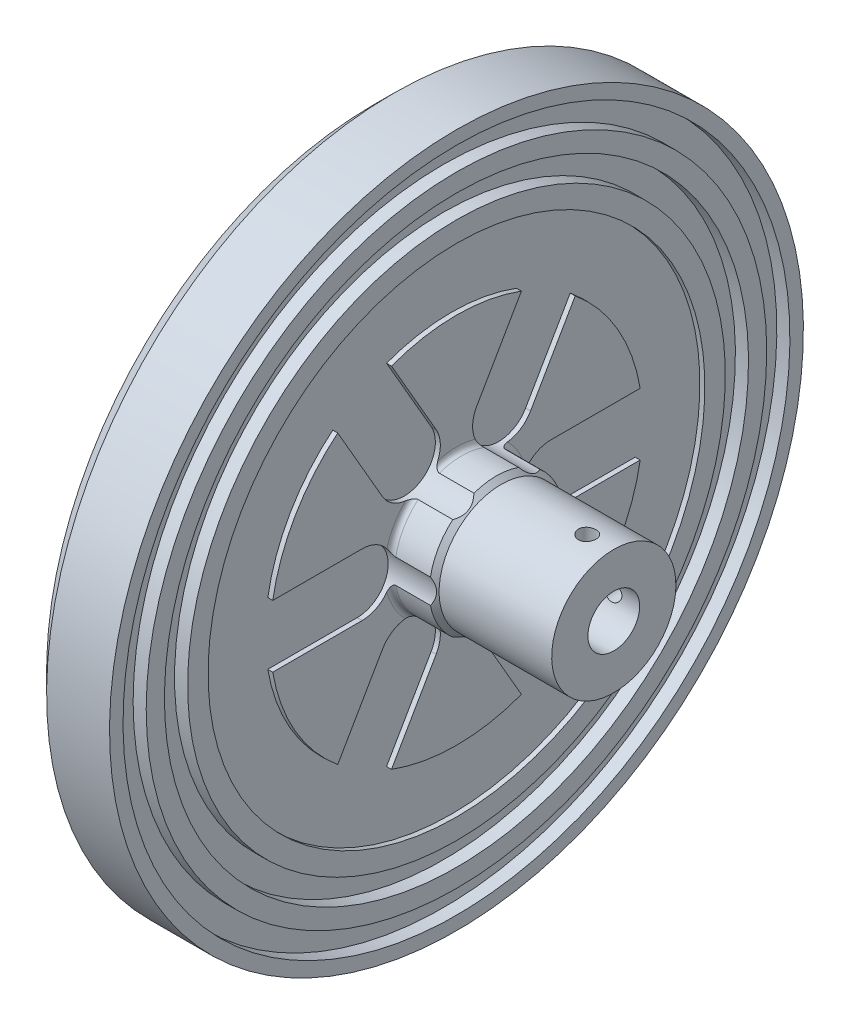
ISO-10303-21;
HEADER;
FILE_DESCRIPTION(('STEP AP214'),'2;1');
FILE_NAME('part.step','',(''),(''),'','','');
FILE_SCHEMA(('AUTOMOTIVE_DESIGN { 1 0 10303 214 1 1 1 1 }'));
ENDSEC;
DATA;
#1=APPLICATION_CONTEXT('core data for automotive mechanical design processes');
#2=APPLICATION_PROTOCOL_DEFINITION('international standard','automotive_design',2000,#1);
#3=PRODUCT_CONTEXT('',#1,'mechanical');
#4=PRODUCT('Part','Part','',(#3));
#5=PRODUCT_RELATED_PRODUCT_CATEGORY('part','',(#4));
#6=PRODUCT_DEFINITION_FORMATION('','',#4);
#7=PRODUCT_DEFINITION_CONTEXT('part definition',#1,'design');
#8=PRODUCT_DEFINITION('design','',#6,#7);
#9=PRODUCT_DEFINITION_SHAPE('','',#8);
#10=(LENGTH_UNIT() NAMED_UNIT(*) SI_UNIT(.MILLI.,.METRE.));
#11=(NAMED_UNIT(*) PLANE_ANGLE_UNIT() SI_UNIT($,.RADIAN.));
#12=(NAMED_UNIT(*) SI_UNIT($,.STERADIAN.) SOLID_ANGLE_UNIT());
#13=UNCERTAINTY_MEASURE_WITH_UNIT(LENGTH_MEASURE(1.E-05),#10,'distance_accuracy_value','');
#14=(GEOMETRIC_REPRESENTATION_CONTEXT(3) GLOBAL_UNCERTAINTY_ASSIGNED_CONTEXT((#13)) GLOBAL_UNIT_ASSIGNED_CONTEXT((#10,
#11,#12)) REPRESENTATION_CONTEXT('',''));
#15=CARTESIAN_POINT('',(0.,0.,0.));
#16=DIRECTION('',(0.,0.,1.));
#17=DIRECTION('',(1.,0.,0.));
#18=AXIS2_PLACEMENT_3D('',#15,#16,#17);
#19=CARTESIAN_POINT('',(36.83,0.,0.));
#20=DIRECTION('',(1.,0.,0.));
#21=DIRECTION('',(0.,1.,0.));
#22=AXIS2_PLACEMENT_3D('',#19,#20,#21);
#23=CYLINDRICAL_SURFACE('',#22,9.525);
#24=CARTESIAN_POINT('',(19.558,0.,0.));
#25=DIRECTION('',(1.,0.,0.));
#26=DIRECTION('',(0.,1.,0.));
#27=AXIS2_PLACEMENT_3D('',#24,#25,#26);
#28=CIRCLE('',#27,9.525);
#29=CARTESIAN_POINT('',(19.558,9.525,0.));
#30=VERTEX_POINT('',#29);
#31=EDGE_CURVE('E984',#30,#30,#28,.T.);
#32=ORIENTED_EDGE('',*,*,#31,.T.);
#33=EDGE_LOOP('',(#32));
#34=FACE_BOUND('',#33,.T.);
#35=CARTESIAN_POINT('',(36.83,0.,0.));
#36=DIRECTION('',(1.,0.,0.));
#37=DIRECTION('',(0.,1.,0.));
#38=AXIS2_PLACEMENT_3D('',#35,#36,#37);
#39=CIRCLE('',#38,9.525);
#40=CARTESIAN_POINT('',(36.83,9.525,0.));
#41=VERTEX_POINT('',#40);
#42=EDGE_CURVE('E1035',#41,#41,#39,.T.);
#43=ORIENTED_EDGE('',*,*,#42,.F.);
#44=EDGE_LOOP('',(#43));
#45=FACE_BOUND('',#44,.T.);
#46=CARTESIAN_POINT('',(34.1122,0.,-9.525));
#47=CARTESIAN_POINT('',(34.1121968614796,0.0752146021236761,-9.52499884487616));
#48=CARTESIAN_POINT('',(34.1058751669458,0.150474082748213,-9.52409973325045));
#49=CARTESIAN_POINT('',(34.0807598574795,0.298892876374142,-9.52059951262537));
#50=CARTESIAN_POINT('',(34.0619537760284,0.372050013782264,-9.51799670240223));
#51=CARTESIAN_POINT('',(34.012439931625,0.514094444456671,-9.51138184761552));
#52=CARTESIAN_POINT('',(33.9817408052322,0.582984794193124,-9.50737082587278));
#53=CARTESIAN_POINT('',(33.9093326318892,0.714624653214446,-9.4983838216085));
#54=CARTESIAN_POINT('',(33.8676252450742,0.777375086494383,-9.49340798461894));
#55=CARTESIAN_POINT('',(33.7740744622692,0.89540257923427,-9.48300672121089));
#56=CARTESIAN_POINT('',(33.7221695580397,0.950630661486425,-9.47757868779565));
#57=CARTESIAN_POINT('',(33.6098294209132,1.05162342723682,-9.46690543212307));
#58=CARTESIAN_POINT('',(33.5493937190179,1.09738759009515,-9.46166021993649));
#59=CARTESIAN_POINT('',(33.4213822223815,1.17834122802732,-9.45192110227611));
#60=CARTESIAN_POINT('',(33.3537765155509,1.21348384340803,-9.44743056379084));
#61=CARTESIAN_POINT('',(33.2135483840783,1.27189743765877,-9.43974444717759));
#62=CARTESIAN_POINT('',(33.140926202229,1.29516899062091,-9.43654880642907));
#63=CARTESIAN_POINT('',(32.993239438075,1.32902889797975,-9.43183971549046));
#64=CARTESIAN_POINT('',(32.9181943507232,1.33970071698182,-9.43031520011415));
#65=CARTESIAN_POINT('',(32.7673642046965,1.34831668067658,-9.42908729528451));
#66=CARTESIAN_POINT('',(32.6915791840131,1.34626147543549,-9.42938381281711));
#67=CARTESIAN_POINT('',(32.5420071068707,1.3295500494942,-9.43175434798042));
#68=CARTESIAN_POINT('',(32.4682094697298,1.31498641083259,-9.43381530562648));
#69=CARTESIAN_POINT('',(32.3241160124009,1.27381627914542,-9.43946211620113));
#70=CARTESIAN_POINT('',(32.2538202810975,1.2472094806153,-9.4430480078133));
#71=CARTESIAN_POINT('',(32.1184422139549,1.18261083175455,-9.45135521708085));
#72=CARTESIAN_POINT('',(32.0533790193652,1.14457939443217,-9.45608047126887));
#73=CARTESIAN_POINT('',(31.9305229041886,1.05823927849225,-9.46613107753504));
#74=CARTESIAN_POINT('',(31.8727304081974,1.00993000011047,-9.47145646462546));
#75=CARTESIAN_POINT('',(31.7655193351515,0.903895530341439,-9.48216514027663));
#76=CARTESIAN_POINT('',(31.7161795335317,0.846090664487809,-9.48754852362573));
#77=CARTESIAN_POINT('',(31.627889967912,0.722978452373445,-9.49772266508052));
#78=CARTESIAN_POINT('',(31.5889402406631,0.657671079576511,-9.50251342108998));
#79=CARTESIAN_POINT('',(31.5225338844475,0.521342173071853,-9.51096673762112));
#80=CARTESIAN_POINT('',(31.4950829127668,0.450317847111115,-9.51462874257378));
#81=CARTESIAN_POINT('',(31.4525195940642,0.304604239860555,-9.52040718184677));
#82=CARTESIAN_POINT('',(31.4374065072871,0.229915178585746,-9.52252370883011));
#83=CARTESIAN_POINT('',(31.4200517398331,0.0796725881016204,-9.52496053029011));
#84=CARTESIAN_POINT('',(31.417701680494,0.00413181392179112,-9.52529594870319));
#85=CARTESIAN_POINT('',(31.4256526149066,-0.146265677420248,-9.52417380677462));
#86=CARTESIAN_POINT('',(31.435953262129,-0.221122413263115,-9.52271629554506));
#87=CARTESIAN_POINT('',(31.4688231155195,-0.367701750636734,-9.51818142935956));
#88=CARTESIAN_POINT('',(31.4913399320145,-0.43943633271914,-9.51511099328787));
#89=CARTESIAN_POINT('',(31.5479479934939,-0.578111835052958,-9.50769362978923));
#90=CARTESIAN_POINT('',(31.5820397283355,-0.645052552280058,-9.50334664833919));
#91=CARTESIAN_POINT('',(31.6610870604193,-0.772719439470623,-9.49382216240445));
#92=CARTESIAN_POINT('',(31.7061119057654,-0.833402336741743,-9.4886394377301));
#93=CARTESIAN_POINT('',(31.8056503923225,-0.946389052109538,-9.4780377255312));
#94=CARTESIAN_POINT('',(31.8601645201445,-0.998692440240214,-9.47261872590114));
#95=CARTESIAN_POINT('',(31.9776147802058,-1.09382620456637,-9.46210772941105));
#96=CARTESIAN_POINT('',(32.040609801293,-1.13658421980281,-9.45701842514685));
#97=CARTESIAN_POINT('',(32.172951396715,-1.21091165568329,-9.44778951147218));
#98=CARTESIAN_POINT('',(32.2422978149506,-1.24248135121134,-9.44364987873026));
#99=CARTESIAN_POINT('',(32.3851514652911,-1.29342200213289,-9.43680811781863));
#100=CARTESIAN_POINT('',(32.4586445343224,-1.31283203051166,-9.43410138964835));
#101=CARTESIAN_POINT('',(32.6078881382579,-1.33902730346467,-9.430419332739));
#102=CARTESIAN_POINT('',(32.6836385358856,-1.34581331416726,-9.42944389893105));
#103=CARTESIAN_POINT('',(32.8345258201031,-1.34655121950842,-9.42933849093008));
#104=CARTESIAN_POINT('',(32.9096621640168,-1.34061684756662,-9.4301921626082));
#105=CARTESIAN_POINT('',(33.0578572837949,-1.31632511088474,-9.43361337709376));
#106=CARTESIAN_POINT('',(33.1309160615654,-1.29796775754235,-9.43618091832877));
#107=CARTESIAN_POINT('',(33.2728566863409,-1.2493897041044,-9.44273509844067));
#108=CARTESIAN_POINT('',(33.3417409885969,-1.21917605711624,-9.44672089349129));
#109=CARTESIAN_POINT('',(33.4734809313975,-1.1477542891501,-9.45566363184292));
#110=CARTESIAN_POINT('',(33.5363364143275,-1.10654588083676,-9.46062060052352));
#111=CARTESIAN_POINT('',(33.6548137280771,-1.01388779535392,-9.47100006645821));
#112=CARTESIAN_POINT('',(33.710369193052,-0.962353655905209,-9.47642617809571));
#113=CARTESIAN_POINT('',(33.8120850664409,-0.85068511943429,-9.48710172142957));
#114=CARTESIAN_POINT('',(33.8582432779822,-0.790548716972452,-9.49235111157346));
#115=CARTESIAN_POINT('',(33.9400520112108,-0.66304117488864,-9.50211062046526));
#116=CARTESIAN_POINT('',(33.9756503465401,-0.595636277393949,-9.50661702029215));
#117=CARTESIAN_POINT('',(34.0349687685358,-0.455774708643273,-9.51434602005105));
#118=CARTESIAN_POINT('',(34.0587013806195,-0.38332345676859,-9.51756997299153));
#119=CARTESIAN_POINT('',(34.0881209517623,-0.258773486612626,-9.52161966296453));
#120=CARTESIAN_POINT('',(34.0971371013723,-0.207450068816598,-9.52288090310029));
#121=CARTESIAN_POINT('',(34.1091776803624,-0.104091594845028,-9.52457146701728));
#122=CARTESIAN_POINT('',(34.1122021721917,-0.052056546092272,-9.52500079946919));
#123=CARTESIAN_POINT('',(34.1122,0.,-9.525));
#124=B_SPLINE_CURVE_WITH_KNOTS('',3,(#46,#47,#48,#49,#50,#51,#52,#53,#54,#55,#56,#57,#58,#59,
#60,#61,#62,#63,#64,#65,#66,#67,#68,#69,#70,#71,#72,#73,#74,#75,#76,#77,#78,#79,#80,#81,#82,#83,
#84,#85,#86,#87,#88,#89,#90,#91,#92,#93,#94,#95,#96,#97,#98,#99,#100,#101,#102,#103,#104,#105,
#106,#107,#108,#109,#110,#111,#112,#113,#114,#115,#116,#117,#118,#119,#120,#121,#122,#123),
.UNSPECIFIED.,.T.,.F.,(4,2,2,2,2,2,2,2,2,2,2,2,2,2,2,2,2,2,2,2,2,2,2,2,2,2,2,2,2,2,2,2,2,2,2,2,
2,2,4),(0.,0.225453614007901,0.451132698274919,0.67664820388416,0.902129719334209,
1.12901550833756,1.35591377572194,1.58379892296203,1.81167304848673,2.03802904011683,
2.26437347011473,2.48905689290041,2.71374601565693,2.93922285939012,3.16471286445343,
3.39220181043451,3.61969156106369,3.84729310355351,4.07488099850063,4.3005332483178,
4.52617931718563,4.75086525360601,4.97556070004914,5.20171824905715,5.42788739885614,
5.65571687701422,5.88354075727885,6.11062875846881,6.33770297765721,6.56275539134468,
6.78780759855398,7.01272612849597,7.23765053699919,7.46449597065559,7.69139437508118,
7.91939610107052,8.14715663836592,8.30319626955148,8.45923427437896),.UNSPECIFIED.);
#125=CARTESIAN_POINT('',(34.1122,0.,-9.525));
#126=VERTEX_POINT('',#125);
#127=EDGE_CURVE('E668',#126,#126,#124,.T.);
#128=ORIENTED_EDGE('',*,*,#127,.T.);
#129=EDGE_LOOP('',(#128));
#130=FACE_BOUND('',#129,.T.);
#131=CARTESIAN_POINT('',(31.4198,9.525,0.));
#132=CARTESIAN_POINT('',(31.4198031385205,9.52499884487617,0.0752146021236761));
#133=CARTESIAN_POINT('',(31.4261248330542,9.52409973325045,0.150474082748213));
#134=CARTESIAN_POINT('',(31.4512401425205,9.52059951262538,0.298892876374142));
#135=CARTESIAN_POINT('',(31.4700462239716,9.51799670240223,0.372050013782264));
#136=CARTESIAN_POINT('',(31.5195600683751,9.51138184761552,0.514094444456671));
#137=CARTESIAN_POINT('',(31.5502591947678,9.50737082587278,0.582984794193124));
#138=CARTESIAN_POINT('',(31.6226673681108,9.4983838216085,0.714624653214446));
#139=CARTESIAN_POINT('',(31.6643747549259,9.49340798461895,0.777375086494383));
#140=CARTESIAN_POINT('',(31.7579255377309,9.48300672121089,0.89540257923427));
#141=CARTESIAN_POINT('',(31.8098304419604,9.47757868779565,0.950630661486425));
#142=CARTESIAN_POINT('',(31.9221705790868,9.46690543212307,1.05162342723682));
#143=CARTESIAN_POINT('',(31.9826062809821,9.46166021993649,1.09738759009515));
#144=CARTESIAN_POINT('',(32.1106177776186,9.45192110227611,1.17834122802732));
#145=CARTESIAN_POINT('',(32.1782234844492,9.44743056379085,1.21348384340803));
#146=CARTESIAN_POINT('',(32.3184516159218,9.4397444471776,1.27189743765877));
#147=CARTESIAN_POINT('',(32.391073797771,9.43654880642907,1.29516899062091));
#148=CARTESIAN_POINT('',(32.538760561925,9.43183971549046,1.32902889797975));
#149=CARTESIAN_POINT('',(32.6138056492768,9.43031520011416,1.33970071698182));
#150=CARTESIAN_POINT('',(32.7646357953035,9.42908729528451,1.34831668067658));
#151=CARTESIAN_POINT('',(32.8404208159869,9.42938381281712,1.34626147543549));
#152=CARTESIAN_POINT('',(32.9899928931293,9.43175434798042,1.3295500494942));
#153=CARTESIAN_POINT('',(33.0637905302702,9.43381530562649,1.31498641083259));
#154=CARTESIAN_POINT('',(33.2078839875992,9.43946211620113,1.27381627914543));
#155=CARTESIAN_POINT('',(33.2781797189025,9.4430480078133,1.24720948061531));
#156=CARTESIAN_POINT('',(33.4135577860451,9.45135521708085,1.18261083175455));
#157=CARTESIAN_POINT('',(33.4786209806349,9.45608047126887,1.14457939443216));
#158=CARTESIAN_POINT('',(33.6014770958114,9.46613107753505,1.05823927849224));
#159=CARTESIAN_POINT('',(33.6592695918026,9.47145646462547,1.00993000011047));
#160=CARTESIAN_POINT('',(33.7664806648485,9.48216514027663,0.90389553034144));
#161=CARTESIAN_POINT('',(33.8158204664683,9.48754852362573,0.846090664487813));
#162=CARTESIAN_POINT('',(33.904110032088,9.49772266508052,0.722978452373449));
#163=CARTESIAN_POINT('',(33.9430597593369,9.50251342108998,0.657671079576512));
#164=CARTESIAN_POINT('',(34.0094661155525,9.51096673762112,0.521342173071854));
#165=CARTESIAN_POINT('',(34.0369170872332,9.51462874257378,0.450317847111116));
#166=CARTESIAN_POINT('',(34.0794804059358,9.52040718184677,0.304604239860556));
#167=CARTESIAN_POINT('',(34.094593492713,9.52252370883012,0.229915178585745));
#168=CARTESIAN_POINT('',(34.111948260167,9.52496053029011,0.0796725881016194));
#169=CARTESIAN_POINT('',(34.1142983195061,9.52529594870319,0.00413181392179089));
#170=CARTESIAN_POINT('',(34.1063473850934,9.52417380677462,-0.146265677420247));
#171=CARTESIAN_POINT('',(34.096046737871,9.52271629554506,-0.221122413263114));
#172=CARTESIAN_POINT('',(34.0631768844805,9.51818142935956,-0.367701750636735));
#173=CARTESIAN_POINT('',(34.0406600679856,9.51511099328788,-0.439436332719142));
#174=CARTESIAN_POINT('',(33.9840520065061,9.50769362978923,-0.578111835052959));
#175=CARTESIAN_POINT('',(33.9499602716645,9.50334664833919,-0.645052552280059));
#176=CARTESIAN_POINT('',(33.8709129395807,9.49382216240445,-0.772719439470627));
#177=CARTESIAN_POINT('',(33.8258880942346,9.4886394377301,-0.833402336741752));
#178=CARTESIAN_POINT('',(33.7263496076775,9.4780377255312,-0.946389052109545));
#179=CARTESIAN_POINT('',(33.6718354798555,9.47261872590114,-0.998692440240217));
#180=CARTESIAN_POINT('',(33.5543852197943,9.46210772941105,-1.09382620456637));
#181=CARTESIAN_POINT('',(33.491390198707,9.45701842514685,-1.13658421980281));
#182=CARTESIAN_POINT('',(33.3590486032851,9.44778951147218,-1.21091165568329));
#183=CARTESIAN_POINT('',(33.2897021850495,9.44364987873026,-1.24248135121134));
#184=CARTESIAN_POINT('',(33.1468485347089,9.43680811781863,-1.29342200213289));
#185=CARTESIAN_POINT('',(33.0733554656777,9.43410138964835,-1.31283203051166));
#186=CARTESIAN_POINT('',(32.9241118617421,9.43041933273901,-1.33902730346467));
#187=CARTESIAN_POINT('',(32.8483614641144,9.42944389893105,-1.34581331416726));
#188=CARTESIAN_POINT('',(32.6974741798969,9.42933849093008,-1.34655121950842));
#189=CARTESIAN_POINT('',(32.6223378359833,9.43019216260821,-1.34061684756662));
#190=CARTESIAN_POINT('',(32.4741427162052,9.43361337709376,-1.31632511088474));
#191=CARTESIAN_POINT('',(32.4010839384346,9.43618091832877,-1.29796775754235));
#192=CARTESIAN_POINT('',(32.2591433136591,9.44273509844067,-1.2493897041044));
#193=CARTESIAN_POINT('',(32.1902590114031,9.4467208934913,-1.21917605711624));
#194=CARTESIAN_POINT('',(32.0585190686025,9.45566363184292,-1.1477542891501));
#195=CARTESIAN_POINT('',(31.9956635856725,9.46062060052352,-1.10654588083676));
#196=CARTESIAN_POINT('',(31.877186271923,9.47100006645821,-1.01388779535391));
#197=CARTESIAN_POINT('',(31.8216308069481,9.47642617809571,-0.962353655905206));
#198=CARTESIAN_POINT('',(31.7199149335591,9.48710172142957,-0.850685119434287));
#199=CARTESIAN_POINT('',(31.6737567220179,9.49235111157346,-0.790548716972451));
#200=CARTESIAN_POINT('',(31.5919479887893,9.50211062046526,-0.663041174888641));
#201=CARTESIAN_POINT('',(31.5563496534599,9.50661702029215,-0.59563627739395));
#202=CARTESIAN_POINT('',(31.4970312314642,9.51434602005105,-0.455774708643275));
#203=CARTESIAN_POINT('',(31.4732986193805,9.51756997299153,-0.383323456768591));
#204=CARTESIAN_POINT('',(31.4438790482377,9.52161966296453,-0.258773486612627));
#205=CARTESIAN_POINT('',(31.4348628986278,9.5228809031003,-0.207450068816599));
#206=CARTESIAN_POINT('',(31.4228223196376,9.52457146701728,-0.104091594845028));
#207=CARTESIAN_POINT('',(31.4197978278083,9.52500079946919,-0.0520565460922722));
#208=CARTESIAN_POINT('',(31.4198,9.525,0.));
#209=B_SPLINE_CURVE_WITH_KNOTS('',3,(#131,#132,#133,#134,#135,#136,#137,#138,#139,#140,#141,
#142,#143,#144,#145,#146,#147,#148,#149,#150,#151,#152,#153,#154,#155,#156,#157,#158,#159,#160,
#161,#162,#163,#164,#165,#166,#167,#168,#169,#170,#171,#172,#173,#174,#175,#176,#177,#178,#179,
#180,#181,#182,#183,#184,#185,#186,#187,#188,#189,#190,#191,#192,#193,#194,#195,#196,#197,#198,
#199,#200,#201,#202,#203,#204,#205,#206,#207,#208),.UNSPECIFIED.,.T.,.F.,(4,2,2,2,2,2,2,2,2,2,2,
2,2,2,2,2,2,2,2,2,2,2,2,2,2,2,2,2,2,2,2,2,2,2,2,2,2,2,4),(0.,0.225453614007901,
0.451132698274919,0.67664820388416,0.902129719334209,1.12901550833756,1.35591377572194,
1.58379892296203,1.81167304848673,2.03802904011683,2.26437347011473,2.4890568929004,
2.71374601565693,2.93922285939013,3.16471286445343,3.39220181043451,3.61969156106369,
3.84729310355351,4.07488099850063,4.3005332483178,4.52617931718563,4.75086525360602,
4.97556070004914,5.20171824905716,5.42788739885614,5.65571687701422,5.88354075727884,
6.11062875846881,6.33770297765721,6.56275539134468,6.78780759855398,7.01272612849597,
7.23765053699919,7.46449597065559,7.69139437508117,7.91939610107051,8.14715663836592,
8.30319626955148,8.45923427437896),.UNSPECIFIED.);
#210=CARTESIAN_POINT('',(31.4198,9.525,0.));
#211=VERTEX_POINT('',#210);
#212=EDGE_CURVE('E1312',#211,#211,#209,.T.);
#213=ORIENTED_EDGE('',*,*,#212,.F.);
#214=EDGE_LOOP('',(#213));
#215=FACE_BOUND('',#214,.T.);
#216=ADVANCED_FACE('F380',(#34,#45,#130,#215),#23,.T.);
#217=CARTESIAN_POINT('',(36.83,0.,0.));
#218=DIRECTION('',(1.,0.,0.));
#219=DIRECTION('',(0.,0.,-1.));
#220=AXIS2_PLACEMENT_3D('',#217,#218,#219);
#221=CYLINDRICAL_SURFACE('',#220,3.96875);
#222=CARTESIAN_POINT('',(36.83,0.,0.));
#223=DIRECTION('',(1.,0.,0.));
#224=DIRECTION('',(0.,0.,-1.));
#225=AXIS2_PLACEMENT_3D('',#222,#223,#224);
#226=CIRCLE('',#225,3.96875);
#227=CARTESIAN_POINT('',(36.83,0.,-3.96875));
#228=VERTEX_POINT('',#227);
#229=EDGE_CURVE('E667',#228,#228,#226,.T.);
#230=ORIENTED_EDGE('',*,*,#229,.T.);
#231=EDGE_LOOP('',(#230));
#232=FACE_BOUND('',#231,.T.);
#233=CARTESIAN_POINT('',(17.78,0.,0.));
#234=DIRECTION('',(1.,0.,0.));
#235=DIRECTION('',(0.,0.,-1.));
#236=AXIS2_PLACEMENT_3D('',#233,#234,#235);
#237=CIRCLE('',#236,3.96874999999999);
#238=CARTESIAN_POINT('',(17.78,0.,-3.96874999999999));
#239=VERTEX_POINT('',#238);
#240=EDGE_CURVE('E665',#239,#239,#237,.T.);
#241=ORIENTED_EDGE('',*,*,#240,.F.);
#242=EDGE_LOOP('',(#241));
#243=FACE_BOUND('',#242,.T.);
#244=CARTESIAN_POINT('',(31.4198,0.,-3.96875));
#245=CARTESIAN_POINT('',(31.4197993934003,0.0733794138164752,-3.96875039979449));
#246=CARTESIAN_POINT('',(31.4258191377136,0.14675467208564,-3.96669627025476));
#247=CARTESIAN_POINT('',(31.4496622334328,0.29133953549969,-3.95870464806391));
#248=CARTESIAN_POINT('',(31.4674863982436,0.362548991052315,-3.95276688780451));
#249=CARTESIAN_POINT('',(31.5142539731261,0.500696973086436,-3.9376521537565));
#250=CARTESIAN_POINT('',(31.5431784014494,0.567642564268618,-3.92848071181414));
#251=CARTESIAN_POINT('',(31.6112381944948,0.695731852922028,-3.90783164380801));
#252=CARTESIAN_POINT('',(31.6503756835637,0.75687433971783,-3.89635353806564));
#253=CARTESIAN_POINT('',(31.7392174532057,0.873805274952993,-3.87183763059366));
#254=CARTESIAN_POINT('',(31.7892213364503,0.929358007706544,-3.85876151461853));
#255=CARTESIAN_POINT('',(31.8977396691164,1.0314706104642,-3.83273101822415));
#256=CARTESIAN_POINT('',(31.9562560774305,1.07802840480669,-3.81977666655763));
#257=CARTESIAN_POINT('',(32.0822845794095,1.16219520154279,-3.79503169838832));
#258=CARTESIAN_POINT('',(32.1500136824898,1.19949425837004,-3.78328758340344));
#259=CARTESIAN_POINT('',(32.2912460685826,1.2620709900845,-3.76287718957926));
#260=CARTESIAN_POINT('',(32.3647475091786,1.28735248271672,-3.75420993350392));
#261=CARTESIAN_POINT('',(32.5127524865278,1.32428585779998,-3.74133885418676));
#262=CARTESIAN_POINT('',(32.5871325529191,1.33638062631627,-3.73699046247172));
#263=CARTESIAN_POINT('',(32.7369836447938,1.34798188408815,-3.73282239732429));
#264=CARTESIAN_POINT('',(32.8124543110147,1.3474924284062,-3.73300126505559));
#265=CARTESIAN_POINT('',(32.9585321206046,1.33428228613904,-3.73774108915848));
#266=CARTESIAN_POINT('',(33.0291999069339,1.32214418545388,-3.7420933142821));
#267=CARTESIAN_POINT('',(33.1674292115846,1.28693340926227,-3.75434719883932));
#268=CARTESIAN_POINT('',(33.2349903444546,1.26385938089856,-3.7622492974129));
#269=CARTESIAN_POINT('',(33.3663935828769,1.20705891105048,-3.78085809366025));
#270=CARTESIAN_POINT('',(33.4301558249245,1.17316281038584,-3.79160896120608));
#271=CARTESIAN_POINT('',(33.5512694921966,1.09579818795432,-3.81468594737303));
#272=CARTESIAN_POINT('',(33.6086190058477,1.05232682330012,-3.82701253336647));
#273=CARTESIAN_POINT('',(33.7185467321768,0.95426547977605,-3.85266845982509));
#274=CARTESIAN_POINT('',(33.7706980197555,0.899200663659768,-3.86601594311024));
#275=CARTESIAN_POINT('',(33.8651395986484,0.780943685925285,-3.89162681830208));
#276=CARTESIAN_POINT('',(33.9074288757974,0.717750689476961,-3.90389009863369));
#277=CARTESIAN_POINT('',(33.9813061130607,0.584101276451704,-3.92612191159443));
#278=CARTESIAN_POINT('',(34.0127759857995,0.513575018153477,-3.93606476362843));
#279=CARTESIAN_POINT('',(34.0632712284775,0.3678111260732,-3.95234855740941));
#280=CARTESIAN_POINT('',(34.0823010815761,0.292575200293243,-3.95869079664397));
#281=CARTESIAN_POINT('',(34.1066111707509,0.143139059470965,-3.96684204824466));
#282=CARTESIAN_POINT('',(34.1124680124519,0.0690428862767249,-3.96884103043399));
#283=CARTESIAN_POINT('',(34.1119132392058,-0.0790905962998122,-3.96865261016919));
#284=CARTESIAN_POINT('',(34.1055037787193,-0.153127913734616,-3.96646594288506));
#285=CARTESIAN_POINT('',(34.081052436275,-0.296709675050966,-3.95827738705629));
#286=CARTESIAN_POINT('',(34.0633676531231,-0.366322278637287,-3.95239269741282));
#287=CARTESIAN_POINT('',(34.0173173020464,-0.501561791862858,-3.93751753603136));
#288=CARTESIAN_POINT('',(33.9889503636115,-0.567188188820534,-3.92852666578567));
#289=CARTESIAN_POINT('',(33.9215001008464,-0.694554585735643,-3.90804876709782));
#290=CARTESIAN_POINT('',(33.8821499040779,-0.756143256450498,-3.89650128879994));
#291=CARTESIAN_POINT('',(33.7941618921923,-0.872028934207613,-3.8722155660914));
#292=CARTESIAN_POINT('',(33.7455211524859,-0.926323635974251,-3.85947694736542));
#293=CARTESIAN_POINT('',(33.6376228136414,-1.0287455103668,-3.83348198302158));
#294=CARTESIAN_POINT('',(33.5779728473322,-1.07646133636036,-3.82022953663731));
#295=CARTESIAN_POINT('',(33.4512302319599,-1.16126087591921,-3.79531414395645));
#296=CARTESIAN_POINT('',(33.3841374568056,-1.19834440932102,-3.78365122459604));
#297=CARTESIAN_POINT('',(33.2443267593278,-1.26067653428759,-3.76334302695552));
#298=CARTESIAN_POINT('',(33.17161667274,-1.28594127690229,-3.75469363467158));
#299=CARTESIAN_POINT('',(33.0226107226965,-1.3237469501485,-3.74153432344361));
#300=CARTESIAN_POINT('',(32.9463165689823,-1.33629388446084,-3.73702245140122));
#301=CARTESIAN_POINT('',(32.7966717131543,-1.34782948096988,-3.73287636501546));
#302=CARTESIAN_POINT('',(32.7233800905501,-1.34750331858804,-3.73299564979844));
#303=CARTESIAN_POINT('',(32.5779547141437,-1.33499762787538,-3.73748592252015));
#304=CARTESIAN_POINT('',(32.5058208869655,-1.32281885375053,-3.74185663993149));
#305=CARTESIAN_POINT('',(32.3662259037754,-1.28744580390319,-3.75417064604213));
#306=CARTESIAN_POINT('',(32.2986994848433,-1.26448104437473,-3.76203932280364));
#307=CARTESIAN_POINT('',(32.1684075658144,-1.20837575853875,-3.78043278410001));
#308=CARTESIAN_POINT('',(32.1056431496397,-1.17523292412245,-3.79095817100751));
#309=CARTESIAN_POINT('',(31.9836010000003,-1.09797700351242,-3.81406816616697));
#310=CARTESIAN_POINT('',(31.9246063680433,-1.05343815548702,-3.82672401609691));
#311=CARTESIAN_POINT('',(31.8147073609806,-0.955365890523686,-3.85237831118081));
#312=CARTESIAN_POINT('',(31.7638053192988,-0.901829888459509,-3.86537685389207));
#313=CARTESIAN_POINT('',(31.6694344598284,-0.7846552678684,-3.89089024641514));
#314=CARTESIAN_POINT('',(31.6263548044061,-0.720693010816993,-3.90336356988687));
#315=CARTESIAN_POINT('',(31.5516018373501,-0.586019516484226,-3.92583872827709));
#316=CARTESIAN_POINT('',(31.5199260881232,-0.515309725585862,-3.93584109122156));
#317=CARTESIAN_POINT('',(31.4699222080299,-0.37153245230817,-3.95196109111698));
#318=CARTESIAN_POINT('',(31.4511884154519,-0.298619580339,-3.95819594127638));
#319=CARTESIAN_POINT('',(31.4261294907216,-0.150469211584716,-3.96658957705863));
#320=CARTESIAN_POINT('',(31.4198006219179,-0.0752324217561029,-3.96874959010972));
#321=CARTESIAN_POINT('',(31.4198,0.,-3.96875));
#322=B_SPLINE_CURVE_WITH_KNOTS('',3,(#244,#245,#246,#247,#248,#249,#250,#251,#252,#253,#254,
#255,#256,#257,#258,#259,#260,#261,#262,#263,#264,#265,#266,#267,#268,#269,#270,#271,#272,#273,
#274,#275,#276,#277,#278,#279,#280,#281,#282,#283,#284,#285,#286,#287,#288,#289,#290,#291,#292,
#293,#294,#295,#296,#297,#298,#299,#300,#301,#302,#303,#304,#305,#306,#307,#308,#309,#310,#311,
#312,#313,#314,#315,#316,#317,#318,#319,#320,#321),.UNSPECIFIED.,.T.,.F.,(4,2,2,2,2,2,2,2,2,2,2,
2,2,2,2,2,2,2,2,2,2,2,2,2,2,2,2,2,2,2,2,2,2,2,2,2,2,2,4),(0.,0.219861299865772,
0.439737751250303,0.659239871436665,0.878787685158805,1.10540306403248,1.33207067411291,
1.5655301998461,1.79891551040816,2.02419488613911,2.24940167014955,2.46390199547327,
2.67842886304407,2.89649924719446,3.11463446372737,3.34458959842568,3.57456837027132,
3.80698296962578,4.03931376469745,4.26125896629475,4.48316518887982,4.69837069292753,
4.91360381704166,5.13460630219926,5.35567847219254,5.58717113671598,5.81866772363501,
6.04984702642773,6.28091714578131,6.49970593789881,6.71848080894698,6.93279777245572,
7.14716337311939,7.37115435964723,7.59520981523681,7.82842902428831,8.06159835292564,
8.28707961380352,8.51249294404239),.UNSPECIFIED.);
#323=CARTESIAN_POINT('',(31.4198,0.,-3.96875));
#324=VERTEX_POINT('',#323);
#325=EDGE_CURVE('E674',#324,#324,#322,.T.);
#326=ORIENTED_EDGE('',*,*,#325,.T.);
#327=EDGE_LOOP('',(#326));
#328=FACE_BOUND('',#327,.T.);
#329=CARTESIAN_POINT('',(32.766,3.73345980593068,-1.3462));
#330=CARTESIAN_POINT('',(32.8392421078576,3.7334593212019,-1.34620062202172));
#331=CARTESIAN_POINT('',(32.9124800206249,3.7356386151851,-1.34020255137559));
#332=CARTESIAN_POINT('',(33.0567808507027,3.74407298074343,-1.31645337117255));
#333=CARTESIAN_POINT('',(33.1278434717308,3.75032860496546,-1.29870066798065));
#334=CARTESIAN_POINT('',(33.265678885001,3.76612729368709,-1.25214174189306));
#335=CARTESIAN_POINT('',(33.3324600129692,3.77566372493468,-1.22335780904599));
#336=CARTESIAN_POINT('',(33.4602677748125,3.79693972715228,-1.15563004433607));
#337=CARTESIAN_POINT('',(33.5212930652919,3.80867981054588,-1.11668384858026));
#338=CARTESIAN_POINT('',(33.6383303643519,3.83357390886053,-1.02804614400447));
#339=CARTESIAN_POINT('',(33.6940751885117,3.84676406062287,-0.978011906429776));
#340=CARTESIAN_POINT('',(33.7965657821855,3.87276720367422,-0.869349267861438));
#341=CARTESIAN_POINT('',(33.8433100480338,3.88558013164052,-0.810719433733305));
#342=CARTESIAN_POINT('',(33.9276948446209,3.90980504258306,-0.684566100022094));
#343=CARTESIAN_POINT('',(33.9650540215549,3.92116959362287,-0.61684448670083));
#344=CARTESIAN_POINT('',(34.027743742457,3.94079034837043,-0.475626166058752));
#345=CARTESIAN_POINT('',(34.0530776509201,3.94904742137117,-0.402131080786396));
#346=CARTESIAN_POINT('',(34.090087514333,3.96126683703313,-0.254254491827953));
#347=CARTESIAN_POINT('',(34.1022214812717,3.9653728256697,-0.179999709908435));
#348=CARTESIAN_POINT('',(34.113944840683,3.96933809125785,-0.0304020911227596));
#349=CARTESIAN_POINT('',(34.1135375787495,3.96919850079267,0.0449404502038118));
#350=CARTESIAN_POINT('',(34.1004773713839,3.96478488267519,0.191327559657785));
#351=CARTESIAN_POINT('',(34.0883222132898,3.96067892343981,0.262422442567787));
#352=CARTESIAN_POINT('',(34.052936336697,3.94900619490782,0.401495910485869));
#353=CARTESIAN_POINT('',(34.0297048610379,3.94143918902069,0.469474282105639));
#354=CARTESIAN_POINT('',(33.9725434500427,3.92348389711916,0.601456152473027));
#355=CARTESIAN_POINT('',(33.9384745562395,3.91305922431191,0.665394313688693));
#356=CARTESIAN_POINT('',(33.8607209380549,3.89046971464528,0.786791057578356));
#357=CARTESIAN_POINT('',(33.8170334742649,3.87830438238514,0.844247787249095));
#358=CARTESIAN_POINT('',(33.7187887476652,3.85281372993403,0.954008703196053));
#359=CARTESIAN_POINT('',(33.6638061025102,3.83946076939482,1.00592628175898));
#360=CARTESIAN_POINT('',(33.5458049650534,3.81359531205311,1.09993194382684));
#361=CARTESIAN_POINT('',(33.4827851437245,3.80108295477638,1.14201839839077));
#362=CARTESIAN_POINT('',(33.349233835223,3.77816088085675,1.21572833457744));
#363=CARTESIAN_POINT('',(33.278602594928,3.76778607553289,1.24718277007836));
#364=CARTESIAN_POINT('',(33.1326048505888,3.75071738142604,1.29761821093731));
#365=CARTESIAN_POINT('',(33.0572404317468,3.74402188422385,1.31660466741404));
#366=CARTESIAN_POINT('',(32.9076716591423,3.73543589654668,1.34076580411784));
#367=CARTESIAN_POINT('',(32.8335764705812,3.73333634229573,1.3465419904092));
#368=CARTESIAN_POINT('',(32.6854614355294,3.73359452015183,1.34582680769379));
#369=CARTESIAN_POINT('',(32.6114415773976,3.73595140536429,1.33933776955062));
#370=CARTESIAN_POINT('',(32.4683593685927,3.74464792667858,1.31481757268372));
#371=CARTESIAN_POINT('',(32.3992144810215,3.75084108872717,1.29721045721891));
#372=CARTESIAN_POINT('',(32.2648765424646,3.76634950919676,1.25146601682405));
#373=CARTESIAN_POINT('',(32.1996842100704,3.7756653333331,1.223326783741));
#374=CARTESIAN_POINT('',(32.0727483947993,3.79674472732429,1.15627677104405));
#375=CARTESIAN_POINT('',(32.0111863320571,3.80857812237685,1.11704508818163));
#376=CARTESIAN_POINT('',(31.8953022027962,3.83322637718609,1.02928439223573));
#377=CARTESIAN_POINT('',(31.8409823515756,3.84604153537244,0.980752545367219));
#378=CARTESIAN_POINT('',(31.7383101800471,3.87198597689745,0.87288289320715));
#379=CARTESIAN_POINT('',(31.6903932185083,3.88509882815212,0.81312550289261));
#380=CARTESIAN_POINT('',(31.6052357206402,3.90953034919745,0.686095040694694));
#381=CARTESIAN_POINT('',(31.5679948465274,3.92084907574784,0.618822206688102));
#382=CARTESIAN_POINT('',(31.5055790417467,3.94036886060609,0.478975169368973));
#383=CARTESIAN_POINT('',(31.4803291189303,3.94858922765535,0.406437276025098));
#384=CARTESIAN_POINT('',(31.4424959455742,3.96106830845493,0.257809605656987));
#385=CARTESIAN_POINT('',(31.4299079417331,3.96532850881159,0.181721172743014));
#386=CARTESIAN_POINT('',(31.4181955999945,3.96929110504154,0.0321275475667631));
#387=CARTESIAN_POINT('',(31.418447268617,3.96920474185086,-0.0413237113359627));
#388=CARTESIAN_POINT('',(31.4308590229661,3.96500813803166,-0.187088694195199));
#389=CARTESIAN_POINT('',(31.4430180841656,3.96089824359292,-0.259402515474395));
#390=CARTESIAN_POINT('',(31.4784814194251,3.94919664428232,-0.399616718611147));
#391=CARTESIAN_POINT('',(31.5015934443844,3.94166508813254,-0.467571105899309));
#392=CARTESIAN_POINT('',(31.5581270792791,3.92389619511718,-0.598661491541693));
#393=CARTESIAN_POINT('',(31.5915505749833,3.9136583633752,-0.661796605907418));
#394=CARTESIAN_POINT('',(31.6692088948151,3.89104664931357,-0.784056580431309));
#395=CARTESIAN_POINT('',(31.713804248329,3.87860671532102,-0.842940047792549));
#396=CARTESIAN_POINT('',(31.8119334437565,3.85314450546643,-0.95259032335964));
#397=CARTESIAN_POINT('',(31.8654701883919,3.84012204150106,-1.0033544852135));
#398=CARTESIAN_POINT('',(31.9825813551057,3.81432543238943,-1.09744162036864));
#399=CARTESIAN_POINT('',(32.04647699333,3.80158328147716,-1.1403748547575));
#400=CARTESIAN_POINT('',(32.180975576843,3.77843865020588,-1.21486903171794));
#401=CARTESIAN_POINT('',(32.2515770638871,3.76803566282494,-1.24643243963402));
#402=CARTESIAN_POINT('',(32.3951124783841,3.75118349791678,-1.29625313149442));
#403=CARTESIAN_POINT('',(32.4678896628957,3.74461383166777,-1.31491975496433));
#404=CARTESIAN_POINT('',(32.6157799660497,3.73575304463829,-1.33989052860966));
#405=CARTESIAN_POINT('',(32.690892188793,3.73346030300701,-1.34619936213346));
#406=CARTESIAN_POINT('',(32.766,3.73345980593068,-1.3462));
#407=B_SPLINE_CURVE_WITH_KNOTS('',3,(#329,#330,#331,#332,#333,#334,#335,#336,#337,#338,#339,
#340,#341,#342,#343,#344,#345,#346,#347,#348,#349,#350,#351,#352,#353,#354,#355,#356,#357,#358,
#359,#360,#361,#362,#363,#364,#365,#366,#367,#368,#369,#370,#371,#372,#373,#374,#375,#376,#377,
#378,#379,#380,#381,#382,#383,#384,#385,#386,#387,#388,#389,#390,#391,#392,#393,#394,#395,#396,
#397,#398,#399,#400,#401,#402,#403,#404,#405,#406),.UNSPECIFIED.,.T.,.F.,(4,2,2,2,2,2,2,2,2,2,2,
2,2,2,2,2,2,2,2,2,2,2,2,2,2,2,2,2,2,2,2,2,2,2,2,2,2,2,4),(0.,0.219447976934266,
0.438925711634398,0.657962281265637,0.877049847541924,1.10420105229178,1.331390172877,
1.56474223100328,1.79802896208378,2.02293395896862,2.2477789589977,2.46349632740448,
2.67922844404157,2.89784645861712,3.11652681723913,3.34584488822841,3.57520092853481,
3.80804875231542,4.04079470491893,4.26271194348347,4.48458701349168,4.6984724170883,
4.91239659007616,5.13328645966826,5.35424374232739,5.58627180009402,5.81829251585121,
6.04884240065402,6.27930570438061,6.49857994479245,6.71783532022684,6.9333772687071,
7.1489586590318,7.37267908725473,7.59647228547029,7.8294278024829,8.06233277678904,
8.28745610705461,8.51249410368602),.UNSPECIFIED.);
#408=CARTESIAN_POINT('',(32.766,3.73345980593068,-1.3462));
#409=VERTEX_POINT('',#408);
#410=EDGE_CURVE('E384',#409,#409,#407,.T.);
#411=ORIENTED_EDGE('',*,*,#410,.F.);
#412=EDGE_LOOP('',(#411));
#413=FACE_BOUND('',#412,.T.);
#414=ADVANCED_FACE('F1296',(#232,#243,#328,#413),#221,.F.);
#415=CARTESIAN_POINT('',(13.4874,0.,0.));
#416=DIRECTION('',(-1.,0.,0.));
#417=DIRECTION('',(0.,-1.,0.));
#418=AXIS2_PLACEMENT_3D('',#415,#416,#417);
#419=TOROIDAL_SURFACE('',#418,11.0617,0.7874);
#420=CARTESIAN_POINT('',(13.4874,0.,0.));
#421=DIRECTION('',(-1.,0.,0.));
#422=DIRECTION('',(0.,-1.,0.));
#423=AXIS2_PLACEMENT_3D('',#420,#421,#422);
#424=CIRCLE('',#423,10.2743);
#425=CARTESIAN_POINT('',(13.4874,9.68678699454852,-3.42452890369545));
#426=VERTEX_POINT('',#425);
#427=CARTESIAN_POINT('',(13.4874,9.68678699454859,3.42452890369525));
#428=VERTEX_POINT('',#427);
#429=EDGE_CURVE('E1043',#426,#428,#424,.F.);
#430=ORIENTED_EDGE('',*,*,#429,.F.);
#431=CARTESIAN_POINT('',(13.4876,9.68678703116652,-3.42452887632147));
#432=CARTESIAN_POINT('',(13.4608463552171,9.68672298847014,-3.42458424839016));
#433=CARTESIAN_POINT('',(13.4341882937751,9.68873057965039,-3.42307560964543));
#434=CARTESIAN_POINT('',(13.3820015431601,9.69637607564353,-3.41737448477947));
#435=CARTESIAN_POINT('',(13.3564632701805,9.70197108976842,-3.41321371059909));
#436=CARTESIAN_POINT('',(13.3001286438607,9.71822299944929,-3.40121388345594));
#437=CARTESIAN_POINT('',(13.2697618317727,9.72983570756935,-3.39268713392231));
#438=CARTESIAN_POINT('',(13.2116177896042,9.75696053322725,-3.37302618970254));
#439=CARTESIAN_POINT('',(13.1838551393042,9.77249299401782,-3.3618784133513));
#440=CARTESIAN_POINT('',(13.1160687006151,9.81609835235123,-3.33106098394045));
#441=CARTESIAN_POINT('',(13.0779949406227,9.84629429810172,-3.3101383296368));
#442=CARTESIAN_POINT('',(13.007757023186,9.91154451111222,-3.26621194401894));
#443=CARTESIAN_POINT('',(12.9756035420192,9.94660735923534,-3.24320456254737));
#444=CARTESIAN_POINT('',(12.9022836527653,10.0383224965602,-3.18491136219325));
#445=CARTESIAN_POINT('',(12.8643133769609,10.0971957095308,-3.14908426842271));
#446=CARTESIAN_POINT('',(12.7994842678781,10.2209645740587,-3.07769910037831));
#447=CARTESIAN_POINT('',(12.7726429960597,10.2858695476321,-3.04214153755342));
#448=CARTESIAN_POINT('',(12.7304849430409,10.421265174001,-2.97222312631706));
#449=CARTESIAN_POINT('',(12.7153399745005,10.4918228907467,-2.93788693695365));
#450=CARTESIAN_POINT('',(12.698926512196,10.6357139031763,-2.87234082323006));
#451=CARTESIAN_POINT('',(12.6975960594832,10.7090333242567,-2.84111756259));
#452=CARTESIAN_POINT('',(12.7084659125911,10.8295412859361,-2.79332094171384));
#453=CARTESIAN_POINT('',(12.7159831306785,10.8766676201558,-2.77551051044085));
#454=CARTESIAN_POINT('',(12.7381528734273,10.9701783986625,-2.741791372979));
#455=CARTESIAN_POINT('',(12.7528417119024,11.0165578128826,-2.72589286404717));
#456=CARTESIAN_POINT('',(12.7713794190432,11.0619,-2.71113045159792));
#457=B_SPLINE_CURVE_WITH_KNOTS('',3,(#431,#432,#433,#434,#435,#436,#437,#438,#439,#440,#441,
#442,#443,#444,#445,#446,#447,#448,#449,#450,#451,#452,#453,#454,#455,#456),.UNSPECIFIED.,.F.,
.F.,(4,2,2,2,2,2,2,2,2,2,2,2,4),(0.,0.0799859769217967,0.159033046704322,0.259306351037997,
0.360111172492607,0.517949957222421,0.676070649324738,0.910909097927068,1.14611672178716,
1.38471696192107,1.62224660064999,1.7745594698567,1.92765170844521),.UNSPECIFIED.);
#458=CARTESIAN_POINT('',(12.6999999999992,10.6880915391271,-2.85059750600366));
#459=VERTEX_POINT('',#458);
#460=EDGE_CURVE('E706',#426,#459,#457,.T.);
#461=ORIENTED_EDGE('',*,*,#460,.T.);
#462=CARTESIAN_POINT('',(12.7,0.,0.));
#463=DIRECTION('',(-1.,0.,0.));
#464=DIRECTION('',(0.,-1.,0.));
#465=AXIS2_PLACEMENT_3D('',#462,#463,#464);
#466=CIRCLE('',#465,11.0617);
#467=CARTESIAN_POINT('',(12.7,10.6880915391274,2.8505975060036));
#468=VERTEX_POINT('',#467);
#469=EDGE_CURVE('E1235',#468,#459,#466,.T.);
#470=ORIENTED_EDGE('',*,*,#469,.F.);
#471=CARTESIAN_POINT('',(12.7713794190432,11.0619,2.7111304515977));
#472=CARTESIAN_POINT('',(12.759111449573,11.0318934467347,2.7209111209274));
#473=CARTESIAN_POINT('',(12.7485203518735,11.0014056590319,2.73118638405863));
#474=CARTESIAN_POINT('',(12.7305648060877,10.9398618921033,2.75264231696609));
#475=CARTESIAN_POINT('',(12.7231950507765,10.9088069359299,2.7638214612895));
#476=CARTESIAN_POINT('',(12.7057885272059,10.8158317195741,2.79841622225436));
#477=CARTESIAN_POINT('',(12.7002239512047,10.753508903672,2.82308059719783));
#478=CARTESIAN_POINT('',(12.6997639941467,10.6230242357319,2.87796337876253));
#479=CARTESIAN_POINT('',(12.7061501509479,10.555001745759,2.90849443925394));
#480=CARTESIAN_POINT('',(12.7305112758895,10.4219335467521,2.97194105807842));
#481=CARTESIAN_POINT('',(12.748534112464,10.3569013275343,3.00486596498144));
#482=CARTESIAN_POINT('',(12.7953635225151,10.2306124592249,3.07233363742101));
#483=CARTESIAN_POINT('',(12.8243034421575,10.169413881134,3.10689158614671));
#484=CARTESIAN_POINT('',(12.8925681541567,10.0530929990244,3.17579887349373));
#485=CARTESIAN_POINT('',(12.9318654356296,9.99795513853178,3.21014852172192));
#486=CARTESIAN_POINT('',(13.0026318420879,9.91755833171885,3.2622829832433));
#487=CARTESIAN_POINT('',(13.0303600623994,9.88954010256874,3.2809183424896));
#488=CARTESIAN_POINT('',(13.0899638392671,9.8370138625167,3.31658076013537));
#489=CARTESIAN_POINT('',(13.1218376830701,9.81250441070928,3.33360847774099));
#490=CARTESIAN_POINT('',(13.1818223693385,9.77371654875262,3.361008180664));
#491=CARTESIAN_POINT('',(13.2089716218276,9.75839838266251,3.37199288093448));
#492=CARTESIAN_POINT('',(13.2657960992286,9.7315058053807,3.39146876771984));
#493=CARTESIAN_POINT('',(13.2954586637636,9.71991389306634,3.3999715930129));
#494=CARTESIAN_POINT('',(13.351858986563,9.70306636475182,3.41240041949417));
#495=CARTESIAN_POINT('',(13.3782528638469,9.69707409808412,3.41685486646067));
#496=CARTESIAN_POINT('',(13.4322538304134,9.688875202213,3.42296736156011));
#497=CARTESIAN_POINT('',(13.4598717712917,9.68671550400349,3.42459073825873));
#498=CARTESIAN_POINT('',(13.4876,9.68678703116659,3.42452887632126));
#499=B_SPLINE_CURVE_WITH_KNOTS('',3,(#471,#472,#473,#474,#475,#476,#477,#478,#479,#480,#481,
#482,#483,#484,#485,#486,#487,#488,#489,#490,#491,#492,#493,#494,#495,#496,#497,#498),
.UNSPECIFIED.,.F.,.F.,(4,2,2,2,2,2,2,2,2,2,2,2,2,4),(0.,0.101471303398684,0.2027747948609,
0.403424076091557,0.626828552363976,0.851157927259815,1.07832107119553,1.30488680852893,
1.43543014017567,1.56591970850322,1.6647684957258,1.76314599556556,1.84502331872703,
1.92789651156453),.UNSPECIFIED.);
#500=EDGE_CURVE('E807',#468,#428,#499,.T.);
#501=ORIENTED_EDGE('',*,*,#500,.T.);
#502=EDGE_LOOP('',(#430,#461,#470,#501));
#503=FACE_BOUND('',#502,.T.);
#504=ADVANCED_FACE('F1234',(#503),#419,.F.);
#505=CARTESIAN_POINT('',(36.83,0.,0.));
#506=DIRECTION('',(1.,0.,0.));
#507=DIRECTION('',(0.,1.,0.));
#508=AXIS2_PLACEMENT_3D('',#505,#506,#507);
#509=CYLINDRICAL_SURFACE('',#508,28.575);
#510=CARTESIAN_POINT('',(12.7,0.,0.));
#511=DIRECTION('',(1.,0.,0.));
#512=DIRECTION('',(0.,1.,0.));
#513=AXIS2_PLACEMENT_3D('',#510,#511,#512);
#514=CIRCLE('',#513,28.575);
#515=CARTESIAN_POINT('',(12.7,26.7818015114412,-9.96321899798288));
#516=VERTEX_POINT('',#515);
#517=CARTESIAN_POINT('',(12.7,26.7818015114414,9.96321899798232));
#518=VERTEX_POINT('',#517);
#519=EDGE_CURVE('E997',#516,#518,#514,.T.);
#520=ORIENTED_EDGE('',*,*,#519,.F.);
#521=DIRECTION('',(1.,0.,0.));
#522=VECTOR('',#521,1.);
#523=CARTESIAN_POINT('',(36.83,26.7818015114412,-9.96321899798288));
#524=LINE('',#523,#522);
#525=CARTESIAN_POINT('',(11.938,26.7818015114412,-9.96321899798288));
#526=VERTEX_POINT('',#525);
#527=EDGE_CURVE('E1157',#516,#526,#524,.F.);
#528=ORIENTED_EDGE('',*,*,#527,.T.);
#529=CARTESIAN_POINT('',(11.938,0.,0.));
#530=DIRECTION('',(1.,0.,0.));
#531=DIRECTION('',(0.,1.,0.));
#532=AXIS2_PLACEMENT_3D('',#529,#530,#531);
#533=CIRCLE('',#532,28.575);
#534=CARTESIAN_POINT('',(11.938,26.7818015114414,9.96321899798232));
#535=VERTEX_POINT('',#534);
#536=EDGE_CURVE('E1002',#526,#535,#533,.T.);
#537=ORIENTED_EDGE('',*,*,#536,.T.);
#538=DIRECTION('',(1.,0.,0.));
#539=VECTOR('',#538,1.);
#540=CARTESIAN_POINT('',(36.83,26.7818015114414,9.96321899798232));
#541=LINE('',#540,#539);
#542=EDGE_CURVE('E818',#535,#518,#541,.T.);
#543=ORIENTED_EDGE('',*,*,#542,.T.);
#544=EDGE_LOOP('',(#520,#528,#537,#543));
#545=FACE_BOUND('',#544,.T.);
#546=ADVANCED_FACE('F1156',(#545),#509,.T.);
#547=CARTESIAN_POINT('',(12.7,-28.575,0.));
#548=DIRECTION('',(-1.,0.,0.));
#549=DIRECTION('',(0.,-1.,0.));
#550=AXIS2_PLACEMENT_3D('',#547,#548,#549);
#551=PLANE('',#550);
#552=ORIENTED_EDGE('',*,*,#469,.T.);
#553=CARTESIAN_POINT('',(12.7,12.538315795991,-7.23900000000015));
#554=DIRECTION('',(-1.,0.,0.));
#555=DIRECTION('',(0.,-1.,0.));
#556=AXIS2_PLACEMENT_3D('',#553,#554,#555);
#557=CIRCLE('',#556,4.7625);
#558=CARTESIAN_POINT('',(12.7,14.9195657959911,-3.11455401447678));
#559=VERTEX_POINT('',#558);
#560=EDGE_CURVE('E1225',#459,#559,#557,.T.);
#561=ORIENTED_EDGE('',*,*,#560,.T.);
#562=DIRECTION('',(0.,0.866025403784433,-0.50000000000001));
#563=VECTOR('',#562,1.);
#564=CARTESIAN_POINT('',(12.7,-19.0499999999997,16.4977839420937));
#565=LINE('',#564,#563);
#566=EDGE_CURVE('E1341',#559,#516,#565,.T.);
#567=ORIENTED_EDGE('',*,*,#566,.T.);
#568=ORIENTED_EDGE('',*,*,#519,.T.);
#569=DIRECTION('',(0.,-0.866025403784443,-0.499999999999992));
#570=VECTOR('',#569,1.);
#571=CARTESIAN_POINT('',(12.7,-19.0500000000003,-16.4977839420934));
#572=LINE('',#571,#570);
#573=CARTESIAN_POINT('',(12.7,14.9195657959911,3.11455401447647));
#574=VERTEX_POINT('',#573);
#575=EDGE_CURVE('E787',#518,#574,#572,.T.);
#576=ORIENTED_EDGE('',*,*,#575,.T.);
#577=CARTESIAN_POINT('',(12.7,12.5383157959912,7.23899999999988));
#578=DIRECTION('',(-1.,0.,0.));
#579=DIRECTION('',(0.,-1.,0.));
#580=AXIS2_PLACEMENT_3D('',#577,#578,#579);
#581=CIRCLE('',#580,4.7625);
#582=EDGE_CURVE('E817',#574,#468,#581,.T.);
#583=ORIENTED_EDGE('',*,*,#582,.T.);
#584=EDGE_LOOP('',(#552,#561,#567,#568,#576,#583));
#585=FACE_BOUND('',#584,.T.);
#586=ADVANCED_FACE('F1237',(#585),#551,.F.);
#587=CARTESIAN_POINT('',(36.83,0.,0.));
#588=DIRECTION('',(1.,0.,0.));
#589=DIRECTION('',(0.,1.,0.));
#590=AXIS2_PLACEMENT_3D('',#587,#588,#589);
#591=CYLINDRICAL_SURFACE('',#590,10.2743);
#592=CARTESIAN_POINT('',(18.8087,0.,0.));
#593=DIRECTION('',(1.,0.,0.));
#594=DIRECTION('',(0.,1.,0.));
#595=AXIS2_PLACEMENT_3D('',#592,#593,#594);
#596=CIRCLE('',#595,10.2743);
#597=CARTESIAN_POINT('',(18.8087,9.68678699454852,-3.42452890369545));
#598=VERTEX_POINT('',#597);
#599=CARTESIAN_POINT('',(18.8087,9.68678699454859,3.42452890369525));
#600=VERTEX_POINT('',#599);
#601=EDGE_CURVE('E992',#598,#600,#596,.T.);
#602=ORIENTED_EDGE('',*,*,#601,.F.);
#603=DIRECTION('',(1.,0.,0.));
#604=VECTOR('',#603,1.);
#605=CARTESIAN_POINT('',(18.669,9.68678699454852,-3.42452890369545));
#606=LINE('',#605,#604);
#607=EDGE_CURVE('E401',#598,#426,#606,.F.);
#608=ORIENTED_EDGE('',*,*,#607,.T.);
#609=ORIENTED_EDGE('',*,*,#429,.T.);
#610=DIRECTION('',(1.,0.,0.));
#611=VECTOR('',#610,1.);
#612=CARTESIAN_POINT('',(18.669,9.68678699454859,3.42452890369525));
#613=LINE('',#612,#611);
#614=EDGE_CURVE('E1180',#428,#600,#613,.T.);
#615=ORIENTED_EDGE('',*,*,#614,.T.);
#616=EDGE_LOOP('',(#602,#608,#609,#615));
#617=FACE_BOUND('',#616,.T.);
#618=ADVANCED_FACE('F1398',(#617),#591,.T.);
#619=CARTESIAN_POINT('',(12.7,7.81273562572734,-7.83086003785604));
#620=VERTEX_POINT('',#619);
#621=CARTESIAN_POINT('',(12.7,2.8753559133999,-10.6814575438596));
#622=VERTEX_POINT('',#621);
#623=EDGE_CURVE('E1042',#620,#622,#466,.T.);
#624=ORIENTED_EDGE('',*,*,#623,.F.);
#625=CARTESIAN_POINT('',(13.4876,8.01442232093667,-8.72755435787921));
#626=CARTESIAN_POINT('',(13.4670783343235,8.01442497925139,-8.72755989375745));
#627=CARTESIAN_POINT('',(13.4465665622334,8.01415038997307,-8.72672819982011));
#628=CARTESIAN_POINT('',(13.4056960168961,8.0130573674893,-8.72340121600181));
#629=CARTESIAN_POINT('',(13.3853372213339,8.012239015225,-8.72090617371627));
#630=CARTESIAN_POINT('',(13.3248099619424,8.00899108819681,-8.71096314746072));
#631=CARTESIAN_POINT('',(13.2850579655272,8.00576851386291,-8.70105712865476));
#632=CARTESIAN_POINT('',(13.2078905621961,7.99744887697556,-8.67500769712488));
#633=CARTESIAN_POINT('',(13.170475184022,7.99235179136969,-8.65886420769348));
#634=CARTESIAN_POINT('',(13.0989262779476,7.98065601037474,-8.62086006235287));
#635=CARTESIAN_POINT('',(13.0647932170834,7.97405710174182,-8.59899859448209));
#636=CARTESIAN_POINT('',(12.9998599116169,7.95965087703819,-8.54968915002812));
#637=CARTESIAN_POINT('',(12.9691535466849,7.95181941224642,-8.52212502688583));
#638=CARTESIAN_POINT('',(12.9125527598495,7.9355788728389,-8.46258920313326));
#639=CARTESIAN_POINT('',(12.8866599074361,7.92716961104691,-8.43061607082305));
#640=CARTESIAN_POINT('',(12.838168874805,7.90960656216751,-8.36054274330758));
#641=CARTESIAN_POINT('',(12.8159837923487,7.9004457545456,-8.32215938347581));
#642=CARTESIAN_POINT('',(12.7776039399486,7.88254489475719,-8.24243186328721));
#643=CARTESIAN_POINT('',(12.7614114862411,7.87380500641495,-8.20108656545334));
#644=CARTESIAN_POINT('',(12.7330546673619,7.85603163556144,-8.11078397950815));
#645=CARTESIAN_POINT('',(12.7217143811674,7.84711417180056,-8.06154643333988));
#646=CARTESIAN_POINT('',(12.7059749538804,7.83070618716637,-7.96176014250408));
#647=CARTESIAN_POINT('',(12.701579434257,7.82321641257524,-7.91121072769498));
#648=CARTESIAN_POINT('',(12.698902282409,7.80860797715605,-7.80021237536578));
#649=CARTESIAN_POINT('',(12.7019254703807,7.80182382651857,-7.7396890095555));
#650=CARTESIAN_POINT('',(12.7159743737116,7.79064165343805,-7.61934344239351));
#651=CARTESIAN_POINT('',(12.7270082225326,7.7862460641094,-7.55952201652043));
#652=CARTESIAN_POINT('',(12.7594065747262,7.77907937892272,-7.42919451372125));
#653=CARTESIAN_POINT('',(12.7824510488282,7.77684152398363,-7.35907552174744));
#654=CARTESIAN_POINT('',(12.8384460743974,7.77535683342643,-7.22283096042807));
#655=CARTESIAN_POINT('',(12.8713984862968,7.77611055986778,-7.15670614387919));
#656=CARTESIAN_POINT('',(12.9369876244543,7.77943156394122,-7.04785236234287));
#657=CARTESIAN_POINT('',(12.9672486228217,7.78144681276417,-7.00366886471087));
#658=CARTESIAN_POINT('',(13.0335602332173,7.78633370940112,-6.91991577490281));
#659=CARTESIAN_POINT('',(13.0695997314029,7.78920372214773,-6.88033757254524));
#660=CARTESIAN_POINT('',(13.1345434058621,7.79415700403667,-6.8207559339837));
#661=CARTESIAN_POINT('',(13.161584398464,7.79616772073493,-6.79872547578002));
#662=CARTESIAN_POINT('',(13.2186211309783,7.80004179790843,-6.75882771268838));
#663=CARTESIAN_POINT('',(13.2486126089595,7.80190536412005,-6.74095452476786));
#664=CARTESIAN_POINT('',(13.3043229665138,7.80479302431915,-6.71430352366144));
#665=CARTESIAN_POINT('',(13.3294848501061,7.80591165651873,-6.70438407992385));
#666=CARTESIAN_POINT('',(13.3810857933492,7.807693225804,-6.68883462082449));
#667=CARTESIAN_POINT('',(13.4075210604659,7.80835743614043,-6.68319261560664));
#668=CARTESIAN_POINT('',(13.4519391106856,7.80899692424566,-6.67779892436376));
#669=CARTESIAN_POINT('',(13.4697652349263,7.80912901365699,-6.67670230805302));
#670=CARTESIAN_POINT('',(13.4876000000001,7.8091225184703,-6.67673921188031));
#671=B_SPLINE_CURVE_WITH_KNOTS('',3,(#625,#626,#627,#628,#629,#630,#631,#632,#633,#634,#635,
#636,#637,#638,#639,#640,#641,#642,#643,#644,#645,#646,#647,#648,#649,#650,#651,#652,#653,#654,
#655,#656,#657,#658,#659,#660,#661,#662,#663,#664,#665,#666,#667,#668,#669,#670),.UNSPECIFIED.,
.F.,.F.,(4,2,2,2,2,2,2,2,2,2,2,2,2,2,2,2,2,2,2,2,2,2,4),(0.,0.0615260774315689,
0.123042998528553,0.245684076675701,0.368326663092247,0.490986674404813,0.616447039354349,
0.741948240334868,0.877214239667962,1.01253246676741,1.16587909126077,1.31930565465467,
1.50157748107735,1.6840346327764,1.90471582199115,2.12543847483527,2.28582897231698,
2.44591461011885,2.55045357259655,2.65484368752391,2.73574589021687,2.81642047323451,
2.86988259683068),.UNSPECIFIED.);
#672=CARTESIAN_POINT('',(13.4874,7.80912252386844,-6.67673916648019));
#673=VERTEX_POINT('',#672);
#674=EDGE_CURVE('E698',#620,#673,#671,.T.);
#675=ORIENTED_EDGE('',*,*,#674,.T.);
#676=CARTESIAN_POINT('',(13.4874,1.87766447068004,-10.1012680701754));
#677=VERTEX_POINT('',#676);
#678=EDGE_CURVE('E1039',#677,#673,#424,.F.);
#679=ORIENTED_EDGE('',*,*,#678,.F.);
#680=CARTESIAN_POINT('',(13.4876,1.87766451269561,-10.1012680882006));
#681=CARTESIAN_POINT('',(13.4608463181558,1.87758453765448,-10.1012403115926));
#682=CARTESIAN_POINT('',(13.4341882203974,1.87989485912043,-10.1022246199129));
#683=CARTESIAN_POINT('',(13.3820014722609,1.88865493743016,-10.1059952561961));
#684=CARTESIAN_POINT('',(13.3564632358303,1.89505577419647,-10.1087602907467));
#685=CARTESIAN_POINT('',(13.3001285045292,1.91357391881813,-10.1168349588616));
#686=CARTESIAN_POINT('',(13.2697615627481,1.92676472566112,-10.1226285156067));
#687=CARTESIAN_POINT('',(13.2116175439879,1.95735405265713,-10.1362888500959));
#688=CARTESIAN_POINT('',(13.1838550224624,1.97477446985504,-10.1441664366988));
#689=CARTESIAN_POINT('',(13.1160702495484,2.02326463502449,-10.1665205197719));
#690=CARTESIAN_POINT('',(13.0779977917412,2.05648078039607,-10.1822089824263));
#691=CARTESIAN_POINT('',(13.0077594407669,2.12714692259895,-10.2167538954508));
#692=CARTESIAN_POINT('',(12.9756046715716,2.16460468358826,-10.2356161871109));
#693=CARTESIAN_POINT('',(12.9022723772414,2.26096187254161,-10.2859056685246));
#694=CARTESIAN_POINT('',(12.8642937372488,2.32144190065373,-10.3189870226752));
#695=CARTESIAN_POINT('',(12.7994705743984,2.44514925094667,-10.39048438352));
#696=CARTESIAN_POINT('',(12.7726378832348,2.50837941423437,-10.428906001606));
#697=CARTESIAN_POINT('',(12.7305119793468,2.63652865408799,-10.5111382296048));
#698=CARTESIAN_POINT('',(12.7153779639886,2.70145900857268,-10.5550140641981));
#699=CARTESIAN_POINT('',(12.6989311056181,2.83017175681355,-10.6468459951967));
#700=CARTESIAN_POINT('',(12.6975917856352,2.89395611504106,-10.6947940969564));
#701=CARTESIAN_POINT('',(12.7089114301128,2.9998786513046,-10.7786360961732));
#702=CARTESIAN_POINT('',(12.7175977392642,3.04289976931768,-10.8139623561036));
#703=CARTESIAN_POINT('',(12.7437061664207,3.12606797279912,-10.8846646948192));
#704=CARTESIAN_POINT('',(12.7611024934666,3.16622314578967,-10.9200403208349));
#705=CARTESIAN_POINT('',(12.7947594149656,3.22460290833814,-10.9731319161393));
#706=CARTESIAN_POINT('',(12.8077374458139,3.24429205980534,-10.991360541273));
#707=CARTESIAN_POINT('',(12.8363151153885,3.28236848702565,-11.0271811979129));
#708=CARTESIAN_POINT('',(12.851918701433,3.30075374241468,-11.0447722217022));
#709=CARTESIAN_POINT('',(12.8688321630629,3.3183831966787,-11.0618999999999));
#710=B_SPLINE_CURVE_WITH_KNOTS('',3,(#680,#681,#682,#683,#684,#685,#686,#687,#688,#689,#690,
#691,#692,#693,#694,#695,#696,#697,#698,#699,#700,#701,#702,#703,#704,#705,#706,#707,#708,#709),
.UNSPECIFIED.,.F.,.F.,(4,2,2,2,2,2,2,2,2,2,2,2,2,2,4),(0.,0.0799860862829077,0.159033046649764,
0.259306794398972,0.36011117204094,0.517944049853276,0.676070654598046,0.910969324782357,
1.14611671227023,1.38441028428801,1.62224640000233,1.79064603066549,1.95854994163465,
2.04783189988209,2.13724930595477),.UNSPECIFIED.);
#711=EDGE_CURVE('E1046',#677,#622,#710,.T.);
#712=ORIENTED_EDGE('',*,*,#711,.T.);
#713=EDGE_LOOP('',(#624,#675,#679,#712));
#714=FACE_BOUND('',#713,.T.);
#715=ADVANCED_FACE('F1244',(#714),#419,.F.);
#716=CARTESIAN_POINT('',(12.7,22.0193015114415,18.2121109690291));
#717=VERTEX_POINT('',#716);
#718=CARTESIAN_POINT('',(12.7,4.76250000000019,28.1753299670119));
#719=VERTEX_POINT('',#718);
#720=EDGE_CURVE('E1128',#717,#719,#514,.T.);
#721=ORIENTED_EDGE('',*,*,#720,.F.);
#722=DIRECTION('',(1.,0.,0.));
#723=VECTOR('',#722,1.);
#724=CARTESIAN_POINT('',(36.83,22.0193015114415,18.2121109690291));
#725=LINE('',#724,#723);
#726=CARTESIAN_POINT('',(11.938,22.0193015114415,18.2121109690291));
#727=VERTEX_POINT('',#726);
#728=EDGE_CURVE('E821',#717,#727,#725,.F.);
#729=ORIENTED_EDGE('',*,*,#728,.T.);
#730=CARTESIAN_POINT('',(11.938,4.7625000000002,28.1753299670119));
#731=VERTEX_POINT('',#730);
#732=EDGE_CURVE('E1146',#727,#731,#533,.T.);
#733=ORIENTED_EDGE('',*,*,#732,.T.);
#734=DIRECTION('',(1.,0.,0.));
#735=VECTOR('',#734,1.);
#736=CARTESIAN_POINT('',(36.83,4.76250000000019,28.1753299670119));
#737=LINE('',#736,#735);
#738=EDGE_CURVE('E1256',#731,#719,#737,.T.);
#739=ORIENTED_EDGE('',*,*,#738,.T.);
#740=EDGE_LOOP('',(#721,#729,#733,#739));
#741=FACE_BOUND('',#740,.T.);
#742=ADVANCED_FACE('F1255',(#741),#509,.T.);
#743=CARTESIAN_POINT('',(12.7,2.87535591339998,10.6814575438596));
#744=VERTEX_POINT('',#743);
#745=CARTESIAN_POINT('',(12.6999999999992,7.81273562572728,7.8308600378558));
#746=VERTEX_POINT('',#745);
#747=EDGE_CURVE('E1238',#744,#746,#466,.T.);
#748=ORIENTED_EDGE('',*,*,#747,.T.);
#749=CARTESIAN_POINT('',(12.7,10.1570657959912,11.3634459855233));
#750=VERTEX_POINT('',#749);
#751=EDGE_CURVE('E814',#746,#750,#581,.T.);
#752=ORIENTED_EDGE('',*,*,#751,.T.);
#753=DIRECTION('',(0.,0.866025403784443,0.499999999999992));
#754=VECTOR('',#753,1.);
#755=CARTESIAN_POINT('',(12.7,-23.8125000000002,-8.24889197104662));
#756=LINE('',#755,#754);
#757=EDGE_CURVE('E734',#750,#717,#756,.T.);
#758=ORIENTED_EDGE('',*,*,#757,.T.);
#759=ORIENTED_EDGE('',*,*,#720,.T.);
#760=DIRECTION('',(0.,0.,-1.));
#761=VECTOR('',#760,1.);
#762=CARTESIAN_POINT('',(12.7,4.7625,-2.32794653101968E-13));
#763=LINE('',#762,#761);
#764=CARTESIAN_POINT('',(12.7,4.7625000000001,14.478));
#765=VERTEX_POINT('',#764);
#766=EDGE_CURVE('E1106',#719,#765,#763,.T.);
#767=ORIENTED_EDGE('',*,*,#766,.T.);
#768=CARTESIAN_POINT('',(12.7,1.0158205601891E-13,14.478));
#769=DIRECTION('',(-1.,0.,0.));
#770=DIRECTION('',(0.,-1.,0.));
#771=AXIS2_PLACEMENT_3D('',#768,#769,#770);
#772=CIRCLE('',#771,4.7625);
#773=EDGE_CURVE('E1259',#765,#744,#772,.T.);
#774=ORIENTED_EDGE('',*,*,#773,.T.);
#775=EDGE_LOOP('',(#748,#752,#758,#759,#767,#774));
#776=FACE_BOUND('',#775,.T.);
#777=ADVANCED_FACE('F1252',(#776),#551,.F.);
#778=CARTESIAN_POINT('',(18.8087,7.80912252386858,6.67673916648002));
#779=VERTEX_POINT('',#778);
#780=CARTESIAN_POINT('',(18.8087,1.87766447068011,10.1012680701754));
#781=VERTEX_POINT('',#780);
#782=EDGE_CURVE('E1191',#779,#781,#596,.T.);
#783=ORIENTED_EDGE('',*,*,#782,.F.);
#784=DIRECTION('',(1.,0.,0.));
#785=VECTOR('',#784,1.);
#786=CARTESIAN_POINT('',(18.669,7.80912252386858,6.67673916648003));
#787=LINE('',#786,#785);
#788=CARTESIAN_POINT('',(13.4874,7.80912252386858,6.67673916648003));
#789=VERTEX_POINT('',#788);
#790=EDGE_CURVE('E409',#779,#789,#787,.F.);
#791=ORIENTED_EDGE('',*,*,#790,.T.);
#792=CARTESIAN_POINT('',(13.4874,1.87766447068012,10.1012680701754));
#793=VERTEX_POINT('',#792);
#794=EDGE_CURVE('E1189',#789,#793,#424,.F.);
#795=ORIENTED_EDGE('',*,*,#794,.T.);
#796=DIRECTION('',(1.,0.,0.));
#797=VECTOR('',#796,1.);
#798=CARTESIAN_POINT('',(18.669,1.87766447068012,10.1012680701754));
#799=LINE('',#798,#797);
#800=EDGE_CURVE('E836',#793,#781,#799,.T.);
#801=ORIENTED_EDGE('',*,*,#800,.T.);
#802=EDGE_LOOP('',(#783,#791,#795,#801));
#803=FACE_BOUND('',#802,.T.);
#804=ADVANCED_FACE('F1188',(#803),#591,.T.);
#805=ORIENTED_EDGE('',*,*,#794,.F.);
#806=CARTESIAN_POINT('',(13.4876,7.80912251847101,6.67673921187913));
#807=CARTESIAN_POINT('',(13.4608464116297,7.80913845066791,6.67665606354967));
#808=CARTESIAN_POINT('',(13.4341884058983,7.80883572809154,6.67914899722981));
#809=CARTESIAN_POINT('',(13.3820016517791,7.80772115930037,6.68862073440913));
#810=CARTESIAN_POINT('',(13.3564633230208,7.80691532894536,6.69554655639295));
#811=CARTESIAN_POINT('',(13.3001284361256,7.8046491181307,6.71562112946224));
#812=CARTESIAN_POINT('',(13.2697614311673,7.80307107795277,6.72994151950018));
#813=CARTESIAN_POINT('',(13.2116174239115,7.79960660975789,6.76326284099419));
#814=CARTESIAN_POINT('',(13.1838549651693,7.79771859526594,6.78228812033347));
#815=CARTESIAN_POINT('',(13.1160702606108,7.79283272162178,6.83545882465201));
#816=CARTESIAN_POINT('',(13.0779978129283,7.78981125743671,6.87206907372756));
#817=CARTESIAN_POINT('',(13.0077594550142,7.78439495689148,6.9505401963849));
#818=CARTESIAN_POINT('',(12.9756046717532,7.78200129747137,6.9924107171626));
#819=CARTESIAN_POINT('',(12.9022739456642,7.77737477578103,7.1010009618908));
#820=CARTESIAN_POINT('',(12.8642964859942,7.77578408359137,7.16991634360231));
#821=CARTESIAN_POINT('',(12.7994724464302,7.77584867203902,7.31279820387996));
#822=CARTESIAN_POINT('',(12.7726384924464,7.77750762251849,7.38677030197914));
#823=CARTESIAN_POINT('',(12.7305060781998,7.78464950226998,7.53889201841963));
#824=CARTESIAN_POINT('',(12.7153698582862,7.79018425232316,7.61708483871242));
#825=CARTESIAN_POINT('',(12.6989297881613,7.80535845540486,7.77446798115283));
#826=CARTESIAN_POINT('',(12.6975916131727,7.81498766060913,7.85365533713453));
#827=CARTESIAN_POINT('',(12.7089065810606,7.83462306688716,7.98721719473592));
#828=CARTESIAN_POINT('',(12.717579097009,7.8436939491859,8.04207015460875));
#829=CARTESIAN_POINT('',(12.7436544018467,7.86333140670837,8.14943618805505));
#830=CARTESIAN_POINT('',(12.7610549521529,7.8738975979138,8.20194985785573));
#831=CARTESIAN_POINT('',(12.8052900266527,7.89596187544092,8.30326941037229));
#832=CARTESIAN_POINT('',(12.8322063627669,7.90746735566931,8.35203852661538));
#833=CARTESIAN_POINT('',(12.8954019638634,7.9303152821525,8.44313540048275));
#834=CARTESIAN_POINT('',(12.9316698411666,7.94165790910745,8.48547089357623));
#835=CARTESIAN_POINT('',(13.0067478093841,7.96138704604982,8.55591817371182));
#836=CARTESIAN_POINT('',(13.0444060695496,7.96996316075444,8.58520525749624));
#837=CARTESIAN_POINT('',(13.1248357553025,7.98531510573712,8.63624849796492));
#838=CARTESIAN_POINT('',(13.1676037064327,7.99209214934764,8.65800973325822));
#839=CARTESIAN_POINT('',(13.2556725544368,8.00303310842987,8.69259668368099));
#840=CARTESIAN_POINT('',(13.3008799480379,8.00725978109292,8.70563793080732));
#841=CARTESIAN_POINT('',(13.3700785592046,8.01153504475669,8.71875712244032));
#842=CARTESIAN_POINT('',(13.3934389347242,8.01261610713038,8.72205652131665));
#843=CARTESIAN_POINT('',(13.4403945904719,8.01406168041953,8.72645877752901));
#844=CARTESIAN_POINT('',(13.4639899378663,8.0144259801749,8.72756098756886));
#845=CARTESIAN_POINT('',(13.4876,8.01442232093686,8.72755435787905));
#846=B_SPLINE_CURVE_WITH_KNOTS('',3,(#806,#807,#808,#809,#810,#811,#812,#813,#814,#815,#816,
#817,#818,#819,#820,#821,#822,#823,#824,#825,#826,#827,#828,#829,#830,#831,#832,#833,#834,#835,
#836,#837,#838,#839,#840,#841,#842,#843,#844,#845),.UNSPECIFIED.,.F.,.F.,(4,2,2,2,2,2,2,2,2,2,2,
2,2,2,2,2,2,2,2,4),(0.,0.0799858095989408,0.159033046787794,0.259307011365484,0.360111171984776,
0.51794401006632,0.676070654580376,0.910960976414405,1.14611671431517,1.38447813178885,
1.62224644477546,1.79041971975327,1.95854988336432,2.12816217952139,2.29756890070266,
2.44214459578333,2.58662253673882,2.72738254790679,2.79813354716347,2.8689053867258),.UNSPECIFIED.);
#847=EDGE_CURVE('E801',#789,#746,#846,.T.);
#848=ORIENTED_EDGE('',*,*,#847,.T.);
#849=ORIENTED_EDGE('',*,*,#747,.F.);
#850=CARTESIAN_POINT('',(12.868832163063,3.3183831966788,11.0618999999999));
#851=CARTESIAN_POINT('',(12.8384673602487,3.286798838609,11.0311730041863));
#852=CARTESIAN_POINT('',(12.8124090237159,3.2527762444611,10.9990185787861));
#853=CARTESIAN_POINT('',(12.7687621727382,3.18120445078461,10.9334838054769));
#854=CARTESIAN_POINT('',(12.7511157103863,3.14368157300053,10.9001136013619));
#855=CARTESIAN_POINT('',(12.7237857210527,3.06613476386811,10.8334348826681));
#856=CARTESIAN_POINT('',(12.714072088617,3.02612091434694,10.8001266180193));
#857=CARTESIAN_POINT('',(12.701848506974,2.94430237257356,10.7343054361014));
#858=CARTESIAN_POINT('',(12.6993513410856,2.90249463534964,10.7017940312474));
#859=CARTESIAN_POINT('',(12.7010763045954,2.81026179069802,10.6325178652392));
#860=CARTESIAN_POINT('',(12.7065930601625,2.75964372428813,10.5960450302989));
#861=CARTESIAN_POINT('',(12.7258082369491,2.65806944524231,10.5257984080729));
#862=CARTESIAN_POINT('',(12.7395149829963,2.60711294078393,10.4920274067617));
#863=CARTESIAN_POINT('',(12.7780148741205,2.49528816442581,10.4208835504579));
#864=CARTESIAN_POINT('',(12.8045182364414,2.43455709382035,10.3842172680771));
#865=CARTESIAN_POINT('',(12.8678639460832,2.31573260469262,10.3158531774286));
#866=CARTESIAN_POINT('',(12.9046985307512,2.25763724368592,10.2841516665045));
#867=CARTESIAN_POINT('',(12.9736053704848,2.1673197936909,10.2370455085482));
#868=CARTESIAN_POINT('',(13.0024054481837,2.13347144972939,10.2199482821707));
#869=CARTESIAN_POINT('',(13.0647886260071,2.06907347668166,10.1882893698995));
#870=CARTESIAN_POINT('',(13.0983683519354,2.03852154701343,10.1737259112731));
#871=CARTESIAN_POINT('',(13.1604638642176,1.99072266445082,10.15146361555));
#872=CARTESIAN_POINT('',(13.1876846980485,1.97216849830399,10.1429923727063));
#873=CARTESIAN_POINT('',(13.2448074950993,1.93900630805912,10.1280587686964));
#874=CARTESIAN_POINT('',(13.2746948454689,1.92437834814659,10.1215862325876));
#875=CARTESIAN_POINT('',(13.3343542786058,1.90146521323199,10.1115388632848));
#876=CARTESIAN_POINT('',(13.3639178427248,1.89274474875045,10.1077636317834));
#877=CARTESIAN_POINT('',(13.4094524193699,1.88380083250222,10.1039045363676));
#878=CARTESIAN_POINT('',(13.4249557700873,1.88150775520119,10.1029183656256));
#879=CARTESIAN_POINT('',(13.4561682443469,1.87843091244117,10.1015968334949));
#880=CARTESIAN_POINT('',(13.4718777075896,1.8776500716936,10.1012627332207));
#881=CARTESIAN_POINT('',(13.4876,1.87766451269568,10.1012680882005));
#882=B_SPLINE_CURVE_WITH_KNOTS('',3,(#850,#851,#852,#853,#854,#855,#856,#857,#858,#859,#860,
#861,#862,#863,#864,#865,#866,#867,#868,#869,#870,#871,#872,#873,#874,#875,#876,#877,#878,#879,
#880,#881),.UNSPECIFIED.,.F.,.F.,(4,2,2,2,2,2,2,2,2,2,2,2,2,2,2,4),(0.,0.160034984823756,
0.318950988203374,0.47726105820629,0.635851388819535,0.8230763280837,1.01049189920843,
1.23679448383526,1.46292748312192,1.60547591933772,1.7479242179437,1.84966705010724,
1.95088305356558,2.04344731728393,2.09047639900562,2.13759634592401),.UNSPECIFIED.);
#883=EDGE_CURVE('E850',#744,#793,#882,.T.);
#884=ORIENTED_EDGE('',*,*,#883,.T.);
#885=EDGE_LOOP('',(#805,#848,#849,#884));
#886=FACE_BOUND('',#885,.T.);
#887=ADVANCED_FACE('F1194',(#886),#419,.F.);
#888=CARTESIAN_POINT('',(12.7,-4.7624999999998,28.175329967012));
#889=VERTEX_POINT('',#888);
#890=CARTESIAN_POINT('',(12.7,-22.0193015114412,18.2121109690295));
#891=VERTEX_POINT('',#890);
#892=EDGE_CURVE('E1118',#889,#891,#514,.T.);
#893=ORIENTED_EDGE('',*,*,#892,.F.);
#894=DIRECTION('',(1.,0.,0.));
#895=VECTOR('',#894,1.);
#896=CARTESIAN_POINT('',(36.83,-4.7624999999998,28.1753299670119));
#897=LINE('',#896,#895);
#898=CARTESIAN_POINT('',(11.938,-4.7624999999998,28.175329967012));
#899=VERTEX_POINT('',#898);
#900=EDGE_CURVE('E1125',#889,#899,#897,.F.);
#901=ORIENTED_EDGE('',*,*,#900,.T.);
#902=CARTESIAN_POINT('',(11.938,-22.0193015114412,18.2121109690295));
#903=VERTEX_POINT('',#902);
#904=EDGE_CURVE('E1142',#899,#903,#533,.T.);
#905=ORIENTED_EDGE('',*,*,#904,.T.);
#906=DIRECTION('',(1.,0.,0.));
#907=VECTOR('',#906,1.);
#908=CARTESIAN_POINT('',(36.83,-22.0193015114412,18.2121109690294));
#909=LINE('',#908,#907);
#910=EDGE_CURVE('E900',#903,#891,#909,.T.);
#911=ORIENTED_EDGE('',*,*,#910,.T.);
#912=EDGE_LOOP('',(#893,#901,#905,#911));
#913=FACE_BOUND('',#912,.T.);
#914=ADVANCED_FACE('F1124',(#913),#509,.T.);
#915=CARTESIAN_POINT('',(12.7,-7.8127356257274,7.83086003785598));
#916=VERTEX_POINT('',#915);
#917=CARTESIAN_POINT('',(12.6999999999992,-2.87535591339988,10.6814575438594));
#918=VERTEX_POINT('',#917);
#919=EDGE_CURVE('E1239',#916,#918,#466,.T.);
#920=ORIENTED_EDGE('',*,*,#919,.T.);
#921=CARTESIAN_POINT('',(12.7,-4.7624999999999,14.478));
#922=VERTEX_POINT('',#921);
#923=EDGE_CURVE('E1119',#918,#922,#772,.T.);
#924=ORIENTED_EDGE('',*,*,#923,.T.);
#925=DIRECTION('',(0.,0.,1.));
#926=VECTOR('',#925,1.);
#927=CARTESIAN_POINT('',(12.7,-4.7625,-1.66281895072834E-13));
#928=LINE('',#927,#926);
#929=EDGE_CURVE('E788',#922,#889,#928,.T.);
#930=ORIENTED_EDGE('',*,*,#929,.T.);
#931=ORIENTED_EDGE('',*,*,#892,.T.);
#932=DIRECTION('',(0.,0.866025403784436,-0.500000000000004));
#933=VECTOR('',#932,1.);
#934=CARTESIAN_POINT('',(12.7,-19.0499999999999,16.4977839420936));
#935=LINE('',#934,#933);
#936=CARTESIAN_POINT('',(12.7,-10.157065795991,11.3634459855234));
#937=VERTEX_POINT('',#936);
#938=EDGE_CURVE('E1095',#891,#937,#935,.T.);
#939=ORIENTED_EDGE('',*,*,#938,.T.);
#940=CARTESIAN_POINT('',(12.7,-12.5383157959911,7.23900000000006));
#941=DIRECTION('',(-1.,0.,0.));
#942=DIRECTION('',(0.,-1.,0.));
#943=AXIS2_PLACEMENT_3D('',#940,#941,#942);
#944=CIRCLE('',#943,4.7625);
#945=EDGE_CURVE('E899',#937,#916,#944,.T.);
#946=ORIENTED_EDGE('',*,*,#945,.T.);
#947=EDGE_LOOP('',(#920,#924,#930,#931,#939,#946));
#948=FACE_BOUND('',#947,.T.);
#949=ADVANCED_FACE('F1117',(#948),#551,.F.);
#950=CARTESIAN_POINT('',(18.8087,-1.87766447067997,10.1012680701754));
#951=VERTEX_POINT('',#950);
#952=CARTESIAN_POINT('',(18.8087,-7.80912252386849,6.67673916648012));
#953=VERTEX_POINT('',#952);
#954=EDGE_CURVE('E1249',#951,#953,#596,.T.);
#955=ORIENTED_EDGE('',*,*,#954,.F.);
#956=DIRECTION('',(1.,0.,0.));
#957=VECTOR('',#956,1.);
#958=CARTESIAN_POINT('',(18.669,-1.87766447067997,10.1012680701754));
#959=LINE('',#958,#957);
#960=CARTESIAN_POINT('',(13.4874,-1.87766447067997,10.1012680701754));
#961=VERTEX_POINT('',#960);
#962=EDGE_CURVE('E841',#951,#961,#959,.F.);
#963=ORIENTED_EDGE('',*,*,#962,.T.);
#964=CARTESIAN_POINT('',(13.4874,-7.80912252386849,6.67673916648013));
#965=VERTEX_POINT('',#964);
#966=EDGE_CURVE('E1197',#961,#965,#424,.F.);
#967=ORIENTED_EDGE('',*,*,#966,.T.);
#968=DIRECTION('',(1.,0.,0.));
#969=VECTOR('',#968,1.);
#970=CARTESIAN_POINT('',(18.669,-7.80912252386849,6.67673916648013));
#971=LINE('',#970,#969);
#972=EDGE_CURVE('E1275',#965,#953,#971,.T.);
#973=ORIENTED_EDGE('',*,*,#972,.T.);
#974=EDGE_LOOP('',(#955,#963,#967,#973));
#975=FACE_BOUND('',#974,.T.);
#976=ADVANCED_FACE('F1290',(#975),#591,.T.);
#977=ORIENTED_EDGE('',*,*,#966,.F.);
#978=CARTESIAN_POINT('',(13.4876,-1.87766451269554,10.1012680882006));
#979=CARTESIAN_POINT('',(13.4608463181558,-1.87758453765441,10.1012403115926));
#980=CARTESIAN_POINT('',(13.4341882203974,-1.87989485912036,10.1022246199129));
#981=CARTESIAN_POINT('',(13.3820014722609,-1.88865493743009,10.1059952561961));
#982=CARTESIAN_POINT('',(13.3564632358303,-1.89505577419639,10.1087602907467));
#983=CARTESIAN_POINT('',(13.3001285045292,-1.91357391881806,10.1168349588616));
#984=CARTESIAN_POINT('',(13.2697615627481,-1.92676472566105,10.1226285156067));
#985=CARTESIAN_POINT('',(13.2116175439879,-1.95735405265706,10.136288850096));
#986=CARTESIAN_POINT('',(13.1838550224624,-1.97477446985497,10.1441664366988));
#987=CARTESIAN_POINT('',(13.1160702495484,-2.02326463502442,10.1665205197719));
#988=CARTESIAN_POINT('',(13.0779977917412,-2.05648078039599,10.1822089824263));
#989=CARTESIAN_POINT('',(13.0077594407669,-2.12714692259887,10.2167538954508));
#990=CARTESIAN_POINT('',(12.9756046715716,-2.16460468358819,10.2356161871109));
#991=CARTESIAN_POINT('',(12.9022723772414,-2.26096187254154,10.2859056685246));
#992=CARTESIAN_POINT('',(12.8642937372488,-2.32144190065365,10.3189870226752));
#993=CARTESIAN_POINT('',(12.7994705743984,-2.44514925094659,10.39048438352));
#994=CARTESIAN_POINT('',(12.7726378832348,-2.5083794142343,10.428906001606));
#995=CARTESIAN_POINT('',(12.7305119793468,-2.63652865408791,10.5111382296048));
#996=CARTESIAN_POINT('',(12.7153779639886,-2.7014590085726,10.5550140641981));
#997=CARTESIAN_POINT('',(12.6989311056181,-2.83017175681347,10.6468459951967));
#998=CARTESIAN_POINT('',(12.6975917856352,-2.89395611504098,10.6947940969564));
#999=CARTESIAN_POINT('',(12.7089114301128,-2.99987865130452,10.7786360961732));
#1000=CARTESIAN_POINT('',(12.7175977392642,-3.0428997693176,10.8139623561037));
#1001=CARTESIAN_POINT('',(12.7437061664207,-3.12606797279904,10.8846646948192));
#1002=CARTESIAN_POINT('',(12.7611024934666,-3.16622314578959,10.9200403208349));
#1003=CARTESIAN_POINT('',(12.7947594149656,-3.22460290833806,10.9731319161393));
#1004=CARTESIAN_POINT('',(12.8077374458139,-3.24429205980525,10.991360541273));
#1005=CARTESIAN_POINT('',(12.8363151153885,-3.28236848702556,11.0271811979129));
#1006=CARTESIAN_POINT('',(12.851918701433,-3.30075374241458,11.0447722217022));
#1007=CARTESIAN_POINT('',(12.8688321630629,-3.3183831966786,11.0618999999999));
#1008=B_SPLINE_CURVE_WITH_KNOTS('',3,(#978,#979,#980,#981,#982,#983,#984,#985,#986,#987,#988,
#989,#990,#991,#992,#993,#994,#995,#996,#997,#998,#999,#1000,#1001,#1002,#1003,#1004,#1005,
#1006,#1007),.UNSPECIFIED.,.F.,.F.,(4,2,2,2,2,2,2,2,2,2,2,2,2,2,4),(0.,0.0799860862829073,
0.159033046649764,0.259306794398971,0.360111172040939,0.517944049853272,0.67607065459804,
0.910969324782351,1.14611671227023,1.384410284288,1.62224640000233,1.79064603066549,
1.95854994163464,2.04783189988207,2.13724930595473),.UNSPECIFIED.);
#1009=EDGE_CURVE('E844',#961,#918,#1008,.T.);
#1010=ORIENTED_EDGE('',*,*,#1009,.T.);
#1011=ORIENTED_EDGE('',*,*,#919,.F.);
#1012=CARTESIAN_POINT('',(13.4876,-8.01442232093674,8.72755435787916));
#1013=CARTESIAN_POINT('',(13.4670783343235,-8.01442497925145,8.72755989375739));
#1014=CARTESIAN_POINT('',(13.4465665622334,-8.01415038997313,8.72672819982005));
#1015=CARTESIAN_POINT('',(13.4056960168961,-8.01305736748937,8.72340121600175));
#1016=CARTESIAN_POINT('',(13.3853372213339,-8.01223901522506,8.72090617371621));
#1017=CARTESIAN_POINT('',(13.3248099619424,-8.00899108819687,8.71096314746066));
#1018=CARTESIAN_POINT('',(13.2850579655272,-8.00576851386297,8.7010571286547));
#1019=CARTESIAN_POINT('',(13.2078905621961,-7.99744887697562,8.67500769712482));
#1020=CARTESIAN_POINT('',(13.170475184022,-7.99235179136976,8.65886420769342));
#1021=CARTESIAN_POINT('',(13.0989262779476,-7.9806560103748,8.62086006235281));
#1022=CARTESIAN_POINT('',(13.0647932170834,-7.97405710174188,8.59899859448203));
#1023=CARTESIAN_POINT('',(12.9998599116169,-7.95965087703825,8.54968915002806));
#1024=CARTESIAN_POINT('',(12.9691535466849,-7.95181941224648,8.52212502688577));
#1025=CARTESIAN_POINT('',(12.9125527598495,-7.93557887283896,8.4625892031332));
#1026=CARTESIAN_POINT('',(12.8866599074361,-7.92716961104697,8.430616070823));
#1027=CARTESIAN_POINT('',(12.838168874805,-7.90960656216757,8.36054274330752));
#1028=CARTESIAN_POINT('',(12.8159837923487,-7.90044575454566,8.32215938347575));
#1029=CARTESIAN_POINT('',(12.7776039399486,-7.88254489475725,8.24243186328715));
#1030=CARTESIAN_POINT('',(12.7614114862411,-7.87380500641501,8.20108656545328));
#1031=CARTESIAN_POINT('',(12.7330546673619,-7.8560316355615,8.11078397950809));
#1032=CARTESIAN_POINT('',(12.7217143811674,-7.84711417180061,8.06154643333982));
#1033=CARTESIAN_POINT('',(12.7059749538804,-7.83070618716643,7.96176014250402));
#1034=CARTESIAN_POINT('',(12.701579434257,-7.82321641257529,7.91121072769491));
#1035=CARTESIAN_POINT('',(12.698902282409,-7.8086079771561,7.80021237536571));
#1036=CARTESIAN_POINT('',(12.7019254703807,-7.80182382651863,7.73968900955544));
#1037=CARTESIAN_POINT('',(12.7159743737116,-7.79064165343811,7.61934344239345));
#1038=CARTESIAN_POINT('',(12.7270082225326,-7.78624606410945,7.55952201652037));
#1039=CARTESIAN_POINT('',(12.7594065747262,-7.77907937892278,7.42919451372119));
#1040=CARTESIAN_POINT('',(12.7824510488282,-7.77684152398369,7.35907552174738));
#1041=CARTESIAN_POINT('',(12.8384460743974,-7.77535683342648,7.22283096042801));
#1042=CARTESIAN_POINT('',(12.8713984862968,-7.77611055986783,7.15670614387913));
#1043=CARTESIAN_POINT('',(12.9369876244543,-7.77943156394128,7.04785236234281));
#1044=CARTESIAN_POINT('',(12.9672486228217,-7.78144681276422,7.00366886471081));
#1045=CARTESIAN_POINT('',(13.0335602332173,-7.78633370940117,6.91991577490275));
#1046=CARTESIAN_POINT('',(13.0695997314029,-7.78920372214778,6.88033757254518));
#1047=CARTESIAN_POINT('',(13.1345434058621,-7.79415700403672,6.82075593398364));
#1048=CARTESIAN_POINT('',(13.161584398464,-7.79616772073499,6.79872547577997));
#1049=CARTESIAN_POINT('',(13.2186211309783,-7.80004179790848,6.75882771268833));
#1050=CARTESIAN_POINT('',(13.2486126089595,-7.8019053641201,6.7409545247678));
#1051=CARTESIAN_POINT('',(13.3043229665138,-7.8047930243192,6.71430352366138));
#1052=CARTESIAN_POINT('',(13.3294848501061,-7.80591165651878,6.70438407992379));
#1053=CARTESIAN_POINT('',(13.3810857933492,-7.80769322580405,6.68883462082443));
#1054=CARTESIAN_POINT('',(13.4075210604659,-7.80835743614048,6.68319261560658));
#1055=CARTESIAN_POINT('',(13.4519391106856,-7.80899692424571,6.67779892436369));
#1056=CARTESIAN_POINT('',(13.4697652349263,-7.80912901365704,6.67670230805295));
#1057=CARTESIAN_POINT('',(13.4876000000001,-7.80912251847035,6.67673921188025));
#1058=B_SPLINE_CURVE_WITH_KNOTS('',3,(#1012,#1013,#1014,#1015,#1016,#1017,#1018,#1019,#1020,
#1021,#1022,#1023,#1024,#1025,#1026,#1027,#1028,#1029,#1030,#1031,#1032,#1033,#1034,#1035,#1036,
#1037,#1038,#1039,#1040,#1041,#1042,#1043,#1044,#1045,#1046,#1047,#1048,#1049,#1050,#1051,#1052,
#1053,#1054,#1055,#1056,#1057),.UNSPECIFIED.,.F.,.F.,(4,2,2,2,2,2,2,2,2,2,2,2,2,2,2,2,2,2,2,2,2,
2,4),(0.,0.0615260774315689,0.123042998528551,0.245684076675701,0.368326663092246,
0.490986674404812,0.616447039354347,0.741948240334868,0.877214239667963,1.01253246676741,
1.16587909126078,1.31930565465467,1.50157748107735,1.6840346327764,1.90471582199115,
2.12543847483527,2.28582897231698,2.44591461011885,2.55045357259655,2.65484368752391,
2.73574589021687,2.81642047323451,2.86988259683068),.UNSPECIFIED.);
#1059=EDGE_CURVE('E888',#916,#965,#1058,.T.);
#1060=ORIENTED_EDGE('',*,*,#1059,.T.);
#1061=EDGE_LOOP('',(#977,#1010,#1011,#1060));
#1062=FACE_BOUND('',#1061,.T.);
#1063=ADVANCED_FACE('F1291',(#1062),#419,.F.);
#1064=CARTESIAN_POINT('',(12.7,-26.7818015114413,9.96321899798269));
#1065=VERTEX_POINT('',#1064);
#1066=CARTESIAN_POINT('',(12.7,-26.7818015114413,-9.96321899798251));
#1067=VERTEX_POINT('',#1066);
#1068=EDGE_CURVE('E1129',#1065,#1067,#514,.T.);
#1069=ORIENTED_EDGE('',*,*,#1068,.F.);
#1070=DIRECTION('',(1.,0.,0.));
#1071=VECTOR('',#1070,1.);
#1072=CARTESIAN_POINT('',(36.83,-26.7818015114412,9.96321899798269));
#1073=LINE('',#1072,#1071);
#1074=CARTESIAN_POINT('',(11.938,-26.7818015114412,9.9632189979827));
#1075=VERTEX_POINT('',#1074);
#1076=EDGE_CURVE('E903',#1065,#1075,#1073,.F.);
#1077=ORIENTED_EDGE('',*,*,#1076,.T.);
#1078=CARTESIAN_POINT('',(11.938,-26.7818015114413,-9.96321899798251));
#1079=VERTEX_POINT('',#1078);
#1080=EDGE_CURVE('E1141',#1075,#1079,#533,.T.);
#1081=ORIENTED_EDGE('',*,*,#1080,.T.);
#1082=DIRECTION('',(1.,0.,0.));
#1083=VECTOR('',#1082,1.);
#1084=CARTESIAN_POINT('',(36.83,-26.7818015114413,-9.96321899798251));
#1085=LINE('',#1084,#1083);
#1086=EDGE_CURVE('E931',#1079,#1067,#1085,.T.);
#1087=ORIENTED_EDGE('',*,*,#1086,.T.);
#1088=EDGE_LOOP('',(#1069,#1077,#1081,#1087));
#1089=FACE_BOUND('',#1088,.T.);
#1090=ADVANCED_FACE('F1285',(#1089),#509,.T.);
#1091=CARTESIAN_POINT('',(12.7,-10.6880915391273,-2.85059750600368));
#1092=VERTEX_POINT('',#1091);
#1093=CARTESIAN_POINT('',(12.6999999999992,-10.6880915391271,2.85059750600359));
#1094=VERTEX_POINT('',#1093);
#1095=EDGE_CURVE('E1047',#1092,#1094,#466,.T.);
#1096=ORIENTED_EDGE('',*,*,#1095,.T.);
#1097=CARTESIAN_POINT('',(12.7,-14.9195657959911,3.11455401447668));
#1098=VERTEX_POINT('',#1097);
#1099=EDGE_CURVE('E896',#1094,#1098,#944,.T.);
#1100=ORIENTED_EDGE('',*,*,#1099,.T.);
#1101=DIRECTION('',(0.,-0.866025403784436,0.500000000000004));
#1102=VECTOR('',#1101,1.);
#1103=CARTESIAN_POINT('',(12.7,-23.8124999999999,8.24889197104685));
#1104=LINE('',#1103,#1102);
#1105=EDGE_CURVE('E1099',#1098,#1065,#1104,.T.);
#1106=ORIENTED_EDGE('',*,*,#1105,.T.);
#1107=ORIENTED_EDGE('',*,*,#1068,.T.);
#1108=DIRECTION('',(0.,0.86602540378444,0.499999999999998));
#1109=VECTOR('',#1108,1.);
#1110=CARTESIAN_POINT('',(12.7,-23.8125,-8.24889197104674));
#1111=LINE('',#1110,#1109);
#1112=CARTESIAN_POINT('',(12.7,-14.9195657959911,-3.11455401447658));
#1113=VERTEX_POINT('',#1112);
#1114=EDGE_CURVE('E1091',#1067,#1113,#1111,.T.);
#1115=ORIENTED_EDGE('',*,*,#1114,.T.);
#1116=CARTESIAN_POINT('',(12.7,-12.5383157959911,-7.23899999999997));
#1117=DIRECTION('',(-1.,0.,0.));
#1118=DIRECTION('',(0.,-1.,0.));
#1119=AXIS2_PLACEMENT_3D('',#1116,#1117,#1118);
#1120=CIRCLE('',#1119,4.7625);
#1121=EDGE_CURVE('E924',#1113,#1092,#1120,.T.);
#1122=ORIENTED_EDGE('',*,*,#1121,.T.);
#1123=EDGE_LOOP('',(#1096,#1100,#1106,#1107,#1115,#1122));
#1124=FACE_BOUND('',#1123,.T.);
#1125=ADVANCED_FACE('F1283',(#1124),#551,.F.);
#1126=CARTESIAN_POINT('',(18.8087,-9.68678699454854,3.42452890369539));
#1127=VERTEX_POINT('',#1126);
#1128=CARTESIAN_POINT('',(18.8087,-9.68678699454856,-3.42452890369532));
#1129=VERTEX_POINT('',#1128);
#1130=EDGE_CURVE('E1248',#1127,#1129,#596,.T.);
#1131=ORIENTED_EDGE('',*,*,#1130,.F.);
#1132=DIRECTION('',(1.,0.,0.));
#1133=VECTOR('',#1132,1.);
#1134=CARTESIAN_POINT('',(18.669,-9.68678699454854,3.42452890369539));
#1135=LINE('',#1134,#1133);
#1136=CARTESIAN_POINT('',(13.4874,-9.68678699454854,3.42452890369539));
#1137=VERTEX_POINT('',#1136);
#1138=EDGE_CURVE('E889',#1127,#1137,#1135,.F.);
#1139=ORIENTED_EDGE('',*,*,#1138,.T.);
#1140=CARTESIAN_POINT('',(13.4874,-9.68678699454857,-3.42452890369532));
#1141=VERTEX_POINT('',#1140);
#1142=EDGE_CURVE('E1198',#1137,#1141,#424,.F.);
#1143=ORIENTED_EDGE('',*,*,#1142,.T.);
#1144=DIRECTION('',(1.,0.,0.));
#1145=VECTOR('',#1144,1.);
#1146=CARTESIAN_POINT('',(16.14805,-9.68678699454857,-3.42452890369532));
#1147=LINE('',#1146,#1145);
#1148=EDGE_CURVE('E929',#1141,#1129,#1147,.T.);
#1149=ORIENTED_EDGE('',*,*,#1148,.T.);
#1150=EDGE_LOOP('',(#1131,#1139,#1143,#1149));
#1151=FACE_BOUND('',#1150,.T.);
#1152=ADVANCED_FACE('F1277',(#1151),#591,.T.);
#1153=CARTESIAN_POINT('',(12.7,-22.0193015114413,-18.2121109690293));
#1154=VERTEX_POINT('',#1153);
#1155=CARTESIAN_POINT('',(12.7,-4.7625,-28.1753299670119));
#1156=VERTEX_POINT('',#1155);
#1157=EDGE_CURVE('E991',#1154,#1156,#514,.T.);
#1158=ORIENTED_EDGE('',*,*,#1157,.F.);
#1159=DIRECTION('',(1.,0.,0.));
#1160=VECTOR('',#1159,1.);
#1161=CARTESIAN_POINT('',(36.83,-22.0193015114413,-18.2121109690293));
#1162=LINE('',#1161,#1160);
#1163=CARTESIAN_POINT('',(11.938,-22.0193015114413,-18.2121109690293));
#1164=VERTEX_POINT('',#1163);
#1165=EDGE_CURVE('E937',#1154,#1164,#1162,.F.);
#1166=ORIENTED_EDGE('',*,*,#1165,.T.);
#1167=CARTESIAN_POINT('',(11.938,-4.7625,-28.1753299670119));
#1168=VERTEX_POINT('',#1167);
#1169=EDGE_CURVE('E996',#1164,#1168,#533,.T.);
#1170=ORIENTED_EDGE('',*,*,#1169,.T.);
#1171=DIRECTION('',(1.,0.,0.));
#1172=VECTOR('',#1171,1.);
#1173=CARTESIAN_POINT('',(36.83,-4.76249999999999,-28.1753299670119));
#1174=LINE('',#1173,#1172);
#1175=EDGE_CURVE('E971',#1168,#1156,#1174,.T.);
#1176=ORIENTED_EDGE('',*,*,#1175,.T.);
#1177=EDGE_LOOP('',(#1158,#1166,#1170,#1176));
#1178=FACE_BOUND('',#1177,.T.);
#1179=ADVANCED_FACE('F1138',(#1178),#509,.T.);
#1180=CARTESIAN_POINT('',(12.7,-2.8753559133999,-10.6814575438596));
#1181=VERTEX_POINT('',#1180);
#1182=CARTESIAN_POINT('',(12.7,-7.81273562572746,-7.83086003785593));
#1183=VERTEX_POINT('',#1182);
#1184=EDGE_CURVE('E1044',#1181,#1183,#466,.T.);
#1185=ORIENTED_EDGE('',*,*,#1184,.T.);
#1186=CARTESIAN_POINT('',(12.7,-10.1570657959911,-11.3634459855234));
#1187=VERTEX_POINT('',#1186);
#1188=EDGE_CURVE('E922',#1183,#1187,#1120,.T.);
#1189=ORIENTED_EDGE('',*,*,#1188,.T.);
#1190=DIRECTION('',(0.,-0.86602540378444,-0.499999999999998));
#1191=VECTOR('',#1190,1.);
#1192=CARTESIAN_POINT('',(12.7,-19.0500000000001,-16.4977839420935));
#1193=LINE('',#1192,#1191);
#1194=EDGE_CURVE('E1092',#1187,#1154,#1193,.T.);
#1195=ORIENTED_EDGE('',*,*,#1194,.T.);
#1196=ORIENTED_EDGE('',*,*,#1157,.T.);
#1197=DIRECTION('',(0.,0.,1.));
#1198=VECTOR('',#1197,1.);
#1199=CARTESIAN_POINT('',(12.7,-4.7625,0.));
#1200=LINE('',#1199,#1198);
#1201=CARTESIAN_POINT('',(12.7,-4.7625,-14.478));
#1202=VERTEX_POINT('',#1201);
#1203=EDGE_CURVE('E1133',#1156,#1202,#1200,.T.);
#1204=ORIENTED_EDGE('',*,*,#1203,.T.);
#1205=CARTESIAN_POINT('',(12.7,0.,-14.478));
#1206=DIRECTION('',(-1.,0.,0.));
#1207=DIRECTION('',(0.,-1.,0.));
#1208=AXIS2_PLACEMENT_3D('',#1205,#1206,#1207);
#1209=CIRCLE('',#1208,4.7625);
#1210=EDGE_CURVE('E964',#1202,#1181,#1209,.T.);
#1211=ORIENTED_EDGE('',*,*,#1210,.T.);
#1212=EDGE_LOOP('',(#1185,#1189,#1195,#1196,#1204,#1211));
#1213=FACE_BOUND('',#1212,.T.);
#1214=ADVANCED_FACE('F1132',(#1213),#551,.F.);
#1215=CARTESIAN_POINT('',(18.8087,-7.80912252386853,-6.67673916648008));
#1216=VERTEX_POINT('',#1215);
#1217=CARTESIAN_POINT('',(18.8087,-1.87766447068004,-10.1012680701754));
#1218=VERTEX_POINT('',#1217);
#1219=EDGE_CURVE('E987',#1216,#1218,#596,.T.);
#1220=ORIENTED_EDGE('',*,*,#1219,.F.);
#1221=DIRECTION('',(1.,0.,0.));
#1222=VECTOR('',#1221,1.);
#1223=CARTESIAN_POINT('',(16.14805,-7.80912252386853,-6.67673916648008));
#1224=LINE('',#1223,#1222);
#1225=CARTESIAN_POINT('',(13.4874,-7.80912252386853,-6.67673916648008));
#1226=VERTEX_POINT('',#1225);
#1227=EDGE_CURVE('E918',#1216,#1226,#1224,.F.);
#1228=ORIENTED_EDGE('',*,*,#1227,.T.);
#1229=CARTESIAN_POINT('',(13.4874,-1.87766447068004,-10.1012680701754));
#1230=VERTEX_POINT('',#1229);
#1231=EDGE_CURVE('E1038',#1226,#1230,#424,.F.);
#1232=ORIENTED_EDGE('',*,*,#1231,.T.);
#1233=DIRECTION('',(1.,0.,0.));
#1234=VECTOR('',#1233,1.);
#1235=CARTESIAN_POINT('',(16.14805,-1.87766447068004,-10.1012680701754));
#1236=LINE('',#1235,#1234);
#1237=EDGE_CURVE('E969',#1230,#1218,#1236,.T.);
#1238=ORIENTED_EDGE('',*,*,#1237,.T.);
#1239=EDGE_LOOP('',(#1220,#1228,#1232,#1238));
#1240=FACE_BOUND('',#1239,.T.);
#1241=ADVANCED_FACE('F1206',(#1240),#591,.T.);
#1242=ORIENTED_EDGE('',*,*,#1142,.F.);
#1243=CARTESIAN_POINT('',(13.4876,-9.68678703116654,3.42452887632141));
#1244=CARTESIAN_POINT('',(13.4608463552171,-9.68672298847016,3.4245842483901));
#1245=CARTESIAN_POINT('',(13.4341882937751,-9.68873057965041,3.42307560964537));
#1246=CARTESIAN_POINT('',(13.3820015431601,-9.69637607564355,3.4173744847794));
#1247=CARTESIAN_POINT('',(13.3564632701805,-9.70197108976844,3.41321371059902));
#1248=CARTESIAN_POINT('',(13.3001286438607,-9.71822299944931,3.40121388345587));
#1249=CARTESIAN_POINT('',(13.2697618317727,-9.72983570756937,3.39268713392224));
#1250=CARTESIAN_POINT('',(13.2116177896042,-9.75696053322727,3.37302618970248));
#1251=CARTESIAN_POINT('',(13.1838551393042,-9.77249299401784,3.36187841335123));
#1252=CARTESIAN_POINT('',(13.1160687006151,-9.81609835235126,3.33106098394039));
#1253=CARTESIAN_POINT('',(13.0779949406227,-9.84629429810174,3.31013832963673));
#1254=CARTESIAN_POINT('',(13.007757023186,-9.91154451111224,3.26621194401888));
#1255=CARTESIAN_POINT('',(12.9756035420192,-9.94660735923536,3.24320456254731));
#1256=CARTESIAN_POINT('',(12.9022836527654,-10.0383224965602,3.18491136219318));
#1257=CARTESIAN_POINT('',(12.864313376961,-10.0971957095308,3.14908426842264));
#1258=CARTESIAN_POINT('',(12.7994842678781,-10.2209645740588,3.07769910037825));
#1259=CARTESIAN_POINT('',(12.7726429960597,-10.2858695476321,3.04214153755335));
#1260=CARTESIAN_POINT('',(12.7304849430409,-10.421265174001,2.97222312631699));
#1261=CARTESIAN_POINT('',(12.7153399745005,-10.4918228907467,2.93788693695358));
#1262=CARTESIAN_POINT('',(12.698926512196,-10.6357139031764,2.87234082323));
#1263=CARTESIAN_POINT('',(12.6975960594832,-10.7090333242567,2.84111756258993));
#1264=CARTESIAN_POINT('',(12.7084659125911,-10.8295412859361,2.79332094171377));
#1265=CARTESIAN_POINT('',(12.7159831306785,-10.8766676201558,2.77551051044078));
#1266=CARTESIAN_POINT('',(12.7381528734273,-10.9701783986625,2.74179137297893));
#1267=CARTESIAN_POINT('',(12.7528417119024,-11.0165578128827,2.7258928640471));
#1268=CARTESIAN_POINT('',(12.7713794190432,-11.0619,2.71113045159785));
#1269=B_SPLINE_CURVE_WITH_KNOTS('',3,(#1243,#1244,#1245,#1246,#1247,#1248,#1249,#1250,#1251,
#1252,#1253,#1254,#1255,#1256,#1257,#1258,#1259,#1260,#1261,#1262,#1263,#1264,#1265,#1266,#1267,
#1268),.UNSPECIFIED.,.F.,.F.,(4,2,2,2,2,2,2,2,2,2,2,2,4),(0.,0.0799859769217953,
0.159033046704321,0.259306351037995,0.360111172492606,0.51794995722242,0.676070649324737,
0.910909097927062,1.14611672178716,1.38471696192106,1.62224660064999,1.77455946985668,
1.92765170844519),.UNSPECIFIED.);
#1270=EDGE_CURVE('E882',#1137,#1094,#1269,.T.);
#1271=ORIENTED_EDGE('',*,*,#1270,.T.);
#1272=ORIENTED_EDGE('',*,*,#1095,.F.);
#1273=CARTESIAN_POINT('',(12.7713794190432,-11.0619,-2.71113045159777));
#1274=CARTESIAN_POINT('',(12.759111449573,-11.0318934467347,-2.72091112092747));
#1275=CARTESIAN_POINT('',(12.7485203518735,-11.0014056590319,-2.7311863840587));
#1276=CARTESIAN_POINT('',(12.7305648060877,-10.9398618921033,-2.75264231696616));
#1277=CARTESIAN_POINT('',(12.7231950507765,-10.9088069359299,-2.76382146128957));
#1278=CARTESIAN_POINT('',(12.7057885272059,-10.8158317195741,-2.79841622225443));
#1279=CARTESIAN_POINT('',(12.7002239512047,-10.753508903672,-2.8230805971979));
#1280=CARTESIAN_POINT('',(12.6997639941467,-10.6230242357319,-2.87796337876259));
#1281=CARTESIAN_POINT('',(12.7061501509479,-10.555001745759,-2.908494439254));
#1282=CARTESIAN_POINT('',(12.7305112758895,-10.4219335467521,-2.97194105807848));
#1283=CARTESIAN_POINT('',(12.748534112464,-10.3569013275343,-3.0048659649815));
#1284=CARTESIAN_POINT('',(12.7953635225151,-10.2306124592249,-3.07233363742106));
#1285=CARTESIAN_POINT('',(12.8243034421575,-10.169413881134,-3.10689158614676));
#1286=CARTESIAN_POINT('',(12.8925681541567,-10.0530929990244,-3.17579887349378));
#1287=CARTESIAN_POINT('',(12.9318654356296,-9.99795513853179,-3.21014852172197));
#1288=CARTESIAN_POINT('',(13.0026318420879,-9.91755833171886,-3.26228298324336));
#1289=CARTESIAN_POINT('',(13.0303600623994,-9.88954010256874,-3.28091834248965));
#1290=CARTESIAN_POINT('',(13.0899638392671,-9.83701386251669,-3.31658076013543));
#1291=CARTESIAN_POINT('',(13.1218376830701,-9.81250441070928,-3.33360847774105));
#1292=CARTESIAN_POINT('',(13.1818223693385,-9.77371654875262,-3.36100818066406));
#1293=CARTESIAN_POINT('',(13.2089716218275,-9.7583983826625,-3.37199288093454));
#1294=CARTESIAN_POINT('',(13.2657960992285,-9.73150580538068,-3.3914687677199));
#1295=CARTESIAN_POINT('',(13.2954586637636,-9.71991389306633,-3.39997159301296));
#1296=CARTESIAN_POINT('',(13.351858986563,-9.7030663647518,-3.41240041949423));
#1297=CARTESIAN_POINT('',(13.3782528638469,-9.6970740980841,-3.41685486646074));
#1298=CARTESIAN_POINT('',(13.4322538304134,-9.68887520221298,-3.42296736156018));
#1299=CARTESIAN_POINT('',(13.4598717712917,-9.68671550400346,-3.4245907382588));
#1300=CARTESIAN_POINT('',(13.4876,-9.68678703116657,-3.42452887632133));
#1301=B_SPLINE_CURVE_WITH_KNOTS('',3,(#1273,#1274,#1275,#1276,#1277,#1278,#1279,#1280,#1281,
#1282,#1283,#1284,#1285,#1286,#1287,#1288,#1289,#1290,#1291,#1292,#1293,#1294,#1295,#1296,#1297,
#1298,#1299,#1300),.UNSPECIFIED.,.F.,.F.,(4,2,2,2,2,2,2,2,2,2,2,2,2,4),(0.,0.101471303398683,
0.2027747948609,0.403424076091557,0.62682855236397,0.851157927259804,1.07832107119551,
1.3048868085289,1.43543014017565,1.56591970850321,1.66476849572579,1.76314599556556,
1.84502331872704,1.92789651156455),.UNSPECIFIED.);
#1302=EDGE_CURVE('E1085',#1092,#1141,#1301,.T.);
#1303=ORIENTED_EDGE('',*,*,#1302,.T.);
#1304=EDGE_LOOP('',(#1242,#1271,#1272,#1303));
#1305=FACE_BOUND('',#1304,.T.);
#1306=ADVANCED_FACE('F1279',(#1305),#419,.F.);
#1307=CARTESIAN_POINT('',(36.83,-9.525,0.));
#1308=DIRECTION('',(-1.,0.,0.));
#1309=DIRECTION('',(0.,-1.,0.));
#1310=AXIS2_PLACEMENT_3D('',#1307,#1308,#1309);
#1311=PLANE('',#1310);
#1312=ORIENTED_EDGE('',*,*,#229,.F.);
#1313=EDGE_LOOP('',(#1312));
#1314=FACE_BOUND('',#1313,.T.);
#1315=ORIENTED_EDGE('',*,*,#42,.T.);
#1316=EDGE_LOOP('',(#1315));
#1317=FACE_BOUND('',#1316,.T.);
#1318=ADVANCED_FACE('F1369',(#1314,#1317),#1311,.F.);
#1319=CARTESIAN_POINT('',(0.,-53.213,0.));
#1320=DIRECTION('',(1.,0.,0.));
#1321=DIRECTION('',(0.,1.,0.));
#1322=AXIS2_PLACEMENT_3D('',#1319,#1320,#1321);
#1323=PLANE('',#1322);
#1324=CARTESIAN_POINT('',(0.,0.,0.));
#1325=DIRECTION('',(1.,0.,0.));
#1326=DIRECTION('',(0.,1.,0.));
#1327=AXIS2_PLACEMENT_3D('',#1324,#1325,#1326);
#1328=CIRCLE('',#1327,50.165);
#1329=CARTESIAN_POINT('',(0.,50.165,0.));
#1330=VERTEX_POINT('',#1329);
#1331=EDGE_CURVE('E11',#1330,#1330,#1328,.F.);
#1332=ORIENTED_EDGE('',*,*,#1331,.T.);
#1333=EDGE_LOOP('',(#1332));
#1334=FACE_BOUND('',#1333,.T.);
#1335=ADVANCED_FACE('F1351',(#1334),#1323,.F.);
#1336=CARTESIAN_POINT('',(36.83,0.,0.));
#1337=DIRECTION('',(1.,0.,0.));
#1338=DIRECTION('',(0.,1.,0.));
#1339=AXIS2_PLACEMENT_3D('',#1336,#1337,#1338);
#1340=CYLINDRICAL_SURFACE('',#1339,53.213);
#1341=CARTESIAN_POINT('',(3.048,0.,0.));
#1342=DIRECTION('',(1.,0.,0.));
#1343=DIRECTION('',(0.,1.,0.));
#1344=AXIS2_PLACEMENT_3D('',#1341,#1342,#1343);
#1345=CIRCLE('',#1344,53.213);
#1346=CARTESIAN_POINT('',(3.048,53.213,0.));
#1347=VERTEX_POINT('',#1346);
#1348=EDGE_CURVE('E393',#1347,#1347,#1345,.T.);
#1349=ORIENTED_EDGE('',*,*,#1348,.T.);
#1350=EDGE_LOOP('',(#1349));
#1351=FACE_BOUND('',#1350,.T.);
#1352=CARTESIAN_POINT('',(12.7,0.,0.));
#1353=DIRECTION('',(1.,0.,0.));
#1354=DIRECTION('',(0.,1.,0.));
#1355=AXIS2_PLACEMENT_3D('',#1352,#1353,#1354);
#1356=CIRCLE('',#1355,53.213);
#1357=CARTESIAN_POINT('',(12.7,53.213,0.));
#1358=VERTEX_POINT('',#1357);
#1359=EDGE_CURVE('E1032',#1358,#1358,#1356,.T.);
#1360=ORIENTED_EDGE('',*,*,#1359,.F.);
#1361=EDGE_LOOP('',(#1360));
#1362=FACE_BOUND('',#1361,.T.);
#1363=ADVANCED_FACE('F1346',(#1351,#1362),#1340,.T.);
#1364=CARTESIAN_POINT('',(12.7,-53.213,0.));
#1365=DIRECTION('',(-1.,0.,0.));
#1366=DIRECTION('',(0.,-1.,0.));
#1367=AXIS2_PLACEMENT_3D('',#1364,#1365,#1366);
#1368=PLANE('',#1367);
#1369=CARTESIAN_POINT('',(12.7,0.,0.));
#1370=DIRECTION('',(1.,0.,0.));
#1371=DIRECTION('',(0.,1.,0.));
#1372=AXIS2_PLACEMENT_3D('',#1369,#1370,#1371);
#1373=CIRCLE('',#1372,51.1429);
#1374=CARTESIAN_POINT('',(12.7,51.1429,0.));
#1375=VERTEX_POINT('',#1374);
#1376=EDGE_CURVE('E1029',#1375,#1375,#1373,.T.);
#1377=ORIENTED_EDGE('',*,*,#1376,.F.);
#1378=EDGE_LOOP('',(#1377));
#1379=FACE_BOUND('',#1378,.T.);
#1380=ORIENTED_EDGE('',*,*,#1359,.T.);
#1381=EDGE_LOOP('',(#1380));
#1382=FACE_BOUND('',#1381,.T.);
#1383=ADVANCED_FACE('F1350',(#1379,#1382),#1368,.F.);
#1384=CARTESIAN_POINT('',(36.83,0.,0.));
#1385=DIRECTION('',(1.,0.,0.));
#1386=DIRECTION('',(0.,1.,0.));
#1387=AXIS2_PLACEMENT_3D('',#1384,#1385,#1386);
#1388=CYLINDRICAL_SURFACE('',#1387,51.1429);
#1389=CARTESIAN_POINT('',(10.6934,0.,0.));
#1390=DIRECTION('',(1.,0.,0.));
#1391=DIRECTION('',(0.,1.,0.));
#1392=AXIS2_PLACEMENT_3D('',#1389,#1390,#1391);
#1393=CIRCLE('',#1392,51.1429);
#1394=CARTESIAN_POINT('',(10.6934,51.1429,0.));
#1395=VERTEX_POINT('',#1394);
#1396=EDGE_CURVE('E1026',#1395,#1395,#1393,.T.);
#1397=ORIENTED_EDGE('',*,*,#1396,.F.);
#1398=EDGE_LOOP('',(#1397));
#1399=FACE_BOUND('',#1398,.T.);
#1400=ORIENTED_EDGE('',*,*,#1376,.T.);
#1401=EDGE_LOOP('',(#1400));
#1402=FACE_BOUND('',#1401,.T.);
#1403=ADVANCED_FACE('F1356',(#1399,#1402),#1388,.F.);
#1404=CARTESIAN_POINT('',(10.6934,-51.1429,0.));
#1405=DIRECTION('',(-1.,0.,0.));
#1406=DIRECTION('',(0.,-1.,0.));
#1407=AXIS2_PLACEMENT_3D('',#1404,#1405,#1406);
#1408=PLANE('',#1407);
#1409=CARTESIAN_POINT('',(10.6934,0.,0.));
#1410=DIRECTION('',(1.,0.,0.));
#1411=DIRECTION('',(0.,1.,0.));
#1412=AXIS2_PLACEMENT_3D('',#1409,#1410,#1411);
#1413=CIRCLE('',#1412,47.5869);
#1414=CARTESIAN_POINT('',(10.6934,47.5869,0.));
#1415=VERTEX_POINT('',#1414);
#1416=EDGE_CURVE('E1023',#1415,#1415,#1413,.T.);
#1417=ORIENTED_EDGE('',*,*,#1416,.F.);
#1418=EDGE_LOOP('',(#1417));
#1419=FACE_BOUND('',#1418,.T.);
#1420=ORIENTED_EDGE('',*,*,#1396,.T.);
#1421=EDGE_LOOP('',(#1420));
#1422=FACE_BOUND('',#1421,.T.);
#1423=ADVANCED_FACE('F1362',(#1419,#1422),#1408,.F.);
#1424=CARTESIAN_POINT('',(36.83,0.,0.));
#1425=DIRECTION('',(1.,0.,0.));
#1426=DIRECTION('',(0.,1.,0.));
#1427=AXIS2_PLACEMENT_3D('',#1424,#1425,#1426);
#1428=CYLINDRICAL_SURFACE('',#1427,47.5869);
#1429=CARTESIAN_POINT('',(12.7,0.,0.));
#1430=DIRECTION('',(1.,0.,0.));
#1431=DIRECTION('',(0.,1.,0.));
#1432=AXIS2_PLACEMENT_3D('',#1429,#1430,#1431);
#1433=CIRCLE('',#1432,47.5869);
#1434=CARTESIAN_POINT('',(12.7,47.5869,0.));
#1435=VERTEX_POINT('',#1434);
#1436=EDGE_CURVE('E1020',#1435,#1435,#1433,.T.);
#1437=ORIENTED_EDGE('',*,*,#1436,.F.);
#1438=EDGE_LOOP('',(#1437));
#1439=FACE_BOUND('',#1438,.T.);
#1440=ORIENTED_EDGE('',*,*,#1416,.T.);
#1441=EDGE_LOOP('',(#1440));
#1442=FACE_BOUND('',#1441,.T.);
#1443=ADVANCED_FACE('F1586',(#1439,#1442),#1428,.T.);
#1444=CARTESIAN_POINT('',(12.7,-47.5869,0.));
#1445=DIRECTION('',(-1.,0.,0.));
#1446=DIRECTION('',(0.,-1.,0.));
#1447=AXIS2_PLACEMENT_3D('',#1444,#1445,#1446);
#1448=PLANE('',#1447);
#1449=CARTESIAN_POINT('',(12.7,0.,0.));
#1450=DIRECTION('',(1.,0.,0.));
#1451=DIRECTION('',(0.,1.,0.));
#1452=AXIS2_PLACEMENT_3D('',#1449,#1450,#1451);
#1453=CIRCLE('',#1452,44.7929);
#1454=CARTESIAN_POINT('',(12.7,44.7929,0.));
#1455=VERTEX_POINT('',#1454);
#1456=EDGE_CURVE('E1017',#1455,#1455,#1453,.T.);
#1457=ORIENTED_EDGE('',*,*,#1456,.F.);
#1458=EDGE_LOOP('',(#1457));
#1459=FACE_BOUND('',#1458,.T.);
#1460=ORIENTED_EDGE('',*,*,#1436,.T.);
#1461=EDGE_LOOP('',(#1460));
#1462=FACE_BOUND('',#1461,.T.);
#1463=ADVANCED_FACE('F1593',(#1459,#1462),#1448,.F.);
#1464=CARTESIAN_POINT('',(36.83,0.,0.));
#1465=DIRECTION('',(1.,0.,0.));
#1466=DIRECTION('',(0.,1.,0.));
#1467=AXIS2_PLACEMENT_3D('',#1464,#1465,#1466);
#1468=CYLINDRICAL_SURFACE('',#1467,44.7929);
#1469=CARTESIAN_POINT('',(10.6934,0.,0.));
#1470=DIRECTION('',(1.,0.,0.));
#1471=DIRECTION('',(0.,1.,0.));
#1472=AXIS2_PLACEMENT_3D('',#1469,#1470,#1471);
#1473=CIRCLE('',#1472,44.7929);
#1474=CARTESIAN_POINT('',(10.6934,44.7929,0.));
#1475=VERTEX_POINT('',#1474);
#1476=EDGE_CURVE('E1014',#1475,#1475,#1473,.T.);
#1477=ORIENTED_EDGE('',*,*,#1476,.F.);
#1478=EDGE_LOOP('',(#1477));
#1479=FACE_BOUND('',#1478,.T.);
#1480=ORIENTED_EDGE('',*,*,#1456,.T.);
#1481=EDGE_LOOP('',(#1480));
#1482=FACE_BOUND('',#1481,.T.);
#1483=ADVANCED_FACE('F1601',(#1479,#1482),#1468,.F.);
#1484=CARTESIAN_POINT('',(10.6934,-44.7929,0.));
#1485=DIRECTION('',(-1.,0.,0.));
#1486=DIRECTION('',(0.,-1.,0.));
#1487=AXIS2_PLACEMENT_3D('',#1484,#1485,#1486);
#1488=PLANE('',#1487);
#1489=CARTESIAN_POINT('',(10.6934,0.,0.));
#1490=DIRECTION('',(1.,0.,0.));
#1491=DIRECTION('',(0.,1.,0.));
#1492=AXIS2_PLACEMENT_3D('',#1489,#1490,#1491);
#1493=CIRCLE('',#1492,41.2369);
#1494=CARTESIAN_POINT('',(10.6934,41.2369,0.));
#1495=VERTEX_POINT('',#1494);
#1496=EDGE_CURVE('E1011',#1495,#1495,#1493,.T.);
#1497=ORIENTED_EDGE('',*,*,#1496,.F.);
#1498=EDGE_LOOP('',(#1497));
#1499=FACE_BOUND('',#1498,.T.);
#1500=ORIENTED_EDGE('',*,*,#1476,.T.);
#1501=EDGE_LOOP('',(#1500));
#1502=FACE_BOUND('',#1501,.T.);
#1503=ADVANCED_FACE('F1609',(#1499,#1502),#1488,.F.);
#1504=CARTESIAN_POINT('',(36.83,0.,0.));
#1505=DIRECTION('',(1.,0.,0.));
#1506=DIRECTION('',(0.,1.,0.));
#1507=AXIS2_PLACEMENT_3D('',#1504,#1505,#1506);
#1508=CYLINDRICAL_SURFACE('',#1507,41.2369);
#1509=CARTESIAN_POINT('',(12.7,0.,0.));
#1510=DIRECTION('',(1.,0.,0.));
#1511=DIRECTION('',(0.,1.,0.));
#1512=AXIS2_PLACEMENT_3D('',#1509,#1510,#1511);
#1513=CIRCLE('',#1512,41.2369);
#1514=CARTESIAN_POINT('',(12.7,41.2369,0.));
#1515=VERTEX_POINT('',#1514);
#1516=EDGE_CURVE('E1008',#1515,#1515,#1513,.T.);
#1517=ORIENTED_EDGE('',*,*,#1516,.F.);
#1518=EDGE_LOOP('',(#1517));
#1519=FACE_BOUND('',#1518,.T.);
#1520=ORIENTED_EDGE('',*,*,#1496,.T.);
#1521=EDGE_LOOP('',(#1520));
#1522=FACE_BOUND('',#1521,.T.);
#1523=ADVANCED_FACE('F1617',(#1519,#1522),#1508,.T.);
#1524=CARTESIAN_POINT('',(12.7,-41.2369,0.));
#1525=DIRECTION('',(-1.,0.,0.));
#1526=DIRECTION('',(0.,-1.,0.));
#1527=AXIS2_PLACEMENT_3D('',#1524,#1525,#1526);
#1528=PLANE('',#1527);
#1529=CARTESIAN_POINT('',(12.7,0.,0.));
#1530=DIRECTION('',(1.,0.,0.));
#1531=DIRECTION('',(0.,1.,0.));
#1532=AXIS2_PLACEMENT_3D('',#1529,#1530,#1531);
#1533=CIRCLE('',#1532,38.1);
#1534=CARTESIAN_POINT('',(12.7,38.1,0.));
#1535=VERTEX_POINT('',#1534);
#1536=EDGE_CURVE('E1005',#1535,#1535,#1533,.T.);
#1537=ORIENTED_EDGE('',*,*,#1536,.F.);
#1538=EDGE_LOOP('',(#1537));
#1539=FACE_BOUND('',#1538,.T.);
#1540=ORIENTED_EDGE('',*,*,#1516,.T.);
#1541=EDGE_LOOP('',(#1540));
#1542=FACE_BOUND('',#1541,.T.);
#1543=ADVANCED_FACE('F1625',(#1539,#1542),#1528,.F.);
#1544=CARTESIAN_POINT('',(36.83,0.,0.));
#1545=DIRECTION('',(1.,0.,0.));
#1546=DIRECTION('',(0.,1.,0.));
#1547=AXIS2_PLACEMENT_3D('',#1544,#1545,#1546);
#1548=CYLINDRICAL_SURFACE('',#1547,38.1);
#1549=CARTESIAN_POINT('',(11.938,0.,0.));
#1550=DIRECTION('',(1.,0.,0.));
#1551=DIRECTION('',(0.,1.,0.));
#1552=AXIS2_PLACEMENT_3D('',#1549,#1550,#1551);
#1553=CIRCLE('',#1552,38.1);
#1554=CARTESIAN_POINT('',(11.938,38.1,0.));
#1555=VERTEX_POINT('',#1554);
#1556=EDGE_CURVE('E1001',#1555,#1555,#1553,.T.);
#1557=ORIENTED_EDGE('',*,*,#1556,.F.);
#1558=EDGE_LOOP('',(#1557));
#1559=FACE_BOUND('',#1558,.T.);
#1560=ORIENTED_EDGE('',*,*,#1536,.T.);
#1561=EDGE_LOOP('',(#1560));
#1562=FACE_BOUND('',#1561,.T.);
#1563=ADVANCED_FACE('F1416',(#1559,#1562),#1548,.F.);
#1564=CARTESIAN_POINT('',(11.938,-28.575,0.));
#1565=DIRECTION('',(-1.,0.,0.));
#1566=DIRECTION('',(0.,-1.,0.));
#1567=AXIS2_PLACEMENT_3D('',#1564,#1565,#1566);
#1568=PLANE('',#1567);
#1569=ORIENTED_EDGE('',*,*,#536,.F.);
#1570=DIRECTION('',(0.,-0.866025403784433,0.50000000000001));
#1571=VECTOR('',#1570,1.);
#1572=CARTESIAN_POINT('',(11.938,14.9195657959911,-3.11455401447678));
#1573=LINE('',#1572,#1571);
#1574=CARTESIAN_POINT('',(11.938,14.9195657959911,-3.11455401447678));
#1575=VERTEX_POINT('',#1574);
#1576=EDGE_CURVE('E686',#526,#1575,#1573,.T.);
#1577=ORIENTED_EDGE('',*,*,#1576,.T.);
#1578=CARTESIAN_POINT('',(11.938,12.538315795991,-7.23900000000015));
#1579=DIRECTION('',(1.,0.,0.));
#1580=DIRECTION('',(0.,-0.50000000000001,-0.866025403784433));
#1581=AXIS2_PLACEMENT_3D('',#1578,#1579,#1580);
#1582=CIRCLE('',#1581,4.7625);
#1583=CARTESIAN_POINT('',(11.938,10.157065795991,-11.3634459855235));
#1584=VERTEX_POINT('',#1583);
#1585=EDGE_CURVE('E671',#1575,#1584,#1582,.T.);
#1586=ORIENTED_EDGE('',*,*,#1585,.T.);
#1587=DIRECTION('',(0.,0.866025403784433,-0.50000000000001));
#1588=VECTOR('',#1587,1.);
#1589=CARTESIAN_POINT('',(11.938,10.157065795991,-11.3634459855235));
#1590=LINE('',#1589,#1588);
#1591=CARTESIAN_POINT('',(11.938,22.0193015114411,-18.2121109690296));
#1592=VERTEX_POINT('',#1591);
#1593=EDGE_CURVE('E683',#1584,#1592,#1590,.T.);
#1594=ORIENTED_EDGE('',*,*,#1593,.T.);
#1595=CARTESIAN_POINT('',(11.938,4.7625,-28.1753299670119));
#1596=VERTEX_POINT('',#1595);
#1597=EDGE_CURVE('E998',#1596,#1592,#533,.T.);
#1598=ORIENTED_EDGE('',*,*,#1597,.F.);
#1599=DIRECTION('',(0.,0.,1.));
#1600=VECTOR('',#1599,1.);
#1601=CARTESIAN_POINT('',(11.938,4.7625,-14.478));
#1602=LINE('',#1601,#1600);
#1603=CARTESIAN_POINT('',(11.938,4.7625,-14.478));
#1604=VERTEX_POINT('',#1603);
#1605=EDGE_CURVE('E952',#1596,#1604,#1602,.T.);
#1606=ORIENTED_EDGE('',*,*,#1605,.T.);
#1607=CARTESIAN_POINT('',(11.938,0.,-14.478));
#1608=DIRECTION('',(1.,0.,0.));
#1609=DIRECTION('',(0.,-1.,0.));
#1610=AXIS2_PLACEMENT_3D('',#1607,#1608,#1609);
#1611=CIRCLE('',#1610,4.7625);
#1612=CARTESIAN_POINT('',(11.938,-4.7625,-14.478));
#1613=VERTEX_POINT('',#1612);
#1614=EDGE_CURVE('E946',#1604,#1613,#1611,.T.);
#1615=ORIENTED_EDGE('',*,*,#1614,.T.);
#1616=DIRECTION('',(0.,0.,-1.));
#1617=VECTOR('',#1616,1.);
#1618=CARTESIAN_POINT('',(11.938,-4.7625,-14.478));
#1619=LINE('',#1618,#1617);
#1620=EDGE_CURVE('E949',#1613,#1168,#1619,.T.);
#1621=ORIENTED_EDGE('',*,*,#1620,.T.);
#1622=ORIENTED_EDGE('',*,*,#1169,.F.);
#1623=DIRECTION('',(0.,0.86602540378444,0.499999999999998));
#1624=VECTOR('',#1623,1.);
#1625=CARTESIAN_POINT('',(11.938,-10.1570657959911,-11.3634459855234));
#1626=LINE('',#1625,#1624);
#1627=CARTESIAN_POINT('',(11.938,-10.1570657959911,-11.3634459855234));
#1628=VERTEX_POINT('',#1627);
#1629=EDGE_CURVE('E912',#1164,#1628,#1626,.T.);
#1630=ORIENTED_EDGE('',*,*,#1629,.T.);
#1631=CARTESIAN_POINT('',(11.938,-12.5383157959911,-7.23899999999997));
#1632=DIRECTION('',(1.,0.,0.));
#1633=DIRECTION('',(0.,-0.499999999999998,0.86602540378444));
#1634=AXIS2_PLACEMENT_3D('',#1631,#1632,#1633);
#1635=CIRCLE('',#1634,4.7625);
#1636=CARTESIAN_POINT('',(11.938,-14.9195657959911,-3.11455401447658));
#1637=VERTEX_POINT('',#1636);
#1638=EDGE_CURVE('E906',#1628,#1637,#1635,.T.);
#1639=ORIENTED_EDGE('',*,*,#1638,.T.);
#1640=DIRECTION('',(0.,-0.86602540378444,-0.499999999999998));
#1641=VECTOR('',#1640,1.);
#1642=CARTESIAN_POINT('',(11.938,-14.9195657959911,-3.11455401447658));
#1643=LINE('',#1642,#1641);
#1644=EDGE_CURVE('E909',#1637,#1079,#1643,.T.);
#1645=ORIENTED_EDGE('',*,*,#1644,.T.);
#1646=ORIENTED_EDGE('',*,*,#1080,.F.);
#1647=DIRECTION('',(0.,0.866025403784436,-0.500000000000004));
#1648=VECTOR('',#1647,1.);
#1649=CARTESIAN_POINT('',(11.938,-14.9195657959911,3.11455401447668));
#1650=LINE('',#1649,#1648);
#1651=CARTESIAN_POINT('',(11.938,-14.9195657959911,3.11455401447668));
#1652=VERTEX_POINT('',#1651);
#1653=EDGE_CURVE('E1269',#1075,#1652,#1650,.T.);
#1654=ORIENTED_EDGE('',*,*,#1653,.T.);
#1655=CARTESIAN_POINT('',(11.938,-12.5383157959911,7.23900000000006));
#1656=DIRECTION('',(1.,0.,0.));
#1657=DIRECTION('',(0.,0.500000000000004,0.866025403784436));
#1658=AXIS2_PLACEMENT_3D('',#1655,#1656,#1657);
#1659=CIRCLE('',#1658,4.7625);
#1660=CARTESIAN_POINT('',(11.938,-10.157065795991,11.3634459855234));
#1661=VERTEX_POINT('',#1660);
#1662=EDGE_CURVE('E1261',#1652,#1661,#1659,.T.);
#1663=ORIENTED_EDGE('',*,*,#1662,.T.);
#1664=DIRECTION('',(0.,-0.866025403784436,0.500000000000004));
#1665=VECTOR('',#1664,1.);
#1666=CARTESIAN_POINT('',(11.938,-10.157065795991,11.3634459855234));
#1667=LINE('',#1666,#1665);
#1668=EDGE_CURVE('E1266',#1661,#903,#1667,.T.);
#1669=ORIENTED_EDGE('',*,*,#1668,.T.);
#1670=ORIENTED_EDGE('',*,*,#904,.F.);
#1671=DIRECTION('',(0.,0.,-1.));
#1672=VECTOR('',#1671,1.);
#1673=CARTESIAN_POINT('',(11.938,-4.7624999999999,14.478));
#1674=LINE('',#1673,#1672);
#1675=CARTESIAN_POINT('',(11.938,-4.7624999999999,14.478));
#1676=VERTEX_POINT('',#1675);
#1677=EDGE_CURVE('E830',#899,#1676,#1674,.T.);
#1678=ORIENTED_EDGE('',*,*,#1677,.T.);
#1679=CARTESIAN_POINT('',(11.938,1.01628219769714E-13,14.478));
#1680=DIRECTION('',(1.,0.,0.));
#1681=DIRECTION('',(0.,1.,0.));
#1682=AXIS2_PLACEMENT_3D('',#1679,#1680,#1681);
#1683=CIRCLE('',#1682,4.7625);
#1684=CARTESIAN_POINT('',(11.938,4.7625000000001,14.478));
#1685=VERTEX_POINT('',#1684);
#1686=EDGE_CURVE('E824',#1676,#1685,#1683,.T.);
#1687=ORIENTED_EDGE('',*,*,#1686,.T.);
#1688=DIRECTION('',(0.,0.,1.));
#1689=VECTOR('',#1688,1.);
#1690=CARTESIAN_POINT('',(11.938,4.7625000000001,14.478));
#1691=LINE('',#1690,#1689);
#1692=EDGE_CURVE('E827',#1685,#731,#1691,.T.);
#1693=ORIENTED_EDGE('',*,*,#1692,.T.);
#1694=ORIENTED_EDGE('',*,*,#732,.F.);
#1695=DIRECTION('',(0.,-0.866025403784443,-0.499999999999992));
#1696=VECTOR('',#1695,1.);
#1697=CARTESIAN_POINT('',(11.938,10.1570657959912,11.3634459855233));
#1698=LINE('',#1697,#1696);
#1699=CARTESIAN_POINT('',(11.938,10.1570657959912,11.3634459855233));
#1700=VERTEX_POINT('',#1699);
#1701=EDGE_CURVE('E1170',#727,#1700,#1698,.T.);
#1702=ORIENTED_EDGE('',*,*,#1701,.T.);
#1703=CARTESIAN_POINT('',(11.938,12.5383157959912,7.23899999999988));
#1704=DIRECTION('',(1.,0.,0.));
#1705=DIRECTION('',(0.,0.499999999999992,-0.866025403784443));
#1706=AXIS2_PLACEMENT_3D('',#1703,#1704,#1705);
#1707=CIRCLE('',#1706,4.7625);
#1708=CARTESIAN_POINT('',(11.938,14.9195657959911,3.11455401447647));
#1709=VERTEX_POINT('',#1708);
#1710=EDGE_CURVE('E1169',#1700,#1709,#1707,.T.);
#1711=ORIENTED_EDGE('',*,*,#1710,.T.);
#1712=DIRECTION('',(0.,0.866025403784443,0.499999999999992));
#1713=VECTOR('',#1712,1.);
#1714=CARTESIAN_POINT('',(11.938,14.9195657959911,3.11455401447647));
#1715=LINE('',#1714,#1713);
#1716=EDGE_CURVE('E1163',#1709,#535,#1715,.T.);
#1717=ORIENTED_EDGE('',*,*,#1716,.T.);
#1718=EDGE_LOOP('',(#1569,#1577,#1586,#1594,#1598,#1606,#1615,#1621,#1622,#1630,#1639,#1645,
#1646,#1654,#1663,#1669,#1670,#1678,#1687,#1693,#1694,#1702,#1711,#1717));
#1719=FACE_BOUND('',#1718,.T.);
#1720=ORIENTED_EDGE('',*,*,#1556,.T.);
#1721=EDGE_LOOP('',(#1720));
#1722=FACE_BOUND('',#1721,.T.);
#1723=ADVANCED_FACE('F1166',(#1719,#1722),#1568,.F.);
#1724=ORIENTED_EDGE('',*,*,#1597,.T.);
#1725=DIRECTION('',(1.,0.,0.));
#1726=VECTOR('',#1725,1.);
#1727=CARTESIAN_POINT('',(36.83,22.0193015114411,-18.2121109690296));
#1728=LINE('',#1727,#1726);
#1729=CARTESIAN_POINT('',(12.7,22.0193015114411,-18.2121109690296));
#1730=VERTEX_POINT('',#1729);
#1731=EDGE_CURVE('E1219',#1592,#1730,#1728,.T.);
#1732=ORIENTED_EDGE('',*,*,#1731,.T.);
#1733=CARTESIAN_POINT('',(12.7,4.7625,-28.1753299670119));
#1734=VERTEX_POINT('',#1733);
#1735=EDGE_CURVE('E993',#1734,#1730,#514,.T.);
#1736=ORIENTED_EDGE('',*,*,#1735,.F.);
#1737=DIRECTION('',(1.,0.,0.));
#1738=VECTOR('',#1737,1.);
#1739=CARTESIAN_POINT('',(36.83,4.7625,-28.1753299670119));
#1740=LINE('',#1739,#1738);
#1741=EDGE_CURVE('E975',#1734,#1596,#1740,.F.);
#1742=ORIENTED_EDGE('',*,*,#1741,.T.);
#1743=EDGE_LOOP('',(#1724,#1732,#1736,#1742));
#1744=FACE_BOUND('',#1743,.T.);
#1745=ADVANCED_FACE('F1217',(#1744),#509,.T.);
#1746=DIRECTION('',(0.,-0.866025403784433,0.50000000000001));
#1747=VECTOR('',#1746,1.);
#1748=CARTESIAN_POINT('',(12.7,-23.8124999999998,8.24889197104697));
#1749=LINE('',#1748,#1747);
#1750=CARTESIAN_POINT('',(12.7,10.157065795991,-11.3634459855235));
#1751=VERTEX_POINT('',#1750);
#1752=EDGE_CURVE('E733',#1730,#1751,#1749,.T.);
#1753=ORIENTED_EDGE('',*,*,#1752,.T.);
#1754=EDGE_CURVE('E1222',#1751,#620,#557,.T.);
#1755=ORIENTED_EDGE('',*,*,#1754,.T.);
#1756=ORIENTED_EDGE('',*,*,#623,.T.);
#1757=CARTESIAN_POINT('',(12.7,4.7625,-14.478));
#1758=VERTEX_POINT('',#1757);
#1759=EDGE_CURVE('E962',#622,#1758,#1209,.T.);
#1760=ORIENTED_EDGE('',*,*,#1759,.T.);
#1761=DIRECTION('',(0.,0.,-1.));
#1762=VECTOR('',#1761,1.);
#1763=CARTESIAN_POINT('',(12.7,4.7625,0.));
#1764=LINE('',#1763,#1762);
#1765=EDGE_CURVE('E1137',#1758,#1734,#1764,.T.);
#1766=ORIENTED_EDGE('',*,*,#1765,.T.);
#1767=ORIENTED_EDGE('',*,*,#1735,.T.);
#1768=EDGE_LOOP('',(#1753,#1755,#1756,#1760,#1766,#1767));
#1769=FACE_BOUND('',#1768,.T.);
#1770=ADVANCED_FACE('F1213',(#1769),#551,.F.);
#1771=ORIENTED_EDGE('',*,*,#678,.T.);
#1772=DIRECTION('',(1.,0.,0.));
#1773=VECTOR('',#1772,1.);
#1774=CARTESIAN_POINT('',(18.669,7.80912252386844,-6.67673916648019));
#1775=LINE('',#1774,#1773);
#1776=CARTESIAN_POINT('',(18.8087,7.80912252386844,-6.67673916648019));
#1777=VERTEX_POINT('',#1776);
#1778=EDGE_CURVE('E692',#673,#1777,#1775,.T.);
#1779=ORIENTED_EDGE('',*,*,#1778,.T.);
#1780=CARTESIAN_POINT('',(18.8087,1.87766447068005,-10.1012680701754));
#1781=VERTEX_POINT('',#1780);
#1782=EDGE_CURVE('E988',#1781,#1777,#596,.T.);
#1783=ORIENTED_EDGE('',*,*,#1782,.F.);
#1784=DIRECTION('',(1.,0.,0.));
#1785=VECTOR('',#1784,1.);
#1786=CARTESIAN_POINT('',(16.14805,1.87766447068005,-10.1012680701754));
#1787=LINE('',#1786,#1785);
#1788=EDGE_CURVE('E958',#1781,#677,#1787,.F.);
#1789=ORIENTED_EDGE('',*,*,#1788,.T.);
#1790=EDGE_LOOP('',(#1771,#1779,#1783,#1789));
#1791=FACE_BOUND('',#1790,.T.);
#1792=ADVANCED_FACE('F741',(#1791),#591,.T.);
#1793=CARTESIAN_POINT('',(18.8087,0.,0.));
#1794=DIRECTION('',(-1.,0.,0.));
#1795=DIRECTION('',(0.,-1.,0.));
#1796=AXIS2_PLACEMENT_3D('',#1793,#1794,#1795);
#1797=CONICAL_SURFACE('',#1796,10.2743,0.785398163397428);
#1798=ORIENTED_EDGE('',*,*,#31,.F.);
#1799=EDGE_LOOP('',(#1798));
#1800=FACE_BOUND('',#1799,.T.);
#1801=ORIENTED_EDGE('',*,*,#1782,.T.);
#1802=CARTESIAN_POINT('',(18.8085,7.80908004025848,-6.67709661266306));
#1803=CARTESIAN_POINT('',(18.8502820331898,7.81796344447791,-6.60240502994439));
#1804=CARTESIAN_POINT('',(18.8905023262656,7.82870040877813,-6.52708712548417));
#1805=CARTESIAN_POINT('',(18.9673603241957,7.85417779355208,-6.37515198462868));
#1806=CARTESIAN_POINT('',(19.0039918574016,7.86892495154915,-6.2985327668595));
#1807=CARTESIAN_POINT('',(19.1082671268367,7.9198967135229,-6.06556011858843));
#1808=CARTESIAN_POINT('',(19.1694701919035,7.96269290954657,-5.90752530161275));
#1809=CARTESIAN_POINT('',(19.2445883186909,8.04115404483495,-5.66927235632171));
#1810=CARTESIAN_POINT('',(19.2669065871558,8.06984147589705,-5.58930510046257));
#1811=CARTESIAN_POINT('',(19.3052131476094,8.13203846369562,-5.42973434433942));
#1812=CARTESIAN_POINT('',(19.3212042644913,8.16554585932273,-5.35013069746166));
#1813=CARTESIAN_POINT('',(19.346268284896,8.23710249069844,-5.19243540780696));
#1814=CARTESIAN_POINT('',(19.3553801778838,8.27512469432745,-5.11433772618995));
#1815=CARTESIAN_POINT('',(19.3665183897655,8.35562078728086,-4.95995556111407));
#1816=CARTESIAN_POINT('',(19.3685456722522,8.39809407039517,-4.88367083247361));
#1817=CARTESIAN_POINT('',(19.3655987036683,8.48261863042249,-4.74122545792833));
#1818=CARTESIAN_POINT('',(19.3613091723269,8.5242814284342,-4.67481905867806));
#1819=CARTESIAN_POINT('',(19.3470778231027,8.6105349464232,-4.54455031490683));
#1820=CARTESIAN_POINT('',(19.3371340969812,8.65512665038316,-4.48068883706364));
#1821=CARTESIAN_POINT('',(19.2990735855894,8.79312451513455,-4.29297369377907));
#1822=CARTESIAN_POINT('',(19.262742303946,8.89041699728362,-4.17355303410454));
#1823=CARTESIAN_POINT('',(19.1673463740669,9.10157484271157,-3.93783652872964));
#1824=CARTESIAN_POINT('',(19.1064384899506,9.21613512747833,-3.82293408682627));
#1825=CARTESIAN_POINT('',(19.0027827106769,9.39111058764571,-3.66371408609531));
#1826=CARTESIAN_POINT('',(18.9663657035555,9.44969780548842,-3.61302130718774));
#1827=CARTESIAN_POINT('',(18.8899758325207,9.56775979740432,-3.51569058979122));
#1828=CARTESIAN_POINT('',(18.850007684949,9.62723330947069,-3.46904743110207));
#1829=CARTESIAN_POINT('',(18.8085,9.68707531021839,-3.42431338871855));
#1830=B_SPLINE_CURVE_WITH_KNOTS('',3,(#1802,#1803,#1804,#1805,#1806,#1807,#1808,#1809,#1810,
#1811,#1812,#1813,#1814,#1815,#1816,#1817,#1818,#1819,#1820,#1821,#1822,#1823,#1824,#1825,#1826,
#1827,#1828,#1829),.UNSPECIFIED.,.F.,.F.,(4,2,2,2,2,2,2,2,2,2,2,2,2,4),(0.,0.258028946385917,
0.516494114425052,1.03836697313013,1.30159691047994,1.56470919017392,1.82631879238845,
2.08789281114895,2.3231174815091,2.55842158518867,3.03097307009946,3.54875948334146,
3.80543854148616,4.06178165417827),.UNSPECIFIED.);
#1831=EDGE_CURVE('E727',#1777,#598,#1830,.T.);
#1832=ORIENTED_EDGE('',*,*,#1831,.T.);
#1833=ORIENTED_EDGE('',*,*,#601,.T.);
#1834=CARTESIAN_POINT('',(18.8084999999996,9.68707531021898,3.42431338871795));
#1835=CARTESIAN_POINT('',(18.8502820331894,9.62683220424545,3.46935243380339));
#1836=CARTESIAN_POINT('',(18.8905023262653,9.5669734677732,3.51630986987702));
#1837=CARTESIAN_POINT('',(18.9673603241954,9.44813246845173,3.61434150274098));
#1838=CARTESIAN_POINT('',(19.0039918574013,9.38915185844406,3.66542252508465));
#1839=CARTESIAN_POINT('',(19.1082671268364,9.21287750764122,3.8260516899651));
#1840=CARTESIAN_POINT('',(19.1694701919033,9.09741343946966,3.94213169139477));
#1841=CARTESIAN_POINT('',(19.2445883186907,8.93031090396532,4.12920750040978));
#1842=CARTESIAN_POINT('',(19.2669065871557,8.8754009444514,4.19403517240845));
#1843=CARTESIAN_POINT('',(19.3052131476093,8.76830710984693,4.32768472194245));
#1844=CARTESIAN_POINT('',(19.3212042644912,8.71612202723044,4.39650480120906));
#1845=CARTESIAN_POINT('',(19.3462682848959,8.61533221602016,4.53732230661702));
#1846=CARTESIAN_POINT('',(19.3553801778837,8.56670874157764,4.60929934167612));
#1847=CARTESIAN_POINT('',(19.3665183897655,8.47325791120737,4.7562020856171));
#1848=CARTESIAN_POINT('',(19.3685456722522,8.42843003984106,4.83112739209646));
#1849=CARTESIAN_POINT('',(19.3655987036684,8.34733100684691,4.97555049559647));
#1850=CARTESIAN_POINT('',(19.3613091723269,8.31065277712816,5.04483473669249));
#1851=CARTESIAN_POINT('',(19.3470778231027,8.24096349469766,5.18466684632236));
#1852=CARTESIAN_POINT('',(19.3371340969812,8.20795368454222,5.25521513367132));
#1853=CARTESIAN_POINT('',(19.2990735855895,8.11438653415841,5.46858236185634));
#1854=CARTESIAN_POINT('',(19.2627423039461,8.05961145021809,5.61255045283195));
#1855=CARTESIAN_POINT('',(19.167346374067,7.96105389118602,5.91327676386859));
#1856=CARTESIAN_POINT('',(19.1064384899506,7.91882559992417,6.06994010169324));
#1857=CARTESIAN_POINT('',(19.0027827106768,7.86842476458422,6.3010832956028));
#1858=CARTESIAN_POINT('',(18.9663657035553,7.85381713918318,6.3771677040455));
#1859=CARTESIAN_POINT('',(18.8899758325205,7.82855726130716,6.52807774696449));
#1860=CARTESIAN_POINT('',(18.8500076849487,7.81789985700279,6.6029048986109));
#1861=CARTESIAN_POINT('',(18.8084999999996,7.80908004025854,6.67709661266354));
#1862=B_SPLINE_CURVE_WITH_KNOTS('',3,(#1834,#1835,#1836,#1837,#1838,#1839,#1840,#1841,#1842,
#1843,#1844,#1845,#1846,#1847,#1848,#1849,#1850,#1851,#1852,#1853,#1854,#1855,#1856,#1857,#1858,
#1859,#1860,#1861),.UNSPECIFIED.,.F.,.F.,(4,2,2,2,2,2,2,2,2,2,2,2,2,4),(0.,0.258028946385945,
0.516494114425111,1.03836697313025,1.30159691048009,1.56470919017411,1.82631879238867,
2.08789281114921,2.32311748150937,2.55842158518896,3.0309730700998,3.54875948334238,
3.80543854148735,4.06178165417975),.UNSPECIFIED.);
#1863=EDGE_CURVE('E781',#600,#779,#1862,.T.);
#1864=ORIENTED_EDGE('',*,*,#1863,.T.);
#1865=ORIENTED_EDGE('',*,*,#782,.T.);
#1866=CARTESIAN_POINT('',(18.8085,1.87799526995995,10.1014100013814));
#1867=CARTESIAN_POINT('',(18.8502820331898,1.808868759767,10.0717574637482));
#1868=CARTESIAN_POINT('',(18.8905023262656,1.73827305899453,10.0433969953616));
#1869=CARTESIAN_POINT('',(18.9673603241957,1.59395467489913,9.98949348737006));
#1870=CARTESIAN_POINT('',(19.0039918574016,1.5202269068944,9.96395529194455));
#1871=CARTESIAN_POINT('',(19.1082671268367,1.29298079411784,9.89161180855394));
#1872=CARTESIAN_POINT('',(19.1694701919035,1.13472052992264,9.84965699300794));
#1873=CARTESIAN_POINT('',(19.2445883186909,0.889156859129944,9.79847985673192));
#1874=CARTESIAN_POINT('',(19.2669065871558,0.805559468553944,9.78334027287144));
#1875=CARTESIAN_POINT('',(19.3052131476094,0.636268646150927,9.7574190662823));
#1876=CARTESIAN_POINT('',(19.3212042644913,0.550576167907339,9.74663549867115));
#1877=CARTESIAN_POINT('',(19.346268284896,0.378229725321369,9.7297577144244));
#1878=CARTESIAN_POINT('',(19.3553801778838,0.291584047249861,9.72363706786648));
#1879=CARTESIAN_POINT('',(19.3665183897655,0.11763712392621,9.71615764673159));
#1880=CARTESIAN_POINT('',(19.3685456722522,0.0303359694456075,9.71479822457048));
#1881=CARTESIAN_POINT('',(19.3655987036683,-0.135287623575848,9.7167759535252));
#1882=CARTESIAN_POINT('',(19.3613091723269,-0.213628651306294,9.71965379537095));
#1883=CARTESIAN_POINT('',(19.3470778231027,-0.369571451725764,9.72921716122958));
#1884=CARTESIAN_POINT('',(19.3371340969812,-0.447172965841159,9.73590397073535));
#1885=CARTESIAN_POINT('',(19.2990735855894,-0.678737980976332,9.76155605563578));
#1886=CARTESIAN_POINT('',(19.262742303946,-0.830805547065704,9.78610348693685));
#1887=CARTESIAN_POINT('',(19.1673463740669,-1.14052095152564,9.85111329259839));
#1888=CARTESIAN_POINT('',(19.1064384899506,-1.2973095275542,9.8928741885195));
#1889=CARTESIAN_POINT('',(19.0027827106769,-1.52268582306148,9.96479738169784));
#1890=CARTESIAN_POINT('',(18.9663657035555,-1.59588066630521,9.99018901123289));
#1891=CARTESIAN_POINT('',(18.8899758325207,-1.73920253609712,10.0437683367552));
#1892=CARTESIAN_POINT('',(18.850007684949,-1.80933345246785,10.0719523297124));
#1893=CARTESIAN_POINT('',(18.8085,-1.8779952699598,10.1014100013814));
#1894=B_SPLINE_CURVE_WITH_KNOTS('',3,(#1866,#1867,#1868,#1869,#1870,#1871,#1872,#1873,#1874,
#1875,#1876,#1877,#1878,#1879,#1880,#1881,#1882,#1883,#1884,#1885,#1886,#1887,#1888,#1889,#1890,
#1891,#1892,#1893),.UNSPECIFIED.,.F.,.F.,(4,2,2,2,2,2,2,2,2,2,2,2,2,4),(0.,0.258028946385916,
0.516494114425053,1.03836697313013,1.30159691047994,1.56470919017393,1.82631879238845,
2.08789281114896,2.3231174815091,2.55842158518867,3.03097307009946,3.54875948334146,
3.80543854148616,4.06178165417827),.UNSPECIFIED.);
#1895=EDGE_CURVE('E773',#781,#951,#1894,.T.);
#1896=ORIENTED_EDGE('',*,*,#1895,.T.);
#1897=ORIENTED_EDGE('',*,*,#954,.T.);
#1898=CARTESIAN_POINT('',(18.8084999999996,-7.80908004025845,6.67709661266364));
#1899=CARTESIAN_POINT('',(18.8502820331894,-7.81796344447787,6.60240502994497));
#1900=CARTESIAN_POINT('',(18.8905023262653,-7.82870040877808,6.52708712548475));
#1901=CARTESIAN_POINT('',(18.9673603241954,-7.85417779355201,6.37515198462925));
#1902=CARTESIAN_POINT('',(19.0039918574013,-7.86892495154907,6.29853276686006));
#1903=CARTESIAN_POINT('',(19.1082671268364,-7.9198967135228,6.06556011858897));
#1904=CARTESIAN_POINT('',(19.1694701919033,-7.96269290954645,5.90752530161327));
#1905=CARTESIAN_POINT('',(19.2445883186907,-8.0411540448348,5.66927235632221));
#1906=CARTESIAN_POINT('',(19.2669065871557,-8.06984147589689,5.58930510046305));
#1907=CARTESIAN_POINT('',(19.3052131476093,-8.13203846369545,5.42973434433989));
#1908=CARTESIAN_POINT('',(19.3212042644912,-8.16554585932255,5.35013069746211));
#1909=CARTESIAN_POINT('',(19.3462682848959,-8.23710249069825,5.19243540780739));
#1910=CARTESIAN_POINT('',(19.3553801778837,-8.27512469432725,5.11433772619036));
#1911=CARTESIAN_POINT('',(19.3665183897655,-8.35562078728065,4.95995556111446));
#1912=CARTESIAN_POINT('',(19.3685456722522,-8.39809407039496,4.88367083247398));
#1913=CARTESIAN_POINT('',(19.3655987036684,-8.48261863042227,4.74122545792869));
#1914=CARTESIAN_POINT('',(19.3613091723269,-8.52428142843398,4.6748190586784));
#1915=CARTESIAN_POINT('',(19.3470778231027,-8.61053494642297,4.54455031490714));
#1916=CARTESIAN_POINT('',(19.3371340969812,-8.65512665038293,4.48068883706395));
#1917=CARTESIAN_POINT('',(19.2990735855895,-8.79312451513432,4.29297369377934));
#1918=CARTESIAN_POINT('',(19.2627423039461,-8.89041699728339,4.17355303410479));
#1919=CARTESIAN_POINT('',(19.167346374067,-9.10157484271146,3.93783652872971));
#1920=CARTESIAN_POINT('',(19.1064384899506,-9.21613512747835,3.82293408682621));
#1921=CARTESIAN_POINT('',(19.0027827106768,-9.39111058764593,3.66371408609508));
#1922=CARTESIAN_POINT('',(18.9663657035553,-9.44969780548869,3.61302130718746));
#1923=CARTESIAN_POINT('',(18.8899758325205,-9.56775979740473,3.51569058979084));
#1924=CARTESIAN_POINT('',(18.8500076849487,-9.62723330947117,3.46904743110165));
#1925=CARTESIAN_POINT('',(18.8084999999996,-9.68707531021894,3.42431338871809));
#1926=B_SPLINE_CURVE_WITH_KNOTS('',3,(#1898,#1899,#1900,#1901,#1902,#1903,#1904,#1905,#1906,
#1907,#1908,#1909,#1910,#1911,#1912,#1913,#1914,#1915,#1916,#1917,#1918,#1919,#1920,#1921,#1922,
#1923,#1924,#1925),.UNSPECIFIED.,.F.,.F.,(4,2,2,2,2,2,2,2,2,2,2,2,2,4),(0.,0.258028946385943,
0.516494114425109,1.03836697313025,1.30159691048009,1.56470919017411,1.82631879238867,
2.0878928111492,2.32311748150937,2.55842158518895,3.0309730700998,3.54875948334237,
3.80543854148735,4.06178165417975),.UNSPECIFIED.);
#1927=EDGE_CURVE('E765',#953,#1127,#1926,.T.);
#1928=ORIENTED_EDGE('',*,*,#1927,.T.);
#1929=ORIENTED_EDGE('',*,*,#1130,.T.);
#1930=CARTESIAN_POINT('',(18.8085,-9.68707531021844,-3.42431338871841));
#1931=CARTESIAN_POINT('',(18.8502820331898,-9.62683220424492,-3.46935243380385));
#1932=CARTESIAN_POINT('',(18.8905023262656,-9.56697346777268,-3.51630986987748));
#1933=CARTESIAN_POINT('',(18.9673603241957,-9.44813246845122,-3.61434150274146));
#1934=CARTESIAN_POINT('',(19.0039918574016,-9.38915185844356,-3.66542252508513));
#1935=CARTESIAN_POINT('',(19.1082671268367,-9.21287750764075,-3.82605168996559));
#1936=CARTESIAN_POINT('',(19.1694701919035,-9.09741343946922,-3.94213169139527));
#1937=CARTESIAN_POINT('',(19.2445883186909,-8.93031090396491,-4.12920750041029));
#1938=CARTESIAN_POINT('',(19.2669065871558,-8.875400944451,-4.19403517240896));
#1939=CARTESIAN_POINT('',(19.3052131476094,-8.76830710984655,-4.32768472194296));
#1940=CARTESIAN_POINT('',(19.3212042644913,-8.71612202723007,-4.39650480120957));
#1941=CARTESIAN_POINT('',(19.346268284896,-8.61533221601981,-4.53732230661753));
#1942=CARTESIAN_POINT('',(19.3553801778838,-8.56670874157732,-4.60929934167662));
#1943=CARTESIAN_POINT('',(19.3665183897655,-8.47325791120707,-4.7562020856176));
#1944=CARTESIAN_POINT('',(19.3685456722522,-8.42843003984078,-4.83112739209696));
#1945=CARTESIAN_POINT('',(19.3655987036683,-8.34733100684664,-4.97555049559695));
#1946=CARTESIAN_POINT('',(19.3613091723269,-8.3106527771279,-5.04483473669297));
#1947=CARTESIAN_POINT('',(19.3470778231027,-8.24096349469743,-5.18466684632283));
#1948=CARTESIAN_POINT('',(19.3371340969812,-8.207953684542,-5.25521513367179));
#1949=CARTESIAN_POINT('',(19.2990735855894,-8.11438653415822,-5.46858236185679));
#1950=CARTESIAN_POINT('',(19.262742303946,-8.05961145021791,-5.61255045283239));
#1951=CARTESIAN_POINT('',(19.1673463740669,-7.96105389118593,-5.91327676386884));
#1952=CARTESIAN_POINT('',(19.1064384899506,-7.91882559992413,-6.06994010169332));
#1953=CARTESIAN_POINT('',(19.0027827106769,-7.86842476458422,-6.30108329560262));
#1954=CARTESIAN_POINT('',(18.9663657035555,-7.85381713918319,-6.37716770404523));
#1955=CARTESIAN_POINT('',(18.8899758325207,-7.82855726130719,-6.52807774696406));
#1956=CARTESIAN_POINT('',(18.850007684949,-7.81789985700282,-6.60290489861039));
#1957=CARTESIAN_POINT('',(18.8085,-7.80908004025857,-6.67709661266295));
#1958=B_SPLINE_CURVE_WITH_KNOTS('',3,(#1930,#1931,#1932,#1933,#1934,#1935,#1936,#1937,#1938,
#1939,#1940,#1941,#1942,#1943,#1944,#1945,#1946,#1947,#1948,#1949,#1950,#1951,#1952,#1953,#1954,
#1955,#1956,#1957),.UNSPECIFIED.,.F.,.F.,(4,2,2,2,2,2,2,2,2,2,2,2,2,4),(0.,0.258028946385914,
0.516494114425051,1.03836697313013,1.30159691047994,1.56470919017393,1.82631879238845,
2.08789281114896,2.3231174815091,2.55842158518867,3.03097307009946,3.54875948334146,
3.80543854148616,4.06178165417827),.UNSPECIFIED.);
#1959=EDGE_CURVE('E756',#1129,#1216,#1958,.T.);
#1960=ORIENTED_EDGE('',*,*,#1959,.T.);
#1961=ORIENTED_EDGE('',*,*,#1219,.T.);
#1962=CARTESIAN_POINT('',(18.8085,-1.87799526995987,-10.1014100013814));
#1963=CARTESIAN_POINT('',(18.8502820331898,-1.80886875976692,-10.0717574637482));
#1964=CARTESIAN_POINT('',(18.8905023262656,-1.73827305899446,-10.0433969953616));
#1965=CARTESIAN_POINT('',(18.9673603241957,-1.59395467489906,-9.98949348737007));
#1966=CARTESIAN_POINT('',(19.0039918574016,-1.52022690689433,-9.96395529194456));
#1967=CARTESIAN_POINT('',(19.1082671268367,-1.29298079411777,-9.89161180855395));
#1968=CARTESIAN_POINT('',(19.1694701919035,-1.13472052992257,-9.84965699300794));
#1969=CARTESIAN_POINT('',(19.2445883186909,-0.889156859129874,-9.79847985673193));
#1970=CARTESIAN_POINT('',(19.2669065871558,-0.805559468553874,-9.78334027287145));
#1971=CARTESIAN_POINT('',(19.3052131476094,-0.636268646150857,-9.7574190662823));
#1972=CARTESIAN_POINT('',(19.3212042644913,-0.55057616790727,-9.74663549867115));
#1973=CARTESIAN_POINT('',(19.346268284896,-0.3782297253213,-9.72975771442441));
#1974=CARTESIAN_POINT('',(19.3553801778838,-0.291584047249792,-9.72363706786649));
#1975=CARTESIAN_POINT('',(19.3665183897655,-0.117637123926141,-9.71615764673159));
#1976=CARTESIAN_POINT('',(19.3685456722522,-0.0303359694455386,-9.71479822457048));
#1977=CARTESIAN_POINT('',(19.3655987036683,0.135287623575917,-9.7167759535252));
#1978=CARTESIAN_POINT('',(19.3613091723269,0.213628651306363,-9.71965379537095));
#1979=CARTESIAN_POINT('',(19.3470778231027,0.369571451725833,-9.72921716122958));
#1980=CARTESIAN_POINT('',(19.3371340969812,0.447172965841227,-9.73590397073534));
#1981=CARTESIAN_POINT('',(19.2990735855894,0.6787379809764,-9.76155605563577));
#1982=CARTESIAN_POINT('',(19.262742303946,0.830805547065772,-9.78610348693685));
#1983=CARTESIAN_POINT('',(19.1673463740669,1.14052095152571,-9.85111329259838));
#1984=CARTESIAN_POINT('',(19.1064384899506,1.29730952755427,-9.89287418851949));
#1985=CARTESIAN_POINT('',(19.0027827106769,1.52268582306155,-9.96479738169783));
#1986=CARTESIAN_POINT('',(18.9663657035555,1.59588066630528,-9.99018901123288));
#1987=CARTESIAN_POINT('',(18.8899758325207,1.73920253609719,-10.0437683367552));
#1988=CARTESIAN_POINT('',(18.850007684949,1.80933345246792,-10.0719523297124));
#1989=CARTESIAN_POINT('',(18.8085,1.87799526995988,-10.1014100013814));
#1990=B_SPLINE_CURVE_WITH_KNOTS('',3,(#1962,#1963,#1964,#1965,#1966,#1967,#1968,#1969,#1970,
#1971,#1972,#1973,#1974,#1975,#1976,#1977,#1978,#1979,#1980,#1981,#1982,#1983,#1984,#1985,#1986,
#1987,#1988,#1989),.UNSPECIFIED.,.F.,.F.,(4,2,2,2,2,2,2,2,2,2,2,2,2,4),(0.,0.258028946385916,
0.516494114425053,1.03836697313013,1.30159691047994,1.56470919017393,1.82631879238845,
2.08789281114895,2.3231174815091,2.55842158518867,3.03097307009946,3.54875948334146,
3.80543854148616,4.06178165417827),.UNSPECIFIED.);
#1991=EDGE_CURVE('E747',#1218,#1781,#1990,.T.);
#1992=ORIENTED_EDGE('',*,*,#1991,.T.);
#1993=EDGE_LOOP('',(#1801,#1832,#1833,#1864,#1865,#1896,#1897,#1928,#1929,#1960,#1961,#1992));
#1994=FACE_BOUND('',#1993,.T.);
#1995=ADVANCED_FACE('F737',(#1800,#1994),#1797,.T.);
#1996=ORIENTED_EDGE('',*,*,#1231,.F.);
#1997=CARTESIAN_POINT('',(13.4876,-7.80912251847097,-6.67673921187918));
#1998=CARTESIAN_POINT('',(13.4608464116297,-7.80913845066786,-6.67665606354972));
#1999=CARTESIAN_POINT('',(13.4341884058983,-7.80883572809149,-6.67914899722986));
#2000=CARTESIAN_POINT('',(13.3820016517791,-7.80772115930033,-6.68862073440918));
#2001=CARTESIAN_POINT('',(13.3564633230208,-7.80691532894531,-6.695546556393));
#2002=CARTESIAN_POINT('',(13.3001284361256,-7.80464911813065,-6.71562112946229));
#2003=CARTESIAN_POINT('',(13.2697614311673,-7.80307107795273,-6.72994151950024));
#2004=CARTESIAN_POINT('',(13.2116174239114,-7.79960660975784,-6.76326284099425));
#2005=CARTESIAN_POINT('',(13.1838549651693,-7.79771859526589,-6.78228812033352));
#2006=CARTESIAN_POINT('',(13.1160702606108,-7.79283272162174,-6.83545882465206));
#2007=CARTESIAN_POINT('',(13.0779978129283,-7.78981125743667,-6.87206907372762));
#2008=CARTESIAN_POINT('',(13.0077594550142,-7.78439495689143,-6.95054019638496));
#2009=CARTESIAN_POINT('',(12.9756046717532,-7.78200129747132,-6.99241071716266));
#2010=CARTESIAN_POINT('',(12.9022739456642,-7.77737477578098,-7.10100096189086));
#2011=CARTESIAN_POINT('',(12.8642964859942,-7.77578408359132,-7.16991634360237));
#2012=CARTESIAN_POINT('',(12.7994724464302,-7.77584867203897,-7.31279820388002));
#2013=CARTESIAN_POINT('',(12.7726384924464,-7.77750762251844,-7.3867703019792));
#2014=CARTESIAN_POINT('',(12.7305060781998,-7.78464950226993,-7.53889201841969));
#2015=CARTESIAN_POINT('',(12.7153698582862,-7.79018425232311,-7.61708483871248));
#2016=CARTESIAN_POINT('',(12.6989297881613,-7.80535845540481,-7.77446798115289));
#2017=CARTESIAN_POINT('',(12.6975916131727,-7.81498766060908,-7.85365533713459));
#2018=CARTESIAN_POINT('',(12.7089065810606,-7.83462306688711,-7.98721719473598));
#2019=CARTESIAN_POINT('',(12.717579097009,-7.84369394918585,-8.04207015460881));
#2020=CARTESIAN_POINT('',(12.7436544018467,-7.86333140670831,-8.14943618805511));
#2021=CARTESIAN_POINT('',(12.7610549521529,-7.87389759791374,-8.20194985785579));
#2022=CARTESIAN_POINT('',(12.8052900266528,-7.89596187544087,-8.30326941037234));
#2023=CARTESIAN_POINT('',(12.8322063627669,-7.90746735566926,-8.35203852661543));
#2024=CARTESIAN_POINT('',(12.8954019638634,-7.93031528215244,-8.4431354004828));
#2025=CARTESIAN_POINT('',(12.9316698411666,-7.94165790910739,-8.48547089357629));
#2026=CARTESIAN_POINT('',(13.0067478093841,-7.96138704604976,-8.55591817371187));
#2027=CARTESIAN_POINT('',(13.0444060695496,-7.96996316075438,-8.58520525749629));
#2028=CARTESIAN_POINT('',(13.1248357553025,-7.98531510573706,-8.63624849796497));
#2029=CARTESIAN_POINT('',(13.1676037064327,-7.99209214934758,-8.65800973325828));
#2030=CARTESIAN_POINT('',(13.2556725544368,-8.0030331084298,-8.69259668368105));
#2031=CARTESIAN_POINT('',(13.3008799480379,-8.00725978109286,-8.70563793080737));
#2032=CARTESIAN_POINT('',(13.3700785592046,-8.01153504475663,-8.71875712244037));
#2033=CARTESIAN_POINT('',(13.3934389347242,-8.01261610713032,-8.72205652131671));
#2034=CARTESIAN_POINT('',(13.4403945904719,-8.01406168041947,-8.72645877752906));
#2035=CARTESIAN_POINT('',(13.4639899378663,-8.01442598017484,-8.72756098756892));
#2036=CARTESIAN_POINT('',(13.4876,-8.0144223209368,-8.7275543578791));
#2037=B_SPLINE_CURVE_WITH_KNOTS('',3,(#1997,#1998,#1999,#2000,#2001,#2002,#2003,#2004,#2005,
#2006,#2007,#2008,#2009,#2010,#2011,#2012,#2013,#2014,#2015,#2016,#2017,#2018,#2019,#2020,#2021,
#2022,#2023,#2024,#2025,#2026,#2027,#2028,#2029,#2030,#2031,#2032,#2033,#2034,#2035,#2036),
.UNSPECIFIED.,.F.,.F.,(4,2,2,2,2,2,2,2,2,2,2,2,2,2,2,2,2,2,2,4),(0.,0.0799858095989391,
0.159033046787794,0.259307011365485,0.360111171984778,0.517944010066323,0.676070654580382,
0.910960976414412,1.14611671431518,1.38447813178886,1.62224644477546,1.79041971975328,
1.95854988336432,2.1281621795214,2.29756890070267,2.44214459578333,2.58662253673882,
2.72738254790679,2.79813354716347,2.8689053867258),.UNSPECIFIED.);
#2038=EDGE_CURVE('E1079',#1226,#1183,#2037,.T.);
#2039=ORIENTED_EDGE('',*,*,#2038,.T.);
#2040=ORIENTED_EDGE('',*,*,#1184,.F.);
#2041=CARTESIAN_POINT('',(12.8688321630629,-3.3183831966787,-11.0618999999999));
#2042=CARTESIAN_POINT('',(12.8384673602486,-3.28679883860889,-11.0311730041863));
#2043=CARTESIAN_POINT('',(12.8124090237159,-3.25277624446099,-10.9990185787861));
#2044=CARTESIAN_POINT('',(12.7687621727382,-3.1812044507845,-10.9334838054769));
#2045=CARTESIAN_POINT('',(12.7511157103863,-3.14368157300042,-10.9001136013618));
#2046=CARTESIAN_POINT('',(12.7237857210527,-3.066134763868,-10.8334348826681));
#2047=CARTESIAN_POINT('',(12.714072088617,-3.02612091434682,-10.8001266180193));
#2048=CARTESIAN_POINT('',(12.701848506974,-2.94430237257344,-10.7343054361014));
#2049=CARTESIAN_POINT('',(12.6993513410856,-2.90249463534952,-10.7017940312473));
#2050=CARTESIAN_POINT('',(12.7010763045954,-2.81026179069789,-10.6325178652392));
#2051=CARTESIAN_POINT('',(12.7065930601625,-2.75964372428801,-10.5960450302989));
#2052=CARTESIAN_POINT('',(12.7258082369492,-2.65806944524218,-10.5257984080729));
#2053=CARTESIAN_POINT('',(12.7395149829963,-2.6071129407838,-10.4920274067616));
#2054=CARTESIAN_POINT('',(12.7780148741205,-2.49528816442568,-10.4208835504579));
#2055=CARTESIAN_POINT('',(12.8045182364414,-2.43455709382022,-10.3842172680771));
#2056=CARTESIAN_POINT('',(12.8678639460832,-2.31573260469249,-10.3158531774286));
#2057=CARTESIAN_POINT('',(12.9046985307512,-2.25763724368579,-10.2841516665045));
#2058=CARTESIAN_POINT('',(12.9736053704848,-2.16731979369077,-10.2370455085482));
#2059=CARTESIAN_POINT('',(13.0024054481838,-2.13347144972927,-10.2199482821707));
#2060=CARTESIAN_POINT('',(13.0647886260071,-2.06907347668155,-10.1882893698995));
#2061=CARTESIAN_POINT('',(13.0983683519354,-2.03852154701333,-10.1737259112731));
#2062=CARTESIAN_POINT('',(13.1604638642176,-1.99072266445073,-10.15146361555));
#2063=CARTESIAN_POINT('',(13.1876846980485,-1.9721684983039,-10.1429923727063));
#2064=CARTESIAN_POINT('',(13.2448074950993,-1.93900630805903,-10.1280587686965));
#2065=CARTESIAN_POINT('',(13.2746948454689,-1.9243783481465,-10.1215862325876));
#2066=CARTESIAN_POINT('',(13.3343542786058,-1.90146521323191,-10.1115388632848));
#2067=CARTESIAN_POINT('',(13.3639178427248,-1.89274474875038,-10.1077636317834));
#2068=CARTESIAN_POINT('',(13.40945241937,-1.88380083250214,-10.1039045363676));
#2069=CARTESIAN_POINT('',(13.4249557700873,-1.88150775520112,-10.1029183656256));
#2070=CARTESIAN_POINT('',(13.4561682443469,-1.87843091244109,-10.1015968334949));
#2071=CARTESIAN_POINT('',(13.4718777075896,-1.87765007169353,-10.1012627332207));
#2072=CARTESIAN_POINT('',(13.4876,-1.87766451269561,-10.1012680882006));
#2073=B_SPLINE_CURVE_WITH_KNOTS('',3,(#2041,#2042,#2043,#2044,#2045,#2046,#2047,#2048,#2049,
#2050,#2051,#2052,#2053,#2054,#2055,#2056,#2057,#2058,#2059,#2060,#2061,#2062,#2063,#2064,#2065,
#2066,#2067,#2068,#2069,#2070,#2071,#2072),.UNSPECIFIED.,.F.,.F.,(4,2,2,2,2,2,2,2,2,2,2,2,2,2,2,
4),(0.,0.160034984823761,0.318950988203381,0.477261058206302,0.635851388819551,
0.823076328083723,1.01049189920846,1.2367944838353,1.46292748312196,1.60547591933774,
1.7479242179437,1.84966705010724,1.95088305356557,2.04344731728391,2.09047639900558,
2.13759634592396),.UNSPECIFIED.);
#2074=EDGE_CURVE('E1053',#1181,#1230,#2073,.T.);
#2075=ORIENTED_EDGE('',*,*,#2074,.T.);
#2076=EDGE_LOOP('',(#1996,#2039,#2040,#2075));
#2077=FACE_BOUND('',#2076,.T.);
#2078=ADVANCED_FACE('F711',(#2077),#419,.F.);
#2079=CARTESIAN_POINT('',(11.938,4.7625,-14.478));
#2080=DIRECTION('',(0.,1.,0.));
#2081=DIRECTION('',(-1.,0.,0.));
#2082=AXIS2_PLACEMENT_3D('',#2079,#2080,#2081);
#2083=PLANE('',#2082);
#2084=ORIENTED_EDGE('',*,*,#1765,.F.);
#2085=DIRECTION('',(1.,0.,0.));
#2086=VECTOR('',#2085,1.);
#2087=CARTESIAN_POINT('',(11.938,4.7625,-14.478));
#2088=LINE('',#2087,#2086);
#2089=EDGE_CURVE('E955',#1604,#1758,#2088,.T.);
#2090=ORIENTED_EDGE('',*,*,#2089,.F.);
#2091=ORIENTED_EDGE('',*,*,#1605,.F.);
#2092=ORIENTED_EDGE('',*,*,#1741,.F.);
#2093=EDGE_LOOP('',(#2084,#2090,#2091,#2092));
#2094=FACE_BOUND('',#2093,.T.);
#2095=ADVANCED_FACE('F1068',(#2094),#2083,.F.);
#2096=CARTESIAN_POINT('',(11.938,-4.7625,-14.478));
#2097=DIRECTION('',(0.,-1.,0.));
#2098=DIRECTION('',(1.,0.,0.));
#2099=AXIS2_PLACEMENT_3D('',#2096,#2097,#2098);
#2100=PLANE('',#2099);
#2101=ORIENTED_EDGE('',*,*,#1620,.F.);
#2102=DIRECTION('',(1.,0.,0.));
#2103=VECTOR('',#2102,1.);
#2104=CARTESIAN_POINT('',(11.938,-4.7625,-14.478));
#2105=LINE('',#2104,#2103);
#2106=EDGE_CURVE('E954',#1613,#1202,#2105,.T.);
#2107=ORIENTED_EDGE('',*,*,#2106,.T.);
#2108=ORIENTED_EDGE('',*,*,#1203,.F.);
#2109=ORIENTED_EDGE('',*,*,#1175,.F.);
#2110=EDGE_LOOP('',(#2101,#2107,#2108,#2109));
#2111=FACE_BOUND('',#2110,.T.);
#2112=ADVANCED_FACE('F1062',(#2111),#2100,.F.);
#2113=CARTESIAN_POINT('',(11.938,0.,-14.478));
#2114=DIRECTION('',(1.,0.,0.));
#2115=DIRECTION('',(0.,1.,0.));
#2116=AXIS2_PLACEMENT_3D('',#2113,#2114,#2115);
#2117=CYLINDRICAL_SURFACE('',#2116,4.7625);
#2118=ORIENTED_EDGE('',*,*,#2106,.F.);
#2119=ORIENTED_EDGE('',*,*,#1614,.F.);
#2120=ORIENTED_EDGE('',*,*,#2089,.T.);
#2121=ORIENTED_EDGE('',*,*,#1759,.F.);
#2122=ORIENTED_EDGE('',*,*,#711,.F.);
#2123=ORIENTED_EDGE('',*,*,#1788,.F.);
#2124=ORIENTED_EDGE('',*,*,#1991,.F.);
#2125=ORIENTED_EDGE('',*,*,#1237,.F.);
#2126=ORIENTED_EDGE('',*,*,#2074,.F.);
#2127=ORIENTED_EDGE('',*,*,#1210,.F.);
#2128=EDGE_LOOP('',(#2118,#2119,#2120,#2121,#2122,#2123,#2124,#2125,#2126,#2127));
#2129=FACE_BOUND('',#2128,.T.);
#2130=ADVANCED_FACE('F1058',(#2129),#2117,.F.);
#2131=CARTESIAN_POINT('',(11.938,-10.1570657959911,-11.3634459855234));
#2132=DIRECTION('',(0.,0.499999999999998,-0.86602540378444));
#2133=DIRECTION('',(0.,0.86602540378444,0.499999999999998));
#2134=AXIS2_PLACEMENT_3D('',#2131,#2132,#2133);
#2135=PLANE('',#2134);
#2136=ORIENTED_EDGE('',*,*,#1194,.F.);
#2137=DIRECTION('',(1.,0.,0.));
#2138=VECTOR('',#2137,1.);
#2139=CARTESIAN_POINT('',(11.938,-10.1570657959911,-11.3634459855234));
#2140=LINE('',#2139,#2138);
#2141=EDGE_CURVE('E915',#1628,#1187,#2140,.T.);
#2142=ORIENTED_EDGE('',*,*,#2141,.F.);
#2143=ORIENTED_EDGE('',*,*,#1629,.F.);
#2144=ORIENTED_EDGE('',*,*,#1165,.F.);
#2145=EDGE_LOOP('',(#2136,#2142,#2143,#2144));
#2146=FACE_BOUND('',#2145,.T.);
#2147=ADVANCED_FACE('F876',(#2146),#2135,.F.);
#2148=CARTESIAN_POINT('',(11.938,-14.9195657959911,-3.11455401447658));
#2149=DIRECTION('',(0.,-0.499999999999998,0.86602540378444));
#2150=DIRECTION('',(0.,-0.86602540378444,-0.499999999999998));
#2151=AXIS2_PLACEMENT_3D('',#2148,#2149,#2150);
#2152=PLANE('',#2151);
#2153=ORIENTED_EDGE('',*,*,#1644,.F.);
#2154=DIRECTION('',(1.,0.,0.));
#2155=VECTOR('',#2154,1.);
#2156=CARTESIAN_POINT('',(11.938,-14.9195657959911,-3.11455401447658));
#2157=LINE('',#2156,#2155);
#2158=EDGE_CURVE('E914',#1637,#1113,#2157,.T.);
#2159=ORIENTED_EDGE('',*,*,#2158,.T.);
#2160=ORIENTED_EDGE('',*,*,#1114,.F.);
#2161=ORIENTED_EDGE('',*,*,#1086,.F.);
#2162=EDGE_LOOP('',(#2153,#2159,#2160,#2161));
#2163=FACE_BOUND('',#2162,.T.);
#2164=ADVANCED_FACE('F1074',(#2163),#2152,.F.);
#2165=CARTESIAN_POINT('',(11.938,-12.5383157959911,-7.23899999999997));
#2166=DIRECTION('',(1.,0.,0.));
#2167=DIRECTION('',(0.,1.,0.));
#2168=AXIS2_PLACEMENT_3D('',#2165,#2166,#2167);
#2169=CYLINDRICAL_SURFACE('',#2168,4.7625);
#2170=ORIENTED_EDGE('',*,*,#2158,.F.);
#2171=ORIENTED_EDGE('',*,*,#1638,.F.);
#2172=ORIENTED_EDGE('',*,*,#2141,.T.);
#2173=ORIENTED_EDGE('',*,*,#1188,.F.);
#2174=ORIENTED_EDGE('',*,*,#2038,.F.);
#2175=ORIENTED_EDGE('',*,*,#1227,.F.);
#2176=ORIENTED_EDGE('',*,*,#1959,.F.);
#2177=ORIENTED_EDGE('',*,*,#1148,.F.);
#2178=ORIENTED_EDGE('',*,*,#1302,.F.);
#2179=ORIENTED_EDGE('',*,*,#1121,.F.);
#2180=EDGE_LOOP('',(#2170,#2171,#2172,#2173,#2174,#2175,#2176,#2177,#2178,#2179));
#2181=FACE_BOUND('',#2180,.T.);
#2182=ADVANCED_FACE('F867',(#2181),#2169,.F.);
#2183=CARTESIAN_POINT('',(11.938,-14.9195657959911,3.11455401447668));
#2184=DIRECTION('',(0.,-0.500000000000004,-0.866025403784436));
#2185=DIRECTION('',(0.,0.866025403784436,-0.500000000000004));
#2186=AXIS2_PLACEMENT_3D('',#2183,#2184,#2185);
#2187=PLANE('',#2186);
#2188=ORIENTED_EDGE('',*,*,#1105,.F.);
#2189=DIRECTION('',(1.,0.,0.));
#2190=VECTOR('',#2189,1.);
#2191=CARTESIAN_POINT('',(11.938,-14.9195657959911,3.11455401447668));
#2192=LINE('',#2191,#2190);
#2193=EDGE_CURVE('E1272',#1652,#1098,#2192,.T.);
#2194=ORIENTED_EDGE('',*,*,#2193,.F.);
#2195=ORIENTED_EDGE('',*,*,#1653,.F.);
#2196=ORIENTED_EDGE('',*,*,#1076,.F.);
#2197=EDGE_LOOP('',(#2188,#2194,#2195,#2196));
#2198=FACE_BOUND('',#2197,.T.);
#2199=ADVANCED_FACE('F861',(#2198),#2187,.F.);
#2200=CARTESIAN_POINT('',(11.938,-10.157065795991,11.3634459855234));
#2201=DIRECTION('',(0.,0.500000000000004,0.866025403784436));
#2202=DIRECTION('',(0.,-0.866025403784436,0.500000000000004));
#2203=AXIS2_PLACEMENT_3D('',#2200,#2201,#2202);
#2204=PLANE('',#2203);
#2205=ORIENTED_EDGE('',*,*,#1668,.F.);
#2206=DIRECTION('',(1.,0.,0.));
#2207=VECTOR('',#2206,1.);
#2208=CARTESIAN_POINT('',(11.938,-10.157065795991,11.3634459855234));
#2209=LINE('',#2208,#2207);
#2210=EDGE_CURVE('E1271',#1661,#937,#2209,.T.);
#2211=ORIENTED_EDGE('',*,*,#2210,.T.);
#2212=ORIENTED_EDGE('',*,*,#938,.F.);
#2213=ORIENTED_EDGE('',*,*,#910,.F.);
#2214=EDGE_LOOP('',(#2205,#2211,#2212,#2213));
#2215=FACE_BOUND('',#2214,.T.);
#2216=ADVANCED_FACE('F866',(#2215),#2204,.F.);
#2217=CARTESIAN_POINT('',(11.938,-12.5383157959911,7.23900000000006));
#2218=DIRECTION('',(1.,0.,0.));
#2219=DIRECTION('',(0.,0.,-1.));
#2220=AXIS2_PLACEMENT_3D('',#2217,#2218,#2219);
#2221=CYLINDRICAL_SURFACE('',#2220,4.7625);
#2222=ORIENTED_EDGE('',*,*,#2210,.F.);
#2223=ORIENTED_EDGE('',*,*,#1662,.F.);
#2224=ORIENTED_EDGE('',*,*,#2193,.T.);
#2225=ORIENTED_EDGE('',*,*,#1099,.F.);
#2226=ORIENTED_EDGE('',*,*,#1270,.F.);
#2227=ORIENTED_EDGE('',*,*,#1138,.F.);
#2228=ORIENTED_EDGE('',*,*,#1927,.F.);
#2229=ORIENTED_EDGE('',*,*,#972,.F.);
#2230=ORIENTED_EDGE('',*,*,#1059,.F.);
#2231=ORIENTED_EDGE('',*,*,#945,.F.);
#2232=EDGE_LOOP('',(#2222,#2223,#2224,#2225,#2226,#2227,#2228,#2229,#2230,#2231));
#2233=FACE_BOUND('',#2232,.T.);
#2234=ADVANCED_FACE('F870',(#2233),#2221,.F.);
#2235=CARTESIAN_POINT('',(11.938,-4.7624999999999,14.478));
#2236=DIRECTION('',(0.,-1.,0.));
#2237=DIRECTION('',(0.,0.,-1.));
#2238=AXIS2_PLACEMENT_3D('',#2235,#2236,#2237);
#2239=PLANE('',#2238);
#2240=ORIENTED_EDGE('',*,*,#929,.F.);
#2241=DIRECTION('',(1.,0.,0.));
#2242=VECTOR('',#2241,1.);
#2243=CARTESIAN_POINT('',(11.938,-4.7624999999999,14.478));
#2244=LINE('',#2243,#2242);
#2245=EDGE_CURVE('E833',#1676,#922,#2244,.T.);
#2246=ORIENTED_EDGE('',*,*,#2245,.F.);
#2247=ORIENTED_EDGE('',*,*,#1677,.F.);
#2248=ORIENTED_EDGE('',*,*,#900,.F.);
#2249=EDGE_LOOP('',(#2240,#2246,#2247,#2248));
#2250=FACE_BOUND('',#2249,.T.);
#2251=ADVANCED_FACE('F795',(#2250),#2239,.F.);
#2252=CARTESIAN_POINT('',(11.938,4.7625000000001,14.478));
#2253=DIRECTION('',(0.,1.,0.));
#2254=DIRECTION('',(0.,0.,1.));
#2255=AXIS2_PLACEMENT_3D('',#2252,#2253,#2254);
#2256=PLANE('',#2255);
#2257=ORIENTED_EDGE('',*,*,#1692,.F.);
#2258=DIRECTION('',(1.,0.,0.));
#2259=VECTOR('',#2258,1.);
#2260=CARTESIAN_POINT('',(11.938,4.7625000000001,14.478));
#2261=LINE('',#2260,#2259);
#2262=EDGE_CURVE('E832',#1685,#765,#2261,.T.);
#2263=ORIENTED_EDGE('',*,*,#2262,.T.);
#2264=ORIENTED_EDGE('',*,*,#766,.F.);
#2265=ORIENTED_EDGE('',*,*,#738,.F.);
#2266=EDGE_LOOP('',(#2257,#2263,#2264,#2265));
#2267=FACE_BOUND('',#2266,.T.);
#2268=ADVANCED_FACE('F859',(#2267),#2256,.F.);
#2269=CARTESIAN_POINT('',(11.938,1.01628219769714E-13,14.478));
#2270=DIRECTION('',(1.,0.,0.));
#2271=DIRECTION('',(0.,1.,0.));
#2272=AXIS2_PLACEMENT_3D('',#2269,#2270,#2271);
#2273=CYLINDRICAL_SURFACE('',#2272,4.7625);
#2274=ORIENTED_EDGE('',*,*,#2262,.F.);
#2275=ORIENTED_EDGE('',*,*,#1686,.F.);
#2276=ORIENTED_EDGE('',*,*,#2245,.T.);
#2277=ORIENTED_EDGE('',*,*,#923,.F.);
#2278=ORIENTED_EDGE('',*,*,#1009,.F.);
#2279=ORIENTED_EDGE('',*,*,#962,.F.);
#2280=ORIENTED_EDGE('',*,*,#1895,.F.);
#2281=ORIENTED_EDGE('',*,*,#800,.F.);
#2282=ORIENTED_EDGE('',*,*,#883,.F.);
#2283=ORIENTED_EDGE('',*,*,#773,.F.);
#2284=EDGE_LOOP('',(#2274,#2275,#2276,#2277,#2278,#2279,#2280,#2281,#2282,#2283));
#2285=FACE_BOUND('',#2284,.T.);
#2286=ADVANCED_FACE('F855',(#2285),#2273,.F.);
#2287=CARTESIAN_POINT('',(11.938,10.1570657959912,11.3634459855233));
#2288=DIRECTION('',(0.,-0.499999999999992,0.866025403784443));
#2289=DIRECTION('',(0.,-0.866025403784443,-0.499999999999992));
#2290=AXIS2_PLACEMENT_3D('',#2287,#2288,#2289);
#2291=PLANE('',#2290);
#2292=ORIENTED_EDGE('',*,*,#757,.F.);
#2293=DIRECTION('',(1.,0.,0.));
#2294=VECTOR('',#2293,1.);
#2295=CARTESIAN_POINT('',(11.938,10.1570657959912,11.3634459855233));
#2296=LINE('',#2295,#2294);
#2297=EDGE_CURVE('E1177',#1700,#750,#2296,.T.);
#2298=ORIENTED_EDGE('',*,*,#2297,.F.);
#2299=ORIENTED_EDGE('',*,*,#1701,.F.);
#2300=ORIENTED_EDGE('',*,*,#728,.F.);
#2301=EDGE_LOOP('',(#2292,#2298,#2299,#2300));
#2302=FACE_BOUND('',#2301,.T.);
#2303=ADVANCED_FACE('F722',(#2302),#2291,.F.);
#2304=CARTESIAN_POINT('',(11.938,14.9195657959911,3.11455401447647));
#2305=DIRECTION('',(0.,0.499999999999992,-0.866025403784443));
#2306=DIRECTION('',(0.,0.866025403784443,0.499999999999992));
#2307=AXIS2_PLACEMENT_3D('',#2304,#2305,#2306);
#2308=PLANE('',#2307);
#2309=ORIENTED_EDGE('',*,*,#1716,.F.);
#2310=DIRECTION('',(1.,0.,0.));
#2311=VECTOR('',#2310,1.);
#2312=CARTESIAN_POINT('',(11.938,14.9195657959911,3.11455401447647));
#2313=LINE('',#2312,#2311);
#2314=EDGE_CURVE('E1172',#1709,#574,#2313,.T.);
#2315=ORIENTED_EDGE('',*,*,#2314,.T.);
#2316=ORIENTED_EDGE('',*,*,#575,.F.);
#2317=ORIENTED_EDGE('',*,*,#542,.F.);
#2318=EDGE_LOOP('',(#2309,#2315,#2316,#2317));
#2319=FACE_BOUND('',#2318,.T.);
#2320=ADVANCED_FACE('F794',(#2319),#2308,.F.);
#2321=CARTESIAN_POINT('',(11.938,12.5383157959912,7.23899999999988));
#2322=DIRECTION('',(1.,0.,0.));
#2323=DIRECTION('',(0.,0.,-1.));
#2324=AXIS2_PLACEMENT_3D('',#2321,#2322,#2323);
#2325=CYLINDRICAL_SURFACE('',#2324,4.7625);
#2326=ORIENTED_EDGE('',*,*,#2314,.F.);
#2327=ORIENTED_EDGE('',*,*,#1710,.F.);
#2328=ORIENTED_EDGE('',*,*,#2297,.T.);
#2329=ORIENTED_EDGE('',*,*,#751,.F.);
#2330=ORIENTED_EDGE('',*,*,#847,.F.);
#2331=ORIENTED_EDGE('',*,*,#790,.F.);
#2332=ORIENTED_EDGE('',*,*,#1863,.F.);
#2333=ORIENTED_EDGE('',*,*,#614,.F.);
#2334=ORIENTED_EDGE('',*,*,#500,.F.);
#2335=ORIENTED_EDGE('',*,*,#582,.F.);
#2336=EDGE_LOOP('',(#2326,#2327,#2328,#2329,#2330,#2331,#2332,#2333,#2334,#2335));
#2337=FACE_BOUND('',#2336,.T.);
#2338=ADVANCED_FACE('F789',(#2337),#2325,.F.);
#2339=CARTESIAN_POINT('',(11.938,14.9195657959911,-3.11455401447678));
#2340=DIRECTION('',(0.,0.50000000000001,0.866025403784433));
#2341=DIRECTION('',(0.,-0.866025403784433,0.50000000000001));
#2342=AXIS2_PLACEMENT_3D('',#2339,#2340,#2341);
#2343=PLANE('',#2342);
#2344=ORIENTED_EDGE('',*,*,#566,.F.);
#2345=DIRECTION('',(1.,0.,0.));
#2346=VECTOR('',#2345,1.);
#2347=CARTESIAN_POINT('',(11.938,14.9195657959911,-3.11455401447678));
#2348=LINE('',#2347,#2346);
#2349=EDGE_CURVE('E689',#1575,#559,#2348,.T.);
#2350=ORIENTED_EDGE('',*,*,#2349,.F.);
#2351=ORIENTED_EDGE('',*,*,#1576,.F.);
#2352=ORIENTED_EDGE('',*,*,#527,.F.);
#2353=EDGE_LOOP('',(#2344,#2350,#2351,#2352));
#2354=FACE_BOUND('',#2353,.T.);
#2355=ADVANCED_FACE('F793',(#2354),#2343,.F.);
#2356=CARTESIAN_POINT('',(11.938,10.157065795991,-11.3634459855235));
#2357=DIRECTION('',(0.,-0.50000000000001,-0.866025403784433));
#2358=DIRECTION('',(0.,0.866025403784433,-0.50000000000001));
#2359=AXIS2_PLACEMENT_3D('',#2356,#2357,#2358);
#2360=PLANE('',#2359);
#2361=ORIENTED_EDGE('',*,*,#1593,.F.);
#2362=DIRECTION('',(1.,0.,0.));
#2363=VECTOR('',#2362,1.);
#2364=CARTESIAN_POINT('',(11.938,10.157065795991,-11.3634459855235));
#2365=LINE('',#2364,#2363);
#2366=EDGE_CURVE('E688',#1584,#1751,#2365,.T.);
#2367=ORIENTED_EDGE('',*,*,#2366,.T.);
#2368=ORIENTED_EDGE('',*,*,#1752,.F.);
#2369=ORIENTED_EDGE('',*,*,#1731,.F.);
#2370=EDGE_LOOP('',(#2361,#2367,#2368,#2369));
#2371=FACE_BOUND('',#2370,.T.);
#2372=ADVANCED_FACE('F720',(#2371),#2360,.F.);
#2373=CARTESIAN_POINT('',(11.938,12.538315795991,-7.23900000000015));
#2374=DIRECTION('',(1.,0.,0.));
#2375=DIRECTION('',(0.,1.,0.));
#2376=AXIS2_PLACEMENT_3D('',#2373,#2374,#2375);
#2377=CYLINDRICAL_SURFACE('',#2376,4.7625);
#2378=ORIENTED_EDGE('',*,*,#2366,.F.);
#2379=ORIENTED_EDGE('',*,*,#1585,.F.);
#2380=ORIENTED_EDGE('',*,*,#2349,.T.);
#2381=ORIENTED_EDGE('',*,*,#560,.F.);
#2382=ORIENTED_EDGE('',*,*,#460,.F.);
#2383=ORIENTED_EDGE('',*,*,#607,.F.);
#2384=ORIENTED_EDGE('',*,*,#1831,.F.);
#2385=ORIENTED_EDGE('',*,*,#1778,.F.);
#2386=ORIENTED_EDGE('',*,*,#674,.F.);
#2387=ORIENTED_EDGE('',*,*,#1754,.F.);
#2388=EDGE_LOOP('',(#2378,#2379,#2380,#2381,#2382,#2383,#2384,#2385,#2386,#2387));
#2389=FACE_BOUND('',#2388,.T.);
#2390=ADVANCED_FACE('F715',(#2389),#2377,.F.);
#2391=CARTESIAN_POINT('',(3.048,0.,0.));
#2392=DIRECTION('',(1.,0.,0.));
#2393=DIRECTION('',(0.,1.,0.));
#2394=AXIS2_PLACEMENT_3D('',#2391,#2392,#2393);
#2395=CONICAL_SURFACE('',#2394,53.213,0.785398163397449);
#2396=CARTESIAN_POINT('',(0.,50.165,0.));
#2397=CARTESIAN_POINT('',(0.0317499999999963,50.19675,0.));
#2398=CARTESIAN_POINT('',(0.0634999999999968,50.2285,0.));
#2399=CARTESIAN_POINT('',(0.126999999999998,50.292,0.));
#2400=CARTESIAN_POINT('',(0.158749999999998,50.32375,0.));
#2401=CARTESIAN_POINT('',(0.222249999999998,50.38725,0.));
#2402=CARTESIAN_POINT('',(0.253999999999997,50.419,0.));
#2403=CARTESIAN_POINT('',(0.317499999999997,50.4825,0.));
#2404=CARTESIAN_POINT('',(0.349249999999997,50.51425,0.));
#2405=CARTESIAN_POINT('',(0.412749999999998,50.57775,0.));
#2406=CARTESIAN_POINT('',(0.444499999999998,50.6095,0.));
#2407=CARTESIAN_POINT('',(0.507999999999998,50.673,0.));
#2408=CARTESIAN_POINT('',(0.539749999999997,50.70475,0.));
#2409=CARTESIAN_POINT('',(0.603249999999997,50.76825,0.));
#2410=CARTESIAN_POINT('',(0.634999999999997,50.8,0.));
#2411=CARTESIAN_POINT('',(0.698499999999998,50.8635,0.));
#2412=CARTESIAN_POINT('',(0.730249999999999,50.89525,0.));
#2413=CARTESIAN_POINT('',(0.793749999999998,50.95875,0.));
#2414=CARTESIAN_POINT('',(0.825499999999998,50.9905,0.));
#2415=CARTESIAN_POINT('',(0.888999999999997,51.054,0.));
#2416=CARTESIAN_POINT('',(0.920749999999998,51.08575,0.));
#2417=CARTESIAN_POINT('',(0.984249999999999,51.14925,0.));
#2418=CARTESIAN_POINT('',(1.016,51.181,0.));
#2419=CARTESIAN_POINT('',(1.0795,51.2445,0.));
#2420=CARTESIAN_POINT('',(1.11125,51.27625,0.));
#2421=CARTESIAN_POINT('',(1.17475,51.33975,0.));
#2422=CARTESIAN_POINT('',(1.2065,51.3715,0.));
#2423=CARTESIAN_POINT('',(1.27,51.435,0.));
#2424=CARTESIAN_POINT('',(1.30175,51.46675,0.));
#2425=CARTESIAN_POINT('',(1.36525,51.53025,0.));
#2426=CARTESIAN_POINT('',(1.397,51.562,0.));
#2427=CARTESIAN_POINT('',(1.4605,51.6255,0.));
#2428=CARTESIAN_POINT('',(1.49225,51.65725,0.));
#2429=CARTESIAN_POINT('',(1.55575,51.72075,0.));
#2430=CARTESIAN_POINT('',(1.5875,51.7525,0.));
#2431=CARTESIAN_POINT('',(1.651,51.816,0.));
#2432=CARTESIAN_POINT('',(1.68275,51.84775,0.));
#2433=CARTESIAN_POINT('',(1.74625,51.91125,0.));
#2434=CARTESIAN_POINT('',(1.778,51.943,0.));
#2435=CARTESIAN_POINT('',(1.8415,52.0065,0.));
#2436=CARTESIAN_POINT('',(1.87325,52.03825,0.));
#2437=CARTESIAN_POINT('',(1.93675,52.10175,0.));
#2438=CARTESIAN_POINT('',(1.9685,52.1335,0.));
#2439=CARTESIAN_POINT('',(2.032,52.197,0.));
#2440=CARTESIAN_POINT('',(2.06375,52.22875,0.));
#2441=CARTESIAN_POINT('',(2.12725,52.29225,0.));
#2442=CARTESIAN_POINT('',(2.159,52.324,0.));
#2443=CARTESIAN_POINT('',(2.2225,52.3875,0.));
#2444=CARTESIAN_POINT('',(2.25425,52.41925,0.));
#2445=CARTESIAN_POINT('',(2.31775,52.48275,0.));
#2446=CARTESIAN_POINT('',(2.3495,52.5145,0.));
#2447=CARTESIAN_POINT('',(2.413,52.578,0.));
#2448=CARTESIAN_POINT('',(2.44475,52.60975,0.));
#2449=CARTESIAN_POINT('',(2.50825,52.67325,0.));
#2450=CARTESIAN_POINT('',(2.54,52.705,0.));
#2451=CARTESIAN_POINT('',(2.6035,52.7685,0.));
#2452=CARTESIAN_POINT('',(2.63525,52.80025,0.));
#2453=CARTESIAN_POINT('',(2.69875,52.86375,0.));
#2454=CARTESIAN_POINT('',(2.7305,52.8955,0.));
#2455=CARTESIAN_POINT('',(2.794,52.959,0.));
#2456=CARTESIAN_POINT('',(2.82575,52.99075,0.));
#2457=CARTESIAN_POINT('',(2.88925,53.05425,0.));
#2458=CARTESIAN_POINT('',(2.921,53.086,0.));
#2459=CARTESIAN_POINT('',(2.9845,53.1495,0.));
#2460=CARTESIAN_POINT('',(3.01625,53.18125,0.));
#2461=CARTESIAN_POINT('',(3.048,53.213,0.));
#2462=B_SPLINE_CURVE_WITH_KNOTS('',3,(#2396,#2397,#2398,#2399,#2400,#2401,#2402,#2403,#2404,
#2405,#2406,#2407,#2408,#2409,#2410,#2411,#2412,#2413,#2414,#2415,#2416,#2417,#2418,#2419,#2420,
#2421,#2422,#2423,#2424,#2425,#2426,#2427,#2428,#2429,#2430,#2431,#2432,#2433,#2434,#2435,#2436,
#2437,#2438,#2439,#2440,#2441,#2442,#2443,#2444,#2445,#2446,#2447,#2448,#2449,#2450,#2451,#2452,
#2453,#2454,#2455,#2456,#2457,#2458,#2459,#2460,#2461),.UNSPECIFIED.,.F.,.F.,(4,2,2,2,2,2,2,2,2,
2,2,2,2,2,2,2,2,2,2,2,2,2,2,2,2,2,2,2,2,2,2,2,4),(0.,0.134703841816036,0.269407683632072,
0.404111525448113,0.538815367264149,0.673519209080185,0.808223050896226,0.942926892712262,
1.0776307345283,1.21233457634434,1.34703841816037,1.48174225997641,1.61644610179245,
1.75114994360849,1.88585378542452,2.02055762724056,2.1552614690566,2.28996531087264,
2.42466915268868,2.55937299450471,2.69407683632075,2.82878067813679,2.96348451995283,
3.09818836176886,3.2328922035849,3.36759604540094,3.50229988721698,3.63700372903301,
3.77170757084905,3.90641141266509,4.04111525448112,4.17581909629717,4.3105229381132),.UNSPECIFIED.);
#2463=EDGE_CURVE('BSEAM661',#1330,#1347,#2462,.T.);
#2464=ORIENTED_EDGE('',*,*,#1331,.F.);
#2465=ORIENTED_EDGE('',*,*,#1348,.F.);
#2466=ORIENTED_EDGE('',*,*,#2463,.T.);
#2467=ORIENTED_EDGE('',*,*,#2463,.F.);
#2468=EDGE_LOOP('',(#2464,#2466,#2465,#2467));
#2469=FACE_BOUND('',#2468,.T.);
#2470=ADVANCED_FACE('F661',(#2469),#2395,.T.);
#2471=CARTESIAN_POINT('',(17.78,0.,0.));
#2472=DIRECTION('',(1.,0.,0.));
#2473=DIRECTION('',(0.,0.,-1.));
#2474=AXIS2_PLACEMENT_3D('',#2471,#2472,#2473);
#2475=CONICAL_SURFACE('',#2474,3.96874999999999,1.02974425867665);
#2476=CARTESIAN_POINT('',(15.3953344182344,0.,0.));
#2477=VERTEX_POINT('',#2476);
#2478=VERTEX_LOOP('',#2477);
#2479=FACE_BOUND('',#2478,.T.);
#2480=ORIENTED_EDGE('',*,*,#240,.T.);
#2481=EDGE_LOOP('',(#2480));
#2482=FACE_BOUND('',#2481,.T.);
#2483=ADVANCED_FACE('F657',(#2479,#2482),#2475,.F.);
#2484=CARTESIAN_POINT('',(32.766,0.,-12.7));
#2485=DIRECTION('',(0.,0.,1.));
#2486=DIRECTION('',(1.,0.,0.));
#2487=AXIS2_PLACEMENT_3D('',#2484,#2485,#2486);
#2488=CYLINDRICAL_SURFACE('',#2487,1.3462);
#2489=ORIENTED_EDGE('',*,*,#325,.F.);
#2490=EDGE_LOOP('',(#2489));
#2491=FACE_BOUND('',#2490,.T.);
#2492=ORIENTED_EDGE('',*,*,#127,.F.);
#2493=EDGE_LOOP('',(#2492));
#2494=FACE_BOUND('',#2493,.T.);
#2495=ADVANCED_FACE('F660',(#2491,#2494),#2488,.F.);
#2496=CARTESIAN_POINT('',(32.766,17.366,0.));
#2497=DIRECTION('',(0.,-1.,0.));
#2498=DIRECTION('',(0.,0.,-1.));
#2499=AXIS2_PLACEMENT_3D('',#2496,#2497,#2498);
#2500=CYLINDRICAL_SURFACE('',#2499,1.3462);
#2501=ORIENTED_EDGE('',*,*,#410,.T.);
#2502=EDGE_LOOP('',(#2501));
#2503=FACE_BOUND('',#2502,.T.);
#2504=ORIENTED_EDGE('',*,*,#212,.T.);
#2505=EDGE_LOOP('',(#2504));
#2506=FACE_BOUND('',#2505,.T.);
#2507=ADVANCED_FACE('F1318',(#2503,#2506),#2500,.F.);
#2508=CLOSED_SHELL('',(#216,#414,#504,#546,#586,#618,#715,#742,#777,#804,#887,#914,#949,#976,
#1063,#1090,#1125,#1152,#1179,#1214,#1241,#1306,#1318,#1335,#1363,#1383,#1403,#1423,#1443,#1463,
#1483,#1503,#1523,#1543,#1563,#1723,#1745,#1770,#1792,#1995,#2078,#2095,#2112,#2130,#2147,#2164,
#2182,#2199,#2216,#2234,#2251,#2268,#2286,#2303,#2320,#2338,#2355,#2372,#2390,#2470,#2483,#2495,#2507));
#2509=MANIFOLD_SOLID_BREP('B2',#2508);
#2510=ADVANCED_BREP_SHAPE_REPRESENTATION('',(#18,#2509),#14);
#2511=SHAPE_DEFINITION_REPRESENTATION(#9,#2510);
ENDSEC;
END-ISO-10303-21;
